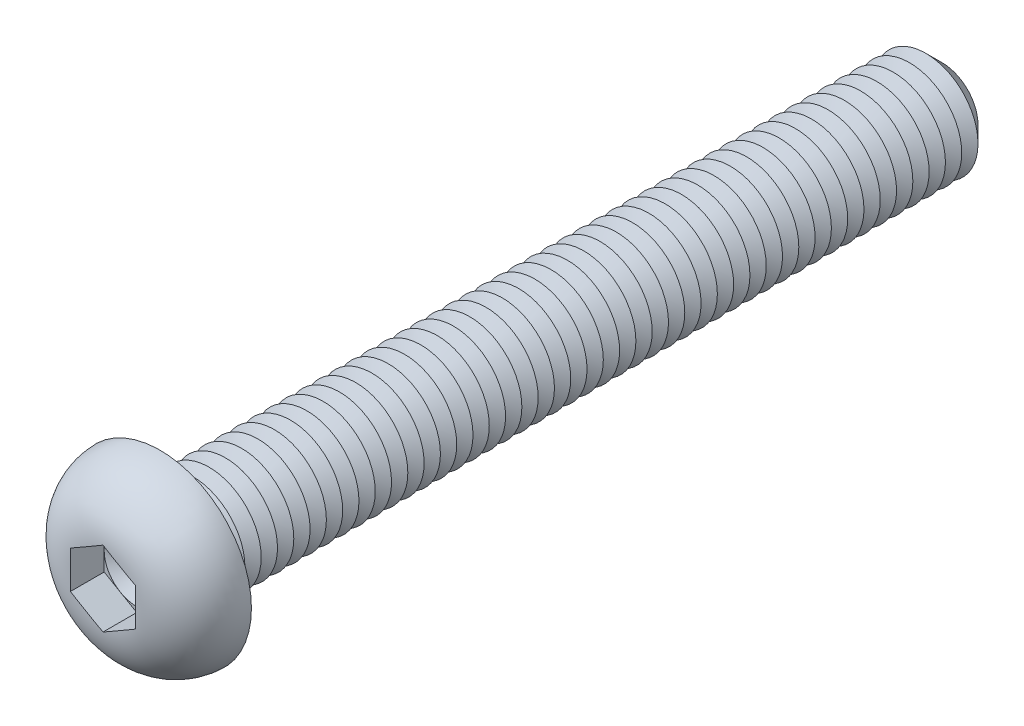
ISO-10303-21;
HEADER;
FILE_DESCRIPTION(('STEP AP214'),'2;1');
FILE_NAME('part.step','',(''),(''),'','','');
FILE_SCHEMA(('AUTOMOTIVE_DESIGN { 1 0 10303 214 1 1 1 1 }'));
ENDSEC;
DATA;
#1=APPLICATION_CONTEXT('core data for automotive mechanical design processes');
#2=APPLICATION_PROTOCOL_DEFINITION('international standard','automotive_design',2000,#1);
#3=PRODUCT_CONTEXT('',#1,'mechanical');
#4=PRODUCT('Part','Part','',(#3));
#5=PRODUCT_RELATED_PRODUCT_CATEGORY('part','',(#4));
#6=PRODUCT_DEFINITION_FORMATION('','',#4);
#7=PRODUCT_DEFINITION_CONTEXT('part definition',#1,'design');
#8=PRODUCT_DEFINITION('design','',#6,#7);
#9=PRODUCT_DEFINITION_SHAPE('','',#8);
#10=(LENGTH_UNIT() NAMED_UNIT(*) SI_UNIT(.MILLI.,.METRE.));
#11=(NAMED_UNIT(*) PLANE_ANGLE_UNIT() SI_UNIT($,.RADIAN.));
#12=(NAMED_UNIT(*) SI_UNIT($,.STERADIAN.) SOLID_ANGLE_UNIT());
#13=UNCERTAINTY_MEASURE_WITH_UNIT(LENGTH_MEASURE(1.E-05),#10,'distance_accuracy_value','');
#14=(GEOMETRIC_REPRESENTATION_CONTEXT(3) GLOBAL_UNCERTAINTY_ASSIGNED_CONTEXT((#13)) GLOBAL_UNIT_ASSIGNED_CONTEXT((#10,
#11,#12)) REPRESENTATION_CONTEXT('',''));
#15=CARTESIAN_POINT('',(0.,0.,0.));
#16=DIRECTION('',(0.,0.,1.));
#17=DIRECTION('',(1.,0.,0.));
#18=AXIS2_PLACEMENT_3D('',#15,#16,#17);
#19=CARTESIAN_POINT('',(0.,0.,1.8));
#20=DIRECTION('',(0.,0.,1.));
#21=DIRECTION('',(1.,0.,0.));
#22=AXIS2_PLACEMENT_3D('',#19,#20,#21);
#23=PLANE('',#22);
#24=CARTESIAN_POINT('',(0.,0.,1.8));
#25=DIRECTION('',(0.,0.,1.));
#26=DIRECTION('',(1.,0.,0.));
#27=AXIS2_PLACEMENT_3D('',#24,#25,#26);
#28=CIRCLE('',#27,2.5);
#29=CARTESIAN_POINT('',(2.5,0.,1.8));
#30=VERTEX_POINT('',#29);
#31=CARTESIAN_POINT('',(1.25,2.1650635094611,1.8));
#32=VERTEX_POINT('',#31);
#33=EDGE_CURVE('E153',#30,#32,#28,.T.);
#34=ORIENTED_EDGE('',*,*,#33,.F.);
#35=DIRECTION('',(0.,1.,0.));
#36=VECTOR('',#35,1.);
#37=CARTESIAN_POINT('',(2.5,-1.44337567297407,1.8));
#38=LINE('',#37,#36);
#39=CARTESIAN_POINT('',(2.5,1.44337567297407,1.8));
#40=VERTEX_POINT('',#39);
#41=EDGE_CURVE('E176',#30,#40,#38,.T.);
#42=ORIENTED_EDGE('',*,*,#41,.T.);
#43=DIRECTION('',(-0.866025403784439,0.5,0.));
#44=VECTOR('',#43,1.);
#45=CARTESIAN_POINT('',(2.5,1.44337567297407,1.8));
#46=LINE('',#45,#44);
#47=EDGE_CURVE('E172',#40,#32,#46,.T.);
#48=ORIENTED_EDGE('',*,*,#47,.T.);
#49=EDGE_LOOP('',(#34,#42,#48));
#50=FACE_BOUND('',#49,.T.);
#51=ADVANCED_FACE('F39',(#50),#23,.T.);
#52=CARTESIAN_POINT('',(0.,0.,1.8));
#53=DIRECTION('',(0.,0.,1.));
#54=DIRECTION('',(1.,0.,0.));
#55=AXIS2_PLACEMENT_3D('',#52,#53,#54);
#56=CIRCLE('',#55,2.5);
#57=CARTESIAN_POINT('',(-1.25,2.1650635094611,1.8));
#58=VERTEX_POINT('',#57);
#59=EDGE_CURVE('E11',#32,#58,#56,.T.);
#60=ORIENTED_EDGE('',*,*,#59,.F.);
#61=CARTESIAN_POINT('',(0.,2.88675134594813,1.8));
#62=VERTEX_POINT('',#61);
#63=EDGE_CURVE('E166',#32,#62,#46,.T.);
#64=ORIENTED_EDGE('',*,*,#63,.T.);
#65=DIRECTION('',(-0.866025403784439,-0.5,0.));
#66=VECTOR('',#65,1.);
#67=CARTESIAN_POINT('',(0.,2.88675134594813,1.8));
#68=LINE('',#67,#66);
#69=EDGE_CURVE('E167',#62,#58,#68,.T.);
#70=ORIENTED_EDGE('',*,*,#69,.T.);
#71=EDGE_LOOP('',(#60,#64,#70));
#72=FACE_BOUND('',#71,.T.);
#73=ADVANCED_FACE('F165',(#72),#23,.T.);
#74=CARTESIAN_POINT('',(-2.5,0.,1.8));
#75=VERTEX_POINT('',#74);
#76=EDGE_CURVE('E49',#58,#75,#56,.T.);
#77=ORIENTED_EDGE('',*,*,#76,.F.);
#78=CARTESIAN_POINT('',(-2.5,1.44337567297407,1.8));
#79=VERTEX_POINT('',#78);
#80=EDGE_CURVE('E179',#58,#79,#68,.T.);
#81=ORIENTED_EDGE('',*,*,#80,.T.);
#82=DIRECTION('',(0.,-1.,0.));
#83=VECTOR('',#82,1.);
#84=CARTESIAN_POINT('',(-2.5,1.44337567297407,1.8));
#85=LINE('',#84,#83);
#86=EDGE_CURVE('E189',#79,#75,#85,.T.);
#87=ORIENTED_EDGE('',*,*,#86,.T.);
#88=EDGE_LOOP('',(#77,#81,#87));
#89=FACE_BOUND('',#88,.T.);
#90=ADVANCED_FACE('F438',(#89),#23,.T.);
#91=CARTESIAN_POINT('',(-1.25,-2.1650635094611,1.8));
#92=VERTEX_POINT('',#91);
#93=EDGE_CURVE('E422',#75,#92,#56,.T.);
#94=ORIENTED_EDGE('',*,*,#93,.F.);
#95=CARTESIAN_POINT('',(-2.5,-1.44337567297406,1.8));
#96=VERTEX_POINT('',#95);
#97=EDGE_CURVE('E188',#75,#96,#85,.T.);
#98=ORIENTED_EDGE('',*,*,#97,.T.);
#99=DIRECTION('',(0.866025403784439,-0.5,0.));
#100=VECTOR('',#99,1.);
#101=CARTESIAN_POINT('',(-2.5,-1.44337567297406,1.8));
#102=LINE('',#101,#100);
#103=EDGE_CURVE('E194',#96,#92,#102,.T.);
#104=ORIENTED_EDGE('',*,*,#103,.T.);
#105=EDGE_LOOP('',(#94,#98,#104));
#106=FACE_BOUND('',#105,.T.);
#107=ADVANCED_FACE('F432',(#106),#23,.T.);
#108=CARTESIAN_POINT('',(1.25,-2.1650635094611,1.8));
#109=VERTEX_POINT('',#108);
#110=EDGE_CURVE('E56',#92,#109,#56,.T.);
#111=ORIENTED_EDGE('',*,*,#110,.F.);
#112=CARTESIAN_POINT('',(0.,-2.88675134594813,1.8));
#113=VERTEX_POINT('',#112);
#114=EDGE_CURVE('E193',#92,#113,#102,.T.);
#115=ORIENTED_EDGE('',*,*,#114,.T.);
#116=DIRECTION('',(0.866025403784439,0.5,0.));
#117=VECTOR('',#116,1.);
#118=CARTESIAN_POINT('',(0.,-2.88675134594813,1.8));
#119=LINE('',#118,#117);
#120=EDGE_CURVE('E199',#113,#109,#119,.T.);
#121=ORIENTED_EDGE('',*,*,#120,.T.);
#122=EDGE_LOOP('',(#111,#115,#121));
#123=FACE_BOUND('',#122,.T.);
#124=ADVANCED_FACE('F472',(#123),#23,.T.);
#125=CARTESIAN_POINT('',(0.,0.,-60.));
#126=DIRECTION('',(0.,0.,1.));
#127=DIRECTION('',(1.,0.,0.));
#128=AXIS2_PLACEMENT_3D('',#125,#126,#127);
#129=CYLINDRICAL_SURFACE('',#128,4.);
#130=CARTESIAN_POINT('',(0.,0.,-0.5));
#131=DIRECTION('',(0.,0.,1.));
#132=DIRECTION('',(1.,0.,0.));
#133=AXIS2_PLACEMENT_3D('',#130,#131,#132);
#134=CIRCLE('',#133,4.);
#135=CARTESIAN_POINT('',(4.,0.,-0.5));
#136=VERTEX_POINT('',#135);
#137=EDGE_CURVE('E410',#136,#136,#134,.F.);
#138=ORIENTED_EDGE('',*,*,#137,.T.);
#139=EDGE_LOOP('',(#138));
#140=FACE_BOUND('',#139,.T.);
#141=CARTESIAN_POINT('',(0.,0.,-1.25));
#142=DIRECTION('',(0.,0.,1.));
#143=DIRECTION('',(1.,0.,0.));
#144=AXIS2_PLACEMENT_3D('',#141,#142,#143);
#145=CIRCLE('',#144,4.00000000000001);
#146=CARTESIAN_POINT('',(4.00000000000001,0.,-1.25));
#147=VERTEX_POINT('',#146);
#148=EDGE_CURVE('E184',#147,#147,#145,.T.);
#149=ORIENTED_EDGE('',*,*,#148,.T.);
#150=EDGE_LOOP('',(#149));
#151=FACE_BOUND('',#150,.T.);
#152=ADVANCED_FACE('F467',(#140,#151),#129,.T.);
#153=CARTESIAN_POINT('',(0.,7.,0.));
#154=DIRECTION('',(0.,0.,1.));
#155=DIRECTION('',(1.,0.,0.));
#156=AXIS2_PLACEMENT_3D('',#153,#154,#155);
#157=PLANE('',#156);
#158=CARTESIAN_POINT('',(0.,0.,0.));
#159=DIRECTION('',(0.,0.,1.));
#160=DIRECTION('',(1.,0.,0.));
#161=AXIS2_PLACEMENT_3D('',#158,#159,#160);
#162=CIRCLE('',#161,4.5);
#163=CARTESIAN_POINT('',(4.5,0.,0.));
#164=VERTEX_POINT('',#163);
#165=EDGE_CURVE('E413',#164,#164,#162,.T.);
#166=ORIENTED_EDGE('',*,*,#165,.T.);
#167=EDGE_LOOP('',(#166));
#168=FACE_BOUND('',#167,.T.);
#169=CARTESIAN_POINT('',(0.,0.,0.));
#170=DIRECTION('',(0.,0.,1.));
#171=DIRECTION('',(1.,0.,0.));
#172=AXIS2_PLACEMENT_3D('',#169,#170,#171);
#173=CIRCLE('',#172,7.);
#174=CARTESIAN_POINT('',(7.,0.,0.));
#175=VERTEX_POINT('',#174);
#176=EDGE_CURVE('E210',#175,#175,#173,.T.);
#177=ORIENTED_EDGE('',*,*,#176,.F.);
#178=EDGE_LOOP('',(#177));
#179=FACE_BOUND('',#178,.T.);
#180=ADVANCED_FACE('F465',(#168,#179),#157,.F.);
#181=CARTESIAN_POINT('',(0.,0.,-0.1));
#182=DIRECTION('',(0.,0.,1.));
#183=DIRECTION('',(1.,0.,0.));
#184=AXIS2_PLACEMENT_3D('',#181,#182,#183);
#185=DEGENERATE_TOROIDAL_SURFACE('',#184,2.5011112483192,4.5,.T.);
#186=CARTESIAN_POINT('',(1.31456088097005,2.12778926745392,4.4));
#187=DIRECTION('',(-0.866025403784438,0.500000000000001,0.));
#188=VECTOR('',#187,1.);
#189=LINE('',#186,#188);
#190=CARTESIAN_POINT('',(1.31456088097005,2.12778926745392,4.4));
#191=VERTEX_POINT('',#190);
#192=CARTESIAN_POINT('',(1.18543911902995,2.20233775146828,4.4));
#193=VERTEX_POINT('',#192);
#194=EDGE_CURVE('E398',#191,#193,#189,.T.);
#195=ORIENTED_EDGE('',*,*,#194,.F.);
#196=CARTESIAN_POINT('',(-0.000200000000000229,2.88686681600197,4.38343536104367));
#197=CARTESIAN_POINT('',(0.103935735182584,2.82674402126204,4.38859262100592));
#198=CARTESIAN_POINT('',(0.208111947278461,2.76659785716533,4.39207570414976));
#199=CARTESIAN_POINT('',(0.416486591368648,2.64629270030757,4.39683754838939));
#200=CARTESIAN_POINT('',(0.520685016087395,2.58613371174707,4.39811670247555));
#201=CARTESIAN_POINT('',(0.729066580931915,2.46582455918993,4.3996156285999));
#202=CARTESIAN_POINT('',(0.833249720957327,2.40567439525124,4.39983556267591));
#203=CARTESIAN_POINT('',(1.04162190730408,2.2853706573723,4.4000276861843));
#204=CARTESIAN_POINT('',(1.14581095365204,2.2252170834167,4.39999986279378));
#205=CARTESIAN_POINT('',(1.35418904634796,2.10490993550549,4.39999986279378));
#206=CARTESIAN_POINT('',(1.45837809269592,2.04475636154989,4.4000276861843));
#207=CARTESIAN_POINT('',(1.66675027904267,1.92445262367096,4.39983556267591));
#208=CARTESIAN_POINT('',(1.77093341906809,1.86430245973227,4.3996156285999));
#209=CARTESIAN_POINT('',(1.97931498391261,1.74399330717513,4.39811670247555));
#210=CARTESIAN_POINT('',(2.08351340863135,1.68383431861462,4.39683754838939));
#211=CARTESIAN_POINT('',(2.29188805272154,1.56352916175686,4.39207570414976));
#212=CARTESIAN_POINT('',(2.39606426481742,1.50338299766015,4.38859262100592));
#213=CARTESIAN_POINT('',(2.5002,1.44326020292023,4.38343536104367));
#214=B_SPLINE_CURVE_WITH_KNOTS('',3,(#196,#197,#198,#199,#200,#201,#202,#203,#204,#205,#206,
#207,#208,#209,#210,#211,#212,#213),.UNSPECIFIED.,.F.,.F.,(4,2,2,2,2,2,2,2,4),(0.,
0.361022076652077,0.721979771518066,1.08288224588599,1.44380339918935,1.80472455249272,
2.16562702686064,2.52658472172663,2.88760679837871),.UNSPECIFIED.);
#215=CARTESIAN_POINT('',(2.5,1.44337567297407,4.38344529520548));
#216=VERTEX_POINT('',#215);
#217=EDGE_CURVE('E354',#191,#216,#214,.T.);
#218=ORIENTED_EDGE('',*,*,#217,.T.);
#219=CARTESIAN_POINT('',(2.5,0.,4.39999986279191));
#220=CARTESIAN_POINT('',(2.5,-0.104697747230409,4.39999811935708));
#221=CARTESIAN_POINT('',(2.5,-0.209395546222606,4.40001551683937));
#222=CARTESIAN_POINT('',(2.5,-0.418792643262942,4.39990807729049));
#223=CARTESIAN_POINT('',(2.5,-0.52349194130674,4.39978323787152));
#224=CARTESIAN_POINT('',(2.5,-0.732936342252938,4.39891238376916));
#225=CARTESIAN_POINT('',(2.5,-0.837681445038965,4.39816609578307));
#226=CARTESIAN_POINT('',(2.5,-1.04715282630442,4.39536239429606));
#227=CARTESIAN_POINT('',(2.5,-1.15187910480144,4.39330498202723));
#228=CARTESIAN_POINT('',(2.5,-1.46476484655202,4.38400647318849));
#229=CARTESIAN_POINT('',(2.5,-1.67286375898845,4.37365196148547));
#230=CARTESIAN_POINT('',(2.5,-2.08783281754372,4.33852954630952));
#231=CARTESIAN_POINT('',(2.5,-2.29470379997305,4.31377296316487));
#232=CARTESIAN_POINT('',(2.5,-2.64451002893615,4.25536510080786));
#233=CARTESIAN_POINT('',(2.5,-2.78823975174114,4.22651785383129));
#234=CARTESIAN_POINT('',(2.5,-3.073224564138,4.15827060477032));
#235=CARTESIAN_POINT('',(2.5,-3.21447933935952,4.11886927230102));
#236=CARTESIAN_POINT('',(2.5,-3.49353952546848,4.02870287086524));
#237=CARTESIAN_POINT('',(2.5,-3.6313402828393,3.97792330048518));
#238=CARTESIAN_POINT('',(2.5,-3.90204977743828,3.86463774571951));
#239=CARTESIAN_POINT('',(2.5,-4.0349587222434,3.8021322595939));
#240=CARTESIAN_POINT('',(2.5,-4.2956525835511,3.66474880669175));
#241=CARTESIAN_POINT('',(2.5,-4.42338586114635,3.58977252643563));
#242=CARTESIAN_POINT('',(2.5,-4.67118559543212,3.42803136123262));
#243=CARTESIAN_POINT('',(2.5,-4.79125159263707,3.3412657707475));
#244=CARTESIAN_POINT('',(2.5,-5.02233156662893,3.15645800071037));
#245=CARTESIAN_POINT('',(2.5,-5.13334771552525,3.05841854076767));
#246=CARTESIAN_POINT('',(2.5,-5.34506083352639,2.85177471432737));
#247=CARTESIAN_POINT('',(2.5,-5.44575933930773,2.74317192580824));
#248=CARTESIAN_POINT('',(2.5,-5.62335564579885,2.53102225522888));
#249=CARTESIAN_POINT('',(2.5,-5.70164721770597,2.42863868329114));
#250=CARTESIAN_POINT('',(2.5,-5.84882394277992,2.21725758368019));
#251=CARTESIAN_POINT('',(2.5,-5.91770588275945,2.10825781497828));
#252=CARTESIAN_POINT('',(2.5,-6.04532926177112,1.88460009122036));
#253=CARTESIAN_POINT('',(2.5,-6.1040794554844,1.76994713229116));
#254=CARTESIAN_POINT('',(2.5,-6.21098181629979,1.53574793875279));
#255=CARTESIAN_POINT('',(2.5,-6.25913021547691,1.41619998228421));
#256=CARTESIAN_POINT('',(2.5,-6.34173830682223,1.18065209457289));
#257=CARTESIAN_POINT('',(2.5,-6.37685491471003,1.06488207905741));
#258=CARTESIAN_POINT('',(2.5,-6.43703913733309,0.830714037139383));
#259=CARTESIAN_POINT('',(2.5,-6.46210319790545,0.712315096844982));
#260=CARTESIAN_POINT('',(2.5,-6.50194044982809,0.473848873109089));
#261=CARTESIAN_POINT('',(2.5,-6.51671856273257,0.353782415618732));
#262=CARTESIAN_POINT('',(2.5,-6.53588982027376,0.112808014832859));
#263=CARTESIAN_POINT('',(2.5,-6.54027911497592,-0.00810022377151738));
#264=CARTESIAN_POINT('',(2.5,-6.53779027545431,-0.365870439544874));
#265=CARTESIAN_POINT('',(2.5,-6.51607942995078,-0.602790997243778));
#266=CARTESIAN_POINT('',(2.5,-6.43310265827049,-1.06957107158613));
#267=CARTESIAN_POINT('',(2.5,-6.3718398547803,-1.29943114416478));
#268=CARTESIAN_POINT('',(2.5,-6.25195024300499,-1.63390601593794));
#269=CARTESIAN_POINT('',(2.5,-6.20730237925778,-1.74371189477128));
#270=CARTESIAN_POINT('',(2.5,-6.10902350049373,-1.95921136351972));
#271=CARTESIAN_POINT('',(2.5,-6.05539567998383,-2.06490639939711));
#272=CARTESIAN_POINT('',(2.5,-5.93955620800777,-2.27152527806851));
#273=CARTESIAN_POINT('',(2.5,-5.87734126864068,-2.37244727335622));
#274=CARTESIAN_POINT('',(2.5,-5.7448545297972,-2.56880727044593));
#275=CARTESIAN_POINT('',(2.5,-5.67458537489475,-2.6642470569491));
#276=CARTESIAN_POINT('',(2.5,-5.52523018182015,-2.85070592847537));
#277=CARTESIAN_POINT('',(2.5,-5.44601185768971,-2.94161901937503));
#278=CARTESIAN_POINT('',(2.5,-5.28044044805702,-3.11663859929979));
#279=CARTESIAN_POINT('',(2.5,-5.194089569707,-3.2007471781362));
#280=CARTESIAN_POINT('',(2.5,-5.01485870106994,-3.36178408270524));
#281=CARTESIAN_POINT('',(2.5,-4.92197538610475,-3.43870870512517));
#282=CARTESIAN_POINT('',(2.5,-4.73045535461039,-3.58495812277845));
#283=CARTESIAN_POINT('',(2.5,-4.6318202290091,-3.65428500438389));
#284=CARTESIAN_POINT('',(2.5,-4.4247626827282,-3.78818551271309));
#285=CARTESIAN_POINT('',(2.5,-4.31609824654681,-3.85238474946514));
#286=CARTESIAN_POINT('',(2.5,-4.0940582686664,-3.97208975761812));
#287=CARTESIAN_POINT('',(2.5,-3.98068153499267,-4.02759331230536));
#288=CARTESIAN_POINT('',(2.5,-3.75029026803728,-4.12981004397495));
#289=CARTESIAN_POINT('',(2.5,-3.63328275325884,-4.17653908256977));
#290=CARTESIAN_POINT('',(2.5,-3.39631992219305,-4.2614893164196));
#291=CARTESIAN_POINT('',(2.5,-3.27636651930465,-4.29971587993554));
#292=CARTESIAN_POINT('',(2.5,-3.00446622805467,-4.37644925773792));
#293=CARTESIAN_POINT('',(2.5,-2.85188931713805,-4.41272455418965));
#294=CARTESIAN_POINT('',(2.5,-2.54443794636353,-4.47385449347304));
#295=CARTESIAN_POINT('',(2.5,-2.3895624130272,-4.49870361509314));
#296=CARTESIAN_POINT('',(2.5,-2.07807451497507,-4.53870829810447));
#297=CARTESIAN_POINT('',(2.5,-1.92145805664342,-4.55383091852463));
#298=CARTESIAN_POINT('',(2.5,-1.60772330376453,-4.57647936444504));
#299=CARTESIAN_POINT('',(2.5,-1.45060502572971,-4.58400543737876));
#300=CARTESIAN_POINT('',(2.5,-1.13432460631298,-4.59416656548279));
#301=CARTESIAN_POINT('',(2.5,-0.975160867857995,-4.59674096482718));
#302=CARTESIAN_POINT('',(2.5,-0.656826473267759,-4.59957813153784));
#303=CARTESIAN_POINT('',(2.5,-0.497655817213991,-4.59984092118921));
#304=CARTESIAN_POINT('',(2.5,-0.179547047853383,-4.60005428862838));
#305=CARTESIAN_POINT('',(2.5,-0.02060893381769,-4.60000532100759));
#306=CARTESIAN_POINT('',(2.5,0.297265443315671,-4.59999304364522));
#307=CARTESIAN_POINT('',(2.5,0.456201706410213,-4.60002973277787));
#308=CARTESIAN_POINT('',(2.5,0.70967559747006,-4.59902611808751));
#309=CARTESIAN_POINT('',(2.5,0.804213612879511,-4.59841616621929));
#310=CARTESIAN_POINT('',(2.5,0.99327694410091,-4.59620676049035));
#311=CARTESIAN_POINT('',(2.5,1.08780225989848,-4.59460730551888));
#312=CARTESIAN_POINT('',(2.5,1.37137837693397,-4.58746770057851));
#313=CARTESIAN_POINT('',(2.5,1.56039301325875,-4.57958602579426));
#314=CARTESIAN_POINT('',(2.5,1.93609462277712,-4.55305686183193));
#315=CARTESIAN_POINT('',(2.5,2.12278756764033,-4.53450331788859));
#316=CARTESIAN_POINT('',(2.5,2.49421016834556,-4.48296248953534));
#317=CARTESIAN_POINT('',(2.5,2.67894050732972,-4.44998040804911));
#318=CARTESIAN_POINT('',(2.5,2.99962701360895,-4.37718406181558));
#319=CARTESIAN_POINT('',(2.5,3.13641465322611,-4.34103978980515));
#320=CARTESIAN_POINT('',(2.5,3.40682838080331,-4.25834226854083));
#321=CARTESIAN_POINT('',(2.5,3.54045461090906,-4.21178948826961));
#322=CARTESIAN_POINT('',(2.5,3.80387940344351,-4.1076796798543));
#323=CARTESIAN_POINT('',(2.5,3.93366385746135,-4.05008679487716));
#324=CARTESIAN_POINT('',(2.5,4.18776789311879,-3.92385886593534));
#325=CARTESIAN_POINT('',(2.5,4.31208736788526,-3.85522360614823));
#326=CARTESIAN_POINT('',(2.5,4.55475418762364,-3.70660227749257));
#327=CARTESIAN_POINT('',(2.5,4.67306276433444,-3.62655275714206));
#328=CARTESIAN_POINT('',(2.5,4.90171316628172,-3.45576294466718));
#329=CARTESIAN_POINT('',(2.5,5.01205476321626,-3.36502234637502));
#330=CARTESIAN_POINT('',(2.5,5.22347091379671,-3.17353376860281));
#331=CARTESIAN_POINT('',(2.5,5.32455555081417,-3.07279693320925));
#332=CARTESIAN_POINT('',(2.5,5.51647993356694,-2.86200023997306));
#333=CARTESIAN_POINT('',(2.5,5.6073208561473,-2.75194145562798));
#334=CARTESIAN_POINT('',(2.5,5.76832451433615,-2.53607083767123));
#335=CARTESIAN_POINT('',(2.5,5.83966300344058,-2.4311337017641));
#336=CARTESIAN_POINT('',(2.5,5.97282702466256,-2.2153291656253));
#337=CARTESIAN_POINT('',(2.5,6.03464926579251,-2.10445973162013));
#338=CARTESIAN_POINT('',(2.5,6.14815657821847,-1.87771731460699));
#339=CARTESIAN_POINT('',(2.5,6.19984675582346,-1.76184688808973));
#340=CARTESIAN_POINT('',(2.5,6.29267395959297,-1.52590109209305));
#341=CARTESIAN_POINT('',(2.5,6.33380720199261,-1.40582423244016));
#342=CARTESIAN_POINT('',(2.5,6.40328888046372,-1.16869740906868));
#343=CARTESIAN_POINT('',(2.5,6.43218419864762,-1.05180738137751));
#344=CARTESIAN_POINT('',(2.5,6.47988151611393,-0.815941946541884));
#345=CARTESIAN_POINT('',(2.5,6.49867991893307,-0.696965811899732));
#346=CARTESIAN_POINT('',(2.5,6.52599950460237,-0.457898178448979));
#347=CARTESIAN_POINT('',(2.5,6.53452634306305,-0.337807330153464));
#348=CARTESIAN_POINT('',(2.5,6.54126106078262,-0.0973214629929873));
#349=CARTESIAN_POINT('',(2.5,6.5394651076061,0.023073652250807));
#350=CARTESIAN_POINT('',(2.5,6.51879545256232,0.379398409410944));
#351=CARTESIAN_POINT('',(2.5,6.48510560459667,0.614630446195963));
#352=CARTESIAN_POINT('',(2.5,6.37872360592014,1.07608887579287));
#353=CARTESIAN_POINT('',(2.5,6.30603128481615,1.3023152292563));
#354=CARTESIAN_POINT('',(2.5,6.16957161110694,1.63028303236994));
#355=CARTESIAN_POINT('',(2.5,6.11941470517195,1.7378698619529));
#356=CARTESIAN_POINT('',(2.5,6.01034124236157,1.94849153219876));
#357=CARTESIAN_POINT('',(2.5,5.9514277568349,2.05152795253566));
#358=CARTESIAN_POINT('',(2.5,5.82528890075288,2.25240256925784));
#359=CARTESIAN_POINT('',(2.5,5.75806159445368,2.35023954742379));
#360=CARTESIAN_POINT('',(2.5,5.61585543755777,2.54005689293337));
#361=CARTESIAN_POINT('',(2.5,5.54087908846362,2.63203913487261));
#362=CARTESIAN_POINT('',(2.5,5.38212190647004,2.81146438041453));
#363=CARTESIAN_POINT('',(2.5,5.29819182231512,2.89877528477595));
#364=CARTESIAN_POINT('',(2.5,5.12353712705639,3.06625194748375));
#365=CARTESIAN_POINT('',(2.5,5.03281455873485,3.14641983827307));
#366=CARTESIAN_POINT('',(2.5,4.84518171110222,3.29930665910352));
#367=CARTESIAN_POINT('',(2.5,4.74826657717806,3.37201962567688));
#368=CARTESIAN_POINT('',(2.5,4.54907485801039,3.50961479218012));
#369=CARTESIAN_POINT('',(2.5,4.44679969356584,3.57449905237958));
#370=CARTESIAN_POINT('',(2.5,4.23202545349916,3.69953578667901));
#371=CARTESIAN_POINT('',(2.5,4.11927203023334,3.75925114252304));
#372=CARTESIAN_POINT('',(2.5,3.88947986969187,3.86977617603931));
#373=CARTESIAN_POINT('',(2.5,3.77244067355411,3.92058489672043));
#374=CARTESIAN_POINT('',(2.5,3.5351804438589,4.0133148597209));
#375=CARTESIAN_POINT('',(2.5,3.41496637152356,4.0552539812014));
#376=CARTESIAN_POINT('',(2.5,3.17195278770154,4.13067246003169));
#377=CARTESIAN_POINT('',(2.5,3.04915378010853,4.16415344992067));
#378=CARTESIAN_POINT('',(2.5,2.80683027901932,4.22194717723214));
#379=CARTESIAN_POINT('',(2.5,2.68738216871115,4.2465834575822));
#380=CARTESIAN_POINT('',(2.5,2.44729214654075,4.28920746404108));
#381=CARTESIAN_POINT('',(2.5,2.32664997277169,4.30719369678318));
#382=CARTESIAN_POINT('',(2.5,2.08450864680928,4.33736171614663));
#383=CARTESIAN_POINT('',(2.5,1.9630086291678,4.3495363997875));
#384=CARTESIAN_POINT('',(2.5,1.71961501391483,4.36908103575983));
#385=CARTESIAN_POINT('',(2.5,1.59772134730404,4.37645009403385));
#386=CARTESIAN_POINT('',(2.5,1.35283283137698,4.38761579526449));
#387=CARTESIAN_POINT('',(2.5,1.22983679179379,4.39138420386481));
#388=CARTESIAN_POINT('',(2.5,0.983808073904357,4.3965493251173));
#389=CARTESIAN_POINT('',(2.5,0.860775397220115,4.3979461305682));
#390=CARTESIAN_POINT('',(2.5,0.614783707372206,4.39958107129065));
#391=CARTESIAN_POINT('',(2.5,0.491824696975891,4.3998199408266));
#392=CARTESIAN_POINT('',(2.5,0.245910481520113,4.40003035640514));
#393=CARTESIAN_POINT('',(2.5,0.122955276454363,4.4000019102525));
#394=CARTESIAN_POINT('',(2.5,0.,4.39999986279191));
#395=B_SPLINE_CURVE_WITH_KNOTS('',3,(#219,#220,#221,#222,#223,#224,#225,#226,#227,#228,#229,
#230,#231,#232,#233,#234,#235,#236,#237,#238,#239,#240,#241,#242,#243,#244,#245,#246,#247,#248,
#249,#250,#251,#252,#253,#254,#255,#256,#257,#258,#259,#260,#261,#262,#263,#264,#265,#266,#267,
#268,#269,#270,#271,#272,#273,#274,#275,#276,#277,#278,#279,#280,#281,#282,#283,#284,#285,#286,
#287,#288,#289,#290,#291,#292,#293,#294,#295,#296,#297,#298,#299,#300,#301,#302,#303,#304,#305,
#306,#307,#308,#309,#310,#311,#312,#313,#314,#315,#316,#317,#318,#319,#320,#321,#322,#323,#324,
#325,#326,#327,#328,#329,#330,#331,#332,#333,#334,#335,#336,#337,#338,#339,#340,#341,#342,#343,
#344,#345,#346,#347,#348,#349,#350,#351,#352,#353,#354,#355,#356,#357,#358,#359,#360,#361,#362,
#363,#364,#365,#366,#367,#368,#369,#370,#371,#372,#373,#374,#375,#376,#377,#378,#379,#380,#381,
#382,#383,#384,#385,#386,#387,#388,#389,#390,#391,#392,#393,#394),.UNSPECIFIED.,.T.,.F.,(4,2,2,
2,2,2,2,2,2,2,2,2,2,2,2,2,2,2,2,2,2,2,2,2,2,2,2,2,2,2,2,2,2,2,2,2,2,2,2,2,2,2,2,2,2,2,2,2,2,2,2,
2,2,2,2,2,2,2,2,2,2,2,2,2,2,2,2,2,2,2,2,2,2,2,2,2,2,2,2,2,2,2,2,2,2,2,2,4),(0.,
0.314093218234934,0.62819170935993,0.942428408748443,1.25666481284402,1.88144147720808,
2.50572771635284,2.94516878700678,3.38466527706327,3.82472511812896,4.26476626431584,
4.70845695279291,5.15217420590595,5.59578464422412,6.03932891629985,6.42549664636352,
6.81179591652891,7.19775970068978,7.58386043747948,7.94635637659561,8.30898036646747,
8.67143073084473,9.03401539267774,9.74414367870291,10.4542159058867,10.8094792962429,
11.1646165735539,11.5198902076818,11.8750475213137,12.2363927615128,12.597626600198,
12.9590456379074,13.3203651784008,13.698597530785,14.0769261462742,14.4545641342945,
14.8319630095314,15.3019396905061,15.7721432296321,16.2439309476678,16.715703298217,
17.1932187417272,17.6707295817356,18.1475442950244,18.6243527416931,18.9079682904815,
19.1915841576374,19.7589248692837,20.3213460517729,20.8835645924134,21.3076400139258,
21.731696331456,22.1571540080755,22.5826200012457,23.0105507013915,23.4384936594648,
23.8659647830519,24.2933867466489,24.6735755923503,25.0538956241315,25.4340234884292,
25.8142874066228,26.1750761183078,26.5359932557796,26.8967115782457,27.2575638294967,
27.9668653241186,28.6761699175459,29.0319382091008,29.3875820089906,29.7433087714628,
30.0989210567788,30.4618400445,30.8246503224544,31.1877485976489,31.5507511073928,
31.9331198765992,32.3155297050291,32.6971611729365,33.0787189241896,33.4443988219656,
33.8101607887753,34.1763686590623,34.54264464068,34.9117697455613,35.2808804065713,
35.6497569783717,36.0186227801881),.UNSPECIFIED.);
#396=CARTESIAN_POINT('',(2.5,0.0745484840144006,4.4));
#397=VERTEX_POINT('',#396);
#398=EDGE_CURVE('E344',#216,#397,#395,.T.);
#399=ORIENTED_EDGE('',*,*,#398,.T.);
#400=CARTESIAN_POINT('',(2.5,-0.0745484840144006,4.4));
#401=DIRECTION('',(0.,1.,0.));
#402=VECTOR('',#401,1.);
#403=LINE('',#400,#402);
#404=CARTESIAN_POINT('',(2.5,-0.0745484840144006,4.4));
#405=VERTEX_POINT('',#404);
#406=EDGE_CURVE('E174',#405,#397,#403,.T.);
#407=ORIENTED_EDGE('',*,*,#406,.F.);
#408=CARTESIAN_POINT('',(2.5,-1.44337567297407,4.38344529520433));
#409=VERTEX_POINT('',#408);
#410=EDGE_CURVE('E355',#405,#409,#395,.T.);
#411=ORIENTED_EDGE('',*,*,#410,.T.);
#412=CARTESIAN_POINT('',(2.5002,-1.44326020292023,4.38343536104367));
#413=CARTESIAN_POINT('',(2.39606426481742,-1.50338299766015,4.38859262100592));
#414=CARTESIAN_POINT('',(2.29188805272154,-1.56352916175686,4.39207570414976));
#415=CARTESIAN_POINT('',(2.08351340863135,-1.68383431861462,4.39683754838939));
#416=CARTESIAN_POINT('',(1.9793149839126,-1.74399330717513,4.39811670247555));
#417=CARTESIAN_POINT('',(1.77093341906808,-1.86430245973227,4.3996156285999));
#418=CARTESIAN_POINT('',(1.66675027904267,-1.92445262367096,4.39983556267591));
#419=CARTESIAN_POINT('',(1.45837809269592,-2.04475636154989,4.4000276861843));
#420=CARTESIAN_POINT('',(1.35418904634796,-2.10490993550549,4.39999986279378));
#421=CARTESIAN_POINT('',(1.14581095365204,-2.2252170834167,4.39999986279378));
#422=CARTESIAN_POINT('',(1.04162190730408,-2.2853706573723,4.4000276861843));
#423=CARTESIAN_POINT('',(0.833249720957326,-2.40567439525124,4.39983556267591));
#424=CARTESIAN_POINT('',(0.729066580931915,-2.46582455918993,4.3996156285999));
#425=CARTESIAN_POINT('',(0.520685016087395,-2.58613371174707,4.39811670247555));
#426=CARTESIAN_POINT('',(0.416486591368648,-2.64629270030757,4.39683754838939));
#427=CARTESIAN_POINT('',(0.208111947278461,-2.76659785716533,4.39207570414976));
#428=CARTESIAN_POINT('',(0.103935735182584,-2.82674402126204,4.38859262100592));
#429=CARTESIAN_POINT('',(-0.000200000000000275,-2.88686681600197,4.38343536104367));
#430=B_SPLINE_CURVE_WITH_KNOTS('',3,(#412,#413,#414,#415,#416,#417,#418,#419,#420,#421,#422,
#423,#424,#425,#426,#427,#428,#429),.UNSPECIFIED.,.F.,.F.,(4,2,2,2,2,2,2,2,4),(0.,
0.361022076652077,0.721979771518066,1.08288224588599,1.44380339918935,1.80472455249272,
2.16562702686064,2.52658472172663,2.88760679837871),.UNSPECIFIED.);
#431=CARTESIAN_POINT('',(1.31456088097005,-2.12778926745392,4.4));
#432=VERTEX_POINT('',#431);
#433=EDGE_CURVE('E331',#409,#432,#430,.T.);
#434=ORIENTED_EDGE('',*,*,#433,.T.);
#435=CARTESIAN_POINT('',(1.18543911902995,-2.20233775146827,4.4));
#436=DIRECTION('',(0.866025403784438,0.500000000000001,0.));
#437=VECTOR('',#436,1.);
#438=LINE('',#435,#437);
#439=CARTESIAN_POINT('',(1.18543911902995,-2.20233775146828,4.4));
#440=VERTEX_POINT('',#439);
#441=EDGE_CURVE('E340',#440,#432,#438,.T.);
#442=ORIENTED_EDGE('',*,*,#441,.F.);
#443=CARTESIAN_POINT('',(0.,-2.88675134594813,4.38344529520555));
#444=VERTEX_POINT('',#443);
#445=EDGE_CURVE('E294',#440,#444,#430,.T.);
#446=ORIENTED_EDGE('',*,*,#445,.T.);
#447=CARTESIAN_POINT('',(0.00019999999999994,-2.88686681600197,4.38343536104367));
#448=CARTESIAN_POINT('',(-0.103935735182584,-2.82674402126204,4.38859262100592));
#449=CARTESIAN_POINT('',(-0.208111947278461,-2.76659785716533,4.39207570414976));
#450=CARTESIAN_POINT('',(-0.416486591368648,-2.64629270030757,4.39683754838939));
#451=CARTESIAN_POINT('',(-0.520685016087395,-2.58613371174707,4.39811670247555));
#452=CARTESIAN_POINT('',(-0.729066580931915,-2.46582455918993,4.3996156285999));
#453=CARTESIAN_POINT('',(-0.833249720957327,-2.40567439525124,4.39983556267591));
#454=CARTESIAN_POINT('',(-1.04162190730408,-2.2853706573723,4.4000276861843));
#455=CARTESIAN_POINT('',(-1.14581095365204,-2.2252170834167,4.39999986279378));
#456=CARTESIAN_POINT('',(-1.35418904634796,-2.10490993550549,4.39999986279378));
#457=CARTESIAN_POINT('',(-1.45837809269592,-2.04475636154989,4.4000276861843));
#458=CARTESIAN_POINT('',(-1.66675027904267,-1.92445262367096,4.39983556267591));
#459=CARTESIAN_POINT('',(-1.77093341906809,-1.86430245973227,4.3996156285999));
#460=CARTESIAN_POINT('',(-1.97931498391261,-1.74399330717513,4.39811670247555));
#461=CARTESIAN_POINT('',(-2.08351340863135,-1.68383431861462,4.39683754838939));
#462=CARTESIAN_POINT('',(-2.29188805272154,-1.56352916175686,4.39207570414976));
#463=CARTESIAN_POINT('',(-2.39606426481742,-1.50338299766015,4.38859262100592));
#464=CARTESIAN_POINT('',(-2.5002,-1.44326020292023,4.38343536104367));
#465=B_SPLINE_CURVE_WITH_KNOTS('',3,(#447,#448,#449,#450,#451,#452,#453,#454,#455,#456,#457,
#458,#459,#460,#461,#462,#463,#464),.UNSPECIFIED.,.F.,.F.,(4,2,2,2,2,2,2,2,4),(0.,
0.361022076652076,0.721979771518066,1.08288224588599,1.44380339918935,1.80472455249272,
2.16562702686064,2.52658472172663,2.88760679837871),.UNSPECIFIED.);
#466=CARTESIAN_POINT('',(-1.18543911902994,-2.20233775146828,4.4));
#467=VERTEX_POINT('',#466);
#468=EDGE_CURVE('E284',#444,#467,#465,.T.);
#469=ORIENTED_EDGE('',*,*,#468,.T.);
#470=CARTESIAN_POINT('',(-1.31456088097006,-2.12778926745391,4.4));
#471=DIRECTION('',(0.86602540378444,-0.499999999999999,0.));
#472=VECTOR('',#471,1.);
#473=LINE('',#470,#472);
#474=CARTESIAN_POINT('',(-1.31456088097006,-2.12778926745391,4.4));
#475=VERTEX_POINT('',#474);
#476=EDGE_CURVE('E622',#475,#467,#473,.T.);
#477=ORIENTED_EDGE('',*,*,#476,.F.);
#478=CARTESIAN_POINT('',(-2.5,-1.44337567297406,4.38344529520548));
#479=VERTEX_POINT('',#478);
#480=EDGE_CURVE('E295',#475,#479,#465,.T.);
#481=ORIENTED_EDGE('',*,*,#480,.T.);
#482=CARTESIAN_POINT('',(-2.5,0.,4.39999986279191));
#483=CARTESIAN_POINT('',(-2.5,0.104697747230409,4.39999811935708));
#484=CARTESIAN_POINT('',(-2.5,0.209395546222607,4.40001551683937));
#485=CARTESIAN_POINT('',(-2.5,0.418792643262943,4.39990807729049));
#486=CARTESIAN_POINT('',(-2.5,0.523491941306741,4.39978323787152));
#487=CARTESIAN_POINT('',(-2.5,0.732936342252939,4.39891238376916));
#488=CARTESIAN_POINT('',(-2.5,0.837681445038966,4.39816609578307));
#489=CARTESIAN_POINT('',(-2.5,1.04715282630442,4.39536239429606));
#490=CARTESIAN_POINT('',(-2.5,1.15187910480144,4.39330498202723));
#491=CARTESIAN_POINT('',(-2.5,1.46476484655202,4.38400647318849));
#492=CARTESIAN_POINT('',(-2.5,1.67286375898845,4.37365196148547));
#493=CARTESIAN_POINT('',(-2.5,2.08783281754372,4.33852954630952));
#494=CARTESIAN_POINT('',(-2.5,2.29470379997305,4.31377296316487));
#495=CARTESIAN_POINT('',(-2.5,2.64451002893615,4.25536510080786));
#496=CARTESIAN_POINT('',(-2.5,2.78823975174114,4.22651785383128));
#497=CARTESIAN_POINT('',(-2.5,3.073224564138,4.15827060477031));
#498=CARTESIAN_POINT('',(-2.5,3.21447933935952,4.11886927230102));
#499=CARTESIAN_POINT('',(-2.5,3.49353952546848,4.02870287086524));
#500=CARTESIAN_POINT('',(-2.5,3.6313402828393,3.97792330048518));
#501=CARTESIAN_POINT('',(-2.5,3.90204977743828,3.8646377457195));
#502=CARTESIAN_POINT('',(-2.5,4.0349587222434,3.8021322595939));
#503=CARTESIAN_POINT('',(-2.5,4.2956525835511,3.66474880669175));
#504=CARTESIAN_POINT('',(-2.5,4.42338586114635,3.58977252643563));
#505=CARTESIAN_POINT('',(-2.5,4.67118559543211,3.42803136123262));
#506=CARTESIAN_POINT('',(-2.5,4.79125159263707,3.3412657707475));
#507=CARTESIAN_POINT('',(-2.5,5.02233156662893,3.15645800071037));
#508=CARTESIAN_POINT('',(-2.5,5.13334771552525,3.05841854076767));
#509=CARTESIAN_POINT('',(-2.5,5.34506083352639,2.85177471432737));
#510=CARTESIAN_POINT('',(-2.5,5.44575933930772,2.74317192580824));
#511=CARTESIAN_POINT('',(-2.5,5.62335564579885,2.53102225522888));
#512=CARTESIAN_POINT('',(-2.5,5.70164721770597,2.42863868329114));
#513=CARTESIAN_POINT('',(-2.5,5.84882394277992,2.21725758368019));
#514=CARTESIAN_POINT('',(-2.5,5.91770588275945,2.10825781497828));
#515=CARTESIAN_POINT('',(-2.5,6.04532926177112,1.88460009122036));
#516=CARTESIAN_POINT('',(-2.5,6.1040794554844,1.76994713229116));
#517=CARTESIAN_POINT('',(-2.5,6.21098181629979,1.53574793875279));
#518=CARTESIAN_POINT('',(-2.5,6.25913021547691,1.41619998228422));
#519=CARTESIAN_POINT('',(-2.5,6.34173830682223,1.18065209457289));
#520=CARTESIAN_POINT('',(-2.5,6.37685491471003,1.06488207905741));
#521=CARTESIAN_POINT('',(-2.5,6.43703913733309,0.830714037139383));
#522=CARTESIAN_POINT('',(-2.5,6.46210319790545,0.712315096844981));
#523=CARTESIAN_POINT('',(-2.5,6.50194044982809,0.473848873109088));
#524=CARTESIAN_POINT('',(-2.5,6.51671856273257,0.35378241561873));
#525=CARTESIAN_POINT('',(-2.5,6.53588982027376,0.112808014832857));
#526=CARTESIAN_POINT('',(-2.5,6.54027911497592,-0.00810022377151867));
#527=CARTESIAN_POINT('',(-2.5,6.53779027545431,-0.365870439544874));
#528=CARTESIAN_POINT('',(-2.5,6.51607942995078,-0.602790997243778));
#529=CARTESIAN_POINT('',(-2.5,6.43310265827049,-1.06957107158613));
#530=CARTESIAN_POINT('',(-2.5,6.3718398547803,-1.29943114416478));
#531=CARTESIAN_POINT('',(-2.5,6.25195024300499,-1.63390601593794));
#532=CARTESIAN_POINT('',(-2.5,6.20730237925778,-1.74371189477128));
#533=CARTESIAN_POINT('',(-2.5,6.10902350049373,-1.95921136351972));
#534=CARTESIAN_POINT('',(-2.5,6.05539567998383,-2.06490639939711));
#535=CARTESIAN_POINT('',(-2.5,5.93955620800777,-2.27152527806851));
#536=CARTESIAN_POINT('',(-2.5,5.87734126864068,-2.37244727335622));
#537=CARTESIAN_POINT('',(-2.5,5.7448545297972,-2.56880727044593));
#538=CARTESIAN_POINT('',(-2.5,5.67458537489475,-2.6642470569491));
#539=CARTESIAN_POINT('',(-2.5,5.52523018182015,-2.85070592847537));
#540=CARTESIAN_POINT('',(-2.5,5.44601185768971,-2.94161901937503));
#541=CARTESIAN_POINT('',(-2.5,5.28044044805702,-3.11663859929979));
#542=CARTESIAN_POINT('',(-2.5,5.194089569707,-3.2007471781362));
#543=CARTESIAN_POINT('',(-2.5,5.01485870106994,-3.36178408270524));
#544=CARTESIAN_POINT('',(-2.5,4.92197538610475,-3.43870870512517));
#545=CARTESIAN_POINT('',(-2.5,4.73045535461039,-3.58495812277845));
#546=CARTESIAN_POINT('',(-2.5,4.6318202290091,-3.65428500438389));
#547=CARTESIAN_POINT('',(-2.5,4.4247626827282,-3.78818551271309));
#548=CARTESIAN_POINT('',(-2.5,4.31609824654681,-3.85238474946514));
#549=CARTESIAN_POINT('',(-2.5,4.0940582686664,-3.97208975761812));
#550=CARTESIAN_POINT('',(-2.5,3.98068153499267,-4.02759331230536));
#551=CARTESIAN_POINT('',(-2.5,3.75029026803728,-4.12981004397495));
#552=CARTESIAN_POINT('',(-2.5,3.63328275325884,-4.17653908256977));
#553=CARTESIAN_POINT('',(-2.5,3.39631992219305,-4.2614893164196));
#554=CARTESIAN_POINT('',(-2.5,3.27636651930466,-4.29971587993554));
#555=CARTESIAN_POINT('',(-2.5,3.00446622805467,-4.37644925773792));
#556=CARTESIAN_POINT('',(-2.5,2.85188931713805,-4.41272455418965));
#557=CARTESIAN_POINT('',(-2.5,2.54443794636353,-4.47385449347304));
#558=CARTESIAN_POINT('',(-2.5,2.3895624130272,-4.49870361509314));
#559=CARTESIAN_POINT('',(-2.5,2.07807451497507,-4.53870829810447));
#560=CARTESIAN_POINT('',(-2.5,1.92145805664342,-4.55383091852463));
#561=CARTESIAN_POINT('',(-2.5,1.60772330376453,-4.57647936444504));
#562=CARTESIAN_POINT('',(-2.5,1.45060502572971,-4.58400543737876));
#563=CARTESIAN_POINT('',(-2.5,1.13432460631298,-4.59416656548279));
#564=CARTESIAN_POINT('',(-2.5,0.975160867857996,-4.59674096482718));
#565=CARTESIAN_POINT('',(-2.5,0.65682647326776,-4.59957813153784));
#566=CARTESIAN_POINT('',(-2.5,0.497655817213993,-4.59984092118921));
#567=CARTESIAN_POINT('',(-2.5,0.179547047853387,-4.60005428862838));
#568=CARTESIAN_POINT('',(-2.5,0.0206089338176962,-4.60000532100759));
#569=CARTESIAN_POINT('',(-2.5,-0.297265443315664,-4.59999304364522));
#570=CARTESIAN_POINT('',(-2.5,-0.456201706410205,-4.60002973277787));
#571=CARTESIAN_POINT('',(-2.5,-0.709675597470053,-4.59902611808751));
#572=CARTESIAN_POINT('',(-2.5,-0.804213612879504,-4.59841616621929));
#573=CARTESIAN_POINT('',(-2.5,-0.993276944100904,-4.59620676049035));
#574=CARTESIAN_POINT('',(-2.5,-1.08780225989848,-4.59460730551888));
#575=CARTESIAN_POINT('',(-2.5,-1.37137837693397,-4.58746770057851));
#576=CARTESIAN_POINT('',(-2.5,-1.56039301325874,-4.57958602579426));
#577=CARTESIAN_POINT('',(-2.5,-1.93609462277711,-4.55305686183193));
#578=CARTESIAN_POINT('',(-2.5,-2.12278756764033,-4.53450331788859));
#579=CARTESIAN_POINT('',(-2.5,-2.49421016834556,-4.48296248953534));
#580=CARTESIAN_POINT('',(-2.5,-2.67894050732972,-4.44998040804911));
#581=CARTESIAN_POINT('',(-2.5,-2.99962701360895,-4.37718406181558));
#582=CARTESIAN_POINT('',(-2.5,-3.13641465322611,-4.34103978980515));
#583=CARTESIAN_POINT('',(-2.5,-3.40682838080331,-4.25834226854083));
#584=CARTESIAN_POINT('',(-2.5,-3.54045461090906,-4.21178948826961));
#585=CARTESIAN_POINT('',(-2.5,-3.8038794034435,-4.1076796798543));
#586=CARTESIAN_POINT('',(-2.5,-3.93366385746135,-4.05008679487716));
#587=CARTESIAN_POINT('',(-2.5,-4.18776789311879,-3.92385886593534));
#588=CARTESIAN_POINT('',(-2.5,-4.31208736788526,-3.85522360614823));
#589=CARTESIAN_POINT('',(-2.5,-4.55475418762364,-3.70660227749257));
#590=CARTESIAN_POINT('',(-2.5,-4.67306276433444,-3.62655275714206));
#591=CARTESIAN_POINT('',(-2.5,-4.90171316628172,-3.45576294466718));
#592=CARTESIAN_POINT('',(-2.5,-5.01205476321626,-3.36502234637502));
#593=CARTESIAN_POINT('',(-2.5,-5.2234709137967,-3.17353376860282));
#594=CARTESIAN_POINT('',(-2.5,-5.32455555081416,-3.07279693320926));
#595=CARTESIAN_POINT('',(-2.5,-5.51647993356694,-2.86200023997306));
#596=CARTESIAN_POINT('',(-2.5,-5.6073208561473,-2.75194145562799));
#597=CARTESIAN_POINT('',(-2.5,-5.76832451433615,-2.53607083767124));
#598=CARTESIAN_POINT('',(-2.5,-5.83966300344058,-2.4311337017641));
#599=CARTESIAN_POINT('',(-2.5,-5.97282702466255,-2.2153291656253));
#600=CARTESIAN_POINT('',(-2.5,-6.03464926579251,-2.10445973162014));
#601=CARTESIAN_POINT('',(-2.5,-6.14815657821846,-1.877717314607));
#602=CARTESIAN_POINT('',(-2.5,-6.19984675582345,-1.76184688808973));
#603=CARTESIAN_POINT('',(-2.5,-6.29267395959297,-1.52590109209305));
#604=CARTESIAN_POINT('',(-2.5,-6.33380720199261,-1.40582423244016));
#605=CARTESIAN_POINT('',(-2.5,-6.40328888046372,-1.16869740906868));
#606=CARTESIAN_POINT('',(-2.5,-6.43218419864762,-1.05180738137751));
#607=CARTESIAN_POINT('',(-2.5,-6.47988151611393,-0.815941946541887));
#608=CARTESIAN_POINT('',(-2.5,-6.49867991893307,-0.696965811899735));
#609=CARTESIAN_POINT('',(-2.5,-6.52599950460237,-0.457898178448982));
#610=CARTESIAN_POINT('',(-2.5,-6.53452634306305,-0.337807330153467));
#611=CARTESIAN_POINT('',(-2.5,-6.54126106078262,-0.09732146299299));
#612=CARTESIAN_POINT('',(-2.5,-6.5394651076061,0.0230736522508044));
#613=CARTESIAN_POINT('',(-2.5,-6.51879545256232,0.379398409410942));
#614=CARTESIAN_POINT('',(-2.5,-6.48510560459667,0.614630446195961));
#615=CARTESIAN_POINT('',(-2.5,-6.37872360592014,1.07608887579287));
#616=CARTESIAN_POINT('',(-2.5,-6.30603128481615,1.3023152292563));
#617=CARTESIAN_POINT('',(-2.5,-6.16957161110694,1.63028303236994));
#618=CARTESIAN_POINT('',(-2.5,-6.11941470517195,1.7378698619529));
#619=CARTESIAN_POINT('',(-2.5,-6.01034124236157,1.94849153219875));
#620=CARTESIAN_POINT('',(-2.5,-5.9514277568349,2.05152795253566));
#621=CARTESIAN_POINT('',(-2.5,-5.82528890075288,2.25240256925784));
#622=CARTESIAN_POINT('',(-2.5,-5.75806159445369,2.35023954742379));
#623=CARTESIAN_POINT('',(-2.5,-5.61585543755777,2.54005689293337));
#624=CARTESIAN_POINT('',(-2.5,-5.54087908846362,2.63203913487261));
#625=CARTESIAN_POINT('',(-2.5,-5.38212190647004,2.81146438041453));
#626=CARTESIAN_POINT('',(-2.5,-5.29819182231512,2.89877528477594));
#627=CARTESIAN_POINT('',(-2.5,-5.1235371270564,3.06625194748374));
#628=CARTESIAN_POINT('',(-2.5,-5.03281455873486,3.14641983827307));
#629=CARTESIAN_POINT('',(-2.5,-4.84518171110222,3.29930665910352));
#630=CARTESIAN_POINT('',(-2.5,-4.74826657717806,3.37201962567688));
#631=CARTESIAN_POINT('',(-2.5,-4.54907485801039,3.50961479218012));
#632=CARTESIAN_POINT('',(-2.5,-4.44679969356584,3.57449905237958));
#633=CARTESIAN_POINT('',(-2.5,-4.23202545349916,3.69953578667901));
#634=CARTESIAN_POINT('',(-2.5,-4.11927203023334,3.75925114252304));
#635=CARTESIAN_POINT('',(-2.5,-3.88947986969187,3.86977617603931));
#636=CARTESIAN_POINT('',(-2.5,-3.77244067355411,3.92058489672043));
#637=CARTESIAN_POINT('',(-2.5,-3.5351804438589,4.0133148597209));
#638=CARTESIAN_POINT('',(-2.5,-3.41496637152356,4.0552539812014));
#639=CARTESIAN_POINT('',(-2.5,-3.17195278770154,4.13067246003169));
#640=CARTESIAN_POINT('',(-2.5,-3.04915378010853,4.16415344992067));
#641=CARTESIAN_POINT('',(-2.5,-2.80683027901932,4.22194717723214));
#642=CARTESIAN_POINT('',(-2.5,-2.68738216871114,4.2465834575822));
#643=CARTESIAN_POINT('',(-2.5,-2.44729214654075,4.28920746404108));
#644=CARTESIAN_POINT('',(-2.5,-2.32664997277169,4.30719369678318));
#645=CARTESIAN_POINT('',(-2.5,-2.08450864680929,4.33736171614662));
#646=CARTESIAN_POINT('',(-2.5,-1.96300862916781,4.34953639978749));
#647=CARTESIAN_POINT('',(-2.5,-1.71961501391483,4.36908103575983));
#648=CARTESIAN_POINT('',(-2.5,-1.59772134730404,4.37645009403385));
#649=CARTESIAN_POINT('',(-2.5,-1.35283283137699,4.38761579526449));
#650=CARTESIAN_POINT('',(-2.5,-1.2298367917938,4.39138420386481));
#651=CARTESIAN_POINT('',(-2.5,-0.983808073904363,4.3965493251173));
#652=CARTESIAN_POINT('',(-2.5,-0.860775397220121,4.3979461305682));
#653=CARTESIAN_POINT('',(-2.5,-0.61478370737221,4.39958107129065));
#654=CARTESIAN_POINT('',(-2.5,-0.491824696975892,4.3998199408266));
#655=CARTESIAN_POINT('',(-2.5,-0.245910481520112,4.40003035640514));
#656=CARTESIAN_POINT('',(-2.5,-0.122955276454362,4.4000019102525));
#657=CARTESIAN_POINT('',(-2.5,0.,4.39999986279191));
#658=B_SPLINE_CURVE_WITH_KNOTS('',3,(#482,#483,#484,#485,#486,#487,#488,#489,#490,#491,#492,
#493,#494,#495,#496,#497,#498,#499,#500,#501,#502,#503,#504,#505,#506,#507,#508,#509,#510,#511,
#512,#513,#514,#515,#516,#517,#518,#519,#520,#521,#522,#523,#524,#525,#526,#527,#528,#529,#530,
#531,#532,#533,#534,#535,#536,#537,#538,#539,#540,#541,#542,#543,#544,#545,#546,#547,#548,#549,
#550,#551,#552,#553,#554,#555,#556,#557,#558,#559,#560,#561,#562,#563,#564,#565,#566,#567,#568,
#569,#570,#571,#572,#573,#574,#575,#576,#577,#578,#579,#580,#581,#582,#583,#584,#585,#586,#587,
#588,#589,#590,#591,#592,#593,#594,#595,#596,#597,#598,#599,#600,#601,#602,#603,#604,#605,#606,
#607,#608,#609,#610,#611,#612,#613,#614,#615,#616,#617,#618,#619,#620,#621,#622,#623,#624,#625,
#626,#627,#628,#629,#630,#631,#632,#633,#634,#635,#636,#637,#638,#639,#640,#641,#642,#643,#644,
#645,#646,#647,#648,#649,#650,#651,#652,#653,#654,#655,#656,#657),.UNSPECIFIED.,.T.,.F.,(4,2,2,
2,2,2,2,2,2,2,2,2,2,2,2,2,2,2,2,2,2,2,2,2,2,2,2,2,2,2,2,2,2,2,2,2,2,2,2,2,2,2,2,2,2,2,2,2,2,2,2,
2,2,2,2,2,2,2,2,2,2,2,2,2,2,2,2,2,2,2,2,2,2,2,2,2,2,2,2,2,2,2,2,2,2,2,2,4),(0.,
0.314093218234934,0.62819170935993,0.942428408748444,1.25666481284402,1.88144147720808,
2.50572771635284,2.94516878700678,3.38466527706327,3.82472511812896,4.26476626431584,
4.70845695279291,5.15217420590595,5.59578464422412,6.03932891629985,6.42549664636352,
6.8117959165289,7.19775970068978,7.58386043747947,7.94635637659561,8.30898036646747,
8.67143073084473,9.03401539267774,9.74414367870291,10.4542159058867,10.8094792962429,
11.1646165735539,11.5198902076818,11.8750475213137,12.2363927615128,12.597626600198,
12.9590456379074,13.3203651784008,13.698597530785,14.0769261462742,14.4545641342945,
14.8319630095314,15.3019396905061,15.7721432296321,16.2439309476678,16.715703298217,
17.1932187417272,17.6707295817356,18.1475442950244,18.6243527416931,18.9079682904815,
19.1915841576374,19.7589248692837,20.3213460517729,20.8835645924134,21.3076400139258,
21.731696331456,22.1571540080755,22.5826200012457,23.0105507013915,23.4384936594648,
23.8659647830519,24.2933867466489,24.6735755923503,25.0538956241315,25.4340234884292,
25.8142874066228,26.1750761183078,26.5359932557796,26.8967115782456,27.2575638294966,
27.9668653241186,28.6761699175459,29.0319382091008,29.3875820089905,29.7433087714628,
30.0989210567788,30.4618400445,30.8246503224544,31.1877485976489,31.5507511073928,
31.9331198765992,32.3155297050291,32.6971611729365,33.0787189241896,33.4443988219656,
33.8101607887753,34.1763686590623,34.5426446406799,34.9117697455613,35.2808804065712,
35.6497569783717,36.0186227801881),.UNSPECIFIED.);
#659=CARTESIAN_POINT('',(-2.5,-0.0745484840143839,4.4));
#660=VERTEX_POINT('',#659);
#661=EDGE_CURVE('E268',#479,#660,#658,.T.);
#662=ORIENTED_EDGE('',*,*,#661,.T.);
#663=CARTESIAN_POINT('',(-2.5,0.0745484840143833,4.4));
#664=DIRECTION('',(0.,-1.,0.));
#665=VECTOR('',#664,1.);
#666=LINE('',#663,#665);
#667=CARTESIAN_POINT('',(-2.5,0.0745484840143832,4.4));
#668=VERTEX_POINT('',#667);
#669=EDGE_CURVE('E280',#668,#660,#666,.T.);
#670=ORIENTED_EDGE('',*,*,#669,.F.);
#671=CARTESIAN_POINT('',(-2.5,1.44337567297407,4.38344529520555));
#672=VERTEX_POINT('',#671);
#673=EDGE_CURVE('E271',#668,#672,#658,.T.);
#674=ORIENTED_EDGE('',*,*,#673,.T.);
#675=CARTESIAN_POINT('',(-2.5002,1.44326020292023,4.38343536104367));
#676=CARTESIAN_POINT('',(-2.39606426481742,1.50338299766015,4.38859262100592));
#677=CARTESIAN_POINT('',(-2.29188805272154,1.56352916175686,4.39207570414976));
#678=CARTESIAN_POINT('',(-2.08351340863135,1.68383431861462,4.39683754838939));
#679=CARTESIAN_POINT('',(-1.97931498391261,1.74399330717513,4.39811670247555));
#680=CARTESIAN_POINT('',(-1.77093341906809,1.86430245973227,4.3996156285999));
#681=CARTESIAN_POINT('',(-1.66675027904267,1.92445262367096,4.39983556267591));
#682=CARTESIAN_POINT('',(-1.45837809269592,2.04475636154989,4.4000276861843));
#683=CARTESIAN_POINT('',(-1.35418904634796,2.10490993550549,4.39999986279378));
#684=CARTESIAN_POINT('',(-1.14581095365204,2.2252170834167,4.39999986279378));
#685=CARTESIAN_POINT('',(-1.04162190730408,2.2853706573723,4.4000276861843));
#686=CARTESIAN_POINT('',(-0.833249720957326,2.40567439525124,4.39983556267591));
#687=CARTESIAN_POINT('',(-0.729066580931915,2.46582455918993,4.3996156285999));
#688=CARTESIAN_POINT('',(-0.520685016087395,2.58613371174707,4.39811670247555));
#689=CARTESIAN_POINT('',(-0.416486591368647,2.64629270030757,4.39683754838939));
#690=CARTESIAN_POINT('',(-0.208111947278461,2.76659785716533,4.39207570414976));
#691=CARTESIAN_POINT('',(-0.103935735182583,2.82674402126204,4.38859262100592));
#692=CARTESIAN_POINT('',(0.000200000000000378,2.88686681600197,4.38343536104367));
#693=B_SPLINE_CURVE_WITH_KNOTS('',3,(#675,#676,#677,#678,#679,#680,#681,#682,#683,#684,#685,
#686,#687,#688,#689,#690,#691,#692),.UNSPECIFIED.,.F.,.F.,(4,2,2,2,2,2,2,2,4),(0.,
0.361022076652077,0.721979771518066,1.08288224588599,1.44380339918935,1.80472455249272,
2.16562702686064,2.52658472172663,2.88760679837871),.UNSPECIFIED.);
#694=CARTESIAN_POINT('',(-1.31456088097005,2.12778926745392,4.4));
#695=VERTEX_POINT('',#694);
#696=EDGE_CURVE('E275',#672,#695,#693,.T.);
#697=ORIENTED_EDGE('',*,*,#696,.T.);
#698=CARTESIAN_POINT('',(-1.18543911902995,2.20233775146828,4.4));
#699=DIRECTION('',(-0.866025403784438,-0.500000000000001,0.));
#700=VECTOR('',#699,1.);
#701=LINE('',#698,#700);
#702=CARTESIAN_POINT('',(-1.18543911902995,2.20233775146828,4.4));
#703=VERTEX_POINT('',#702);
#704=EDGE_CURVE('E444',#703,#695,#701,.T.);
#705=ORIENTED_EDGE('',*,*,#704,.F.);
#706=CARTESIAN_POINT('',(0.,2.88675134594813,4.38344529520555));
#707=VERTEX_POINT('',#706);
#708=EDGE_CURVE('E448',#703,#707,#693,.T.);
#709=ORIENTED_EDGE('',*,*,#708,.T.);
#710=EDGE_CURVE('E388',#707,#193,#214,.T.);
#711=ORIENTED_EDGE('',*,*,#710,.T.);
#712=EDGE_LOOP('',(#195,#218,#399,#407,#411,#434,#442,#446,#469,#477,#481,#662,#670,#674,#697,
#705,#709,#711));
#713=FACE_BOUND('',#712,.T.);
#714=ORIENTED_EDGE('',*,*,#176,.T.);
#715=EDGE_LOOP('',(#714));
#716=FACE_BOUND('',#715,.T.);
#717=ADVANCED_FACE('F239',(#713,#716),#185,.T.);
#718=CARTESIAN_POINT('',(2.5,1.44337567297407,1.8));
#719=DIRECTION('',(0.5,0.866025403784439,0.));
#720=DIRECTION('',(-0.866025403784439,0.5,0.));
#721=AXIS2_PLACEMENT_3D('',#718,#719,#720);
#722=PLANE('',#721);
#723=DIRECTION('',(0.,0.,1.));
#724=VECTOR('',#723,1.);
#725=CARTESIAN_POINT('',(0.,2.88675134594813,1.8));
#726=LINE('',#725,#724);
#727=EDGE_CURVE('E64',#62,#707,#726,.T.);
#728=ORIENTED_EDGE('',*,*,#727,.F.);
#729=ORIENTED_EDGE('',*,*,#63,.F.);
#730=ORIENTED_EDGE('',*,*,#47,.F.);
#731=DIRECTION('',(0.,0.,1.));
#732=VECTOR('',#731,1.);
#733=CARTESIAN_POINT('',(2.5,1.44337567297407,1.8));
#734=LINE('',#733,#732);
#735=EDGE_CURVE('E207',#40,#216,#734,.T.);
#736=ORIENTED_EDGE('',*,*,#735,.T.);
#737=ORIENTED_EDGE('',*,*,#217,.F.);
#738=ORIENTED_EDGE('',*,*,#194,.T.);
#739=ORIENTED_EDGE('',*,*,#710,.F.);
#740=EDGE_LOOP('',(#728,#729,#730,#736,#737,#738,#739));
#741=FACE_BOUND('',#740,.T.);
#742=ADVANCED_FACE('F170',(#741),#722,.F.);
#743=CARTESIAN_POINT('',(2.5,-1.44337567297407,1.8));
#744=DIRECTION('',(1.,0.,0.));
#745=DIRECTION('',(0.,0.,-1.));
#746=AXIS2_PLACEMENT_3D('',#743,#744,#745);
#747=PLANE('',#746);
#748=ORIENTED_EDGE('',*,*,#406,.T.);
#749=ORIENTED_EDGE('',*,*,#398,.F.);
#750=ORIENTED_EDGE('',*,*,#735,.F.);
#751=ORIENTED_EDGE('',*,*,#41,.F.);
#752=CARTESIAN_POINT('',(2.5,-1.44337567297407,1.8));
#753=VERTEX_POINT('',#752);
#754=EDGE_CURVE('E203',#753,#30,#38,.T.);
#755=ORIENTED_EDGE('',*,*,#754,.F.);
#756=DIRECTION('',(0.,0.,1.));
#757=VECTOR('',#756,1.);
#758=CARTESIAN_POINT('',(2.5,-1.44337567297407,1.8));
#759=LINE('',#758,#757);
#760=EDGE_CURVE('E211',#753,#409,#759,.T.);
#761=ORIENTED_EDGE('',*,*,#760,.T.);
#762=ORIENTED_EDGE('',*,*,#410,.F.);
#763=EDGE_LOOP('',(#748,#749,#750,#751,#755,#761,#762));
#764=FACE_BOUND('',#763,.T.);
#765=ADVANCED_FACE('F365',(#764),#747,.F.);
#766=CARTESIAN_POINT('',(0.,-2.88675134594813,1.8));
#767=DIRECTION('',(0.5,-0.866025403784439,0.));
#768=DIRECTION('',(0.866025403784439,0.5,0.));
#769=AXIS2_PLACEMENT_3D('',#766,#767,#768);
#770=PLANE('',#769);
#771=ORIENTED_EDGE('',*,*,#760,.F.);
#772=EDGE_CURVE('E198',#109,#753,#119,.T.);
#773=ORIENTED_EDGE('',*,*,#772,.F.);
#774=ORIENTED_EDGE('',*,*,#120,.F.);
#775=DIRECTION('',(0.,0.,1.));
#776=VECTOR('',#775,1.);
#777=CARTESIAN_POINT('',(0.,-2.88675134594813,1.8));
#778=LINE('',#777,#776);
#779=EDGE_CURVE('E215',#113,#444,#778,.T.);
#780=ORIENTED_EDGE('',*,*,#779,.T.);
#781=ORIENTED_EDGE('',*,*,#445,.F.);
#782=ORIENTED_EDGE('',*,*,#441,.T.);
#783=ORIENTED_EDGE('',*,*,#433,.F.);
#784=EDGE_LOOP('',(#771,#773,#774,#780,#781,#782,#783));
#785=FACE_BOUND('',#784,.T.);
#786=ADVANCED_FACE('F310',(#785),#770,.F.);
#787=CARTESIAN_POINT('',(-2.5,-1.44337567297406,1.8));
#788=DIRECTION('',(-0.5,-0.866025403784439,0.));
#789=DIRECTION('',(0.866025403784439,-0.5,0.));
#790=AXIS2_PLACEMENT_3D('',#787,#788,#789);
#791=PLANE('',#790);
#792=ORIENTED_EDGE('',*,*,#779,.F.);
#793=ORIENTED_EDGE('',*,*,#114,.F.);
#794=ORIENTED_EDGE('',*,*,#103,.F.);
#795=DIRECTION('',(0.,0.,1.));
#796=VECTOR('',#795,1.);
#797=CARTESIAN_POINT('',(-2.5,-1.44337567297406,1.8));
#798=LINE('',#797,#796);
#799=EDGE_CURVE('E219',#96,#479,#798,.T.);
#800=ORIENTED_EDGE('',*,*,#799,.T.);
#801=ORIENTED_EDGE('',*,*,#480,.F.);
#802=ORIENTED_EDGE('',*,*,#476,.T.);
#803=ORIENTED_EDGE('',*,*,#468,.F.);
#804=EDGE_LOOP('',(#792,#793,#794,#800,#801,#802,#803));
#805=FACE_BOUND('',#804,.T.);
#806=ADVANCED_FACE('F306',(#805),#791,.F.);
#807=CARTESIAN_POINT('',(-2.5,1.44337567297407,1.8));
#808=DIRECTION('',(-1.,0.,0.));
#809=DIRECTION('',(0.,-1.,0.));
#810=AXIS2_PLACEMENT_3D('',#807,#808,#809);
#811=PLANE('',#810);
#812=ORIENTED_EDGE('',*,*,#669,.T.);
#813=ORIENTED_EDGE('',*,*,#661,.F.);
#814=ORIENTED_EDGE('',*,*,#799,.F.);
#815=ORIENTED_EDGE('',*,*,#97,.F.);
#816=ORIENTED_EDGE('',*,*,#86,.F.);
#817=DIRECTION('',(0.,0.,1.));
#818=VECTOR('',#817,1.);
#819=CARTESIAN_POINT('',(-2.5,1.44337567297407,1.8));
#820=LINE('',#819,#818);
#821=EDGE_CURVE('E223',#79,#672,#820,.T.);
#822=ORIENTED_EDGE('',*,*,#821,.T.);
#823=ORIENTED_EDGE('',*,*,#673,.F.);
#824=EDGE_LOOP('',(#812,#813,#814,#815,#816,#822,#823));
#825=FACE_BOUND('',#824,.T.);
#826=ADVANCED_FACE('F248',(#825),#811,.F.);
#827=CARTESIAN_POINT('',(0.,2.88675134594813,1.8));
#828=DIRECTION('',(-0.5,0.866025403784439,0.));
#829=DIRECTION('',(-0.866025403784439,-0.5,0.));
#830=AXIS2_PLACEMENT_3D('',#827,#828,#829);
#831=PLANE('',#830);
#832=ORIENTED_EDGE('',*,*,#821,.F.);
#833=ORIENTED_EDGE('',*,*,#80,.F.);
#834=ORIENTED_EDGE('',*,*,#69,.F.);
#835=ORIENTED_EDGE('',*,*,#727,.T.);
#836=ORIENTED_EDGE('',*,*,#708,.F.);
#837=ORIENTED_EDGE('',*,*,#704,.T.);
#838=ORIENTED_EDGE('',*,*,#696,.F.);
#839=EDGE_LOOP('',(#832,#833,#834,#835,#836,#837,#838));
#840=FACE_BOUND('',#839,.T.);
#841=ADVANCED_FACE('F243',(#840),#831,.F.);
#842=EDGE_CURVE('E43',#109,#30,#56,.T.);
#843=ORIENTED_EDGE('',*,*,#842,.F.);
#844=ORIENTED_EDGE('',*,*,#772,.T.);
#845=ORIENTED_EDGE('',*,*,#754,.T.);
#846=EDGE_LOOP('',(#843,#844,#845));
#847=FACE_BOUND('',#846,.T.);
#848=ADVANCED_FACE('F247',(#847),#23,.T.);
#849=CARTESIAN_POINT('',(0.,0.,-1.25));
#850=DIRECTION('',(0.,0.,1.));
#851=DIRECTION('',(1.,0.,0.));
#852=AXIS2_PLACEMENT_3D('',#849,#850,#851);
#853=CONICAL_SURFACE('',#852,4.00000000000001,1.0471975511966);
#854=CARTESIAN_POINT('',(0.,0.,-1.875));
#855=DIRECTION('',(0.,0.,1.));
#856=DIRECTION('',(1.,0.,0.));
#857=AXIS2_PLACEMENT_3D('',#854,#855,#856);
#858=CIRCLE('',#857,2.91746824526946);
#859=CARTESIAN_POINT('',(2.91746824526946,0.,-1.875));
#860=VERTEX_POINT('',#859);
#861=EDGE_CURVE('E607',#860,#860,#858,.T.);
#862=ORIENTED_EDGE('',*,*,#861,.T.);
#863=EDGE_LOOP('',(#862));
#864=FACE_BOUND('',#863,.T.);
#865=ORIENTED_EDGE('',*,*,#148,.F.);
#866=EDGE_LOOP('',(#865));
#867=FACE_BOUND('',#866,.T.);
#868=ADVANCED_FACE('F479',(#864,#867),#853,.T.);
#869=CARTESIAN_POINT('',(0.,0.,-1.875));
#870=DIRECTION('',(0.,0.,-1.));
#871=DIRECTION('',(-1.,0.,0.));
#872=AXIS2_PLACEMENT_3D('',#869,#870,#871);
#873=CONICAL_SURFACE('',#872,2.91746824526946,1.0471975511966);
#874=CARTESIAN_POINT('',(0.,0.,-2.5));
#875=DIRECTION('',(0.,0.,1.));
#876=DIRECTION('',(1.,0.,0.));
#877=AXIS2_PLACEMENT_3D('',#874,#875,#876);
#878=CIRCLE('',#877,4.00000000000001);
#879=CARTESIAN_POINT('',(4.00000000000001,0.,-2.5));
#880=VERTEX_POINT('',#879);
#881=EDGE_CURVE('E604',#880,#880,#878,.T.);
#882=ORIENTED_EDGE('',*,*,#881,.T.);
#883=EDGE_LOOP('',(#882));
#884=FACE_BOUND('',#883,.T.);
#885=ORIENTED_EDGE('',*,*,#861,.F.);
#886=EDGE_LOOP('',(#885));
#887=FACE_BOUND('',#886,.T.);
#888=ADVANCED_FACE('F484',(#884,#887),#873,.T.);
#889=CARTESIAN_POINT('',(0.,0.,-2.5));
#890=DIRECTION('',(0.,0.,1.));
#891=DIRECTION('',(1.,0.,0.));
#892=AXIS2_PLACEMENT_3D('',#889,#890,#891);
#893=CONICAL_SURFACE('',#892,4.00000000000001,1.0471975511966);
#894=CARTESIAN_POINT('',(0.,0.,-3.125));
#895=DIRECTION('',(0.,0.,1.));
#896=DIRECTION('',(1.,0.,0.));
#897=AXIS2_PLACEMENT_3D('',#894,#895,#896);
#898=CIRCLE('',#897,2.91746824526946);
#899=CARTESIAN_POINT('',(2.91746824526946,0.,-3.125));
#900=VERTEX_POINT('',#899);
#901=EDGE_CURVE('E600',#900,#900,#898,.T.);
#902=ORIENTED_EDGE('',*,*,#901,.T.);
#903=EDGE_LOOP('',(#902));
#904=FACE_BOUND('',#903,.T.);
#905=ORIENTED_EDGE('',*,*,#881,.F.);
#906=EDGE_LOOP('',(#905));
#907=FACE_BOUND('',#906,.T.);
#908=ADVANCED_FACE('F918',(#904,#907),#893,.T.);
#909=CARTESIAN_POINT('',(0.,0.,-3.125));
#910=DIRECTION('',(0.,0.,-1.));
#911=DIRECTION('',(-1.,0.,0.));
#912=AXIS2_PLACEMENT_3D('',#909,#910,#911);
#913=CONICAL_SURFACE('',#912,2.91746824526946,1.0471975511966);
#914=CARTESIAN_POINT('',(0.,0.,-3.75));
#915=DIRECTION('',(0.,0.,1.));
#916=DIRECTION('',(1.,0.,0.));
#917=AXIS2_PLACEMENT_3D('',#914,#915,#916);
#918=CIRCLE('',#917,4.00000000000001);
#919=CARTESIAN_POINT('',(4.00000000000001,0.,-3.75));
#920=VERTEX_POINT('',#919);
#921=EDGE_CURVE('E597',#920,#920,#918,.T.);
#922=ORIENTED_EDGE('',*,*,#921,.T.);
#923=EDGE_LOOP('',(#922));
#924=FACE_BOUND('',#923,.T.);
#925=ORIENTED_EDGE('',*,*,#901,.F.);
#926=EDGE_LOOP('',(#925));
#927=FACE_BOUND('',#926,.T.);
#928=ADVANCED_FACE('F914',(#924,#927),#913,.T.);
#929=CARTESIAN_POINT('',(0.,0.,-3.75));
#930=DIRECTION('',(0.,0.,1.));
#931=DIRECTION('',(1.,0.,0.));
#932=AXIS2_PLACEMENT_3D('',#929,#930,#931);
#933=CONICAL_SURFACE('',#932,4.00000000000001,1.0471975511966);
#934=CARTESIAN_POINT('',(0.,0.,-4.375));
#935=DIRECTION('',(0.,0.,1.));
#936=DIRECTION('',(1.,0.,0.));
#937=AXIS2_PLACEMENT_3D('',#934,#935,#936);
#938=CIRCLE('',#937,2.91746824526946);
#939=CARTESIAN_POINT('',(2.91746824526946,0.,-4.375));
#940=VERTEX_POINT('',#939);
#941=EDGE_CURVE('E593',#940,#940,#938,.T.);
#942=ORIENTED_EDGE('',*,*,#941,.T.);
#943=EDGE_LOOP('',(#942));
#944=FACE_BOUND('',#943,.T.);
#945=ORIENTED_EDGE('',*,*,#921,.F.);
#946=EDGE_LOOP('',(#945));
#947=FACE_BOUND('',#946,.T.);
#948=ADVANCED_FACE('F910',(#944,#947),#933,.T.);
#949=CARTESIAN_POINT('',(0.,0.,-4.375));
#950=DIRECTION('',(0.,0.,-1.));
#951=DIRECTION('',(-1.,0.,0.));
#952=AXIS2_PLACEMENT_3D('',#949,#950,#951);
#953=CONICAL_SURFACE('',#952,2.91746824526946,1.0471975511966);
#954=CARTESIAN_POINT('',(0.,0.,-5.));
#955=DIRECTION('',(0.,0.,1.));
#956=DIRECTION('',(1.,0.,0.));
#957=AXIS2_PLACEMENT_3D('',#954,#955,#956);
#958=CIRCLE('',#957,4.00000000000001);
#959=CARTESIAN_POINT('',(4.00000000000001,0.,-5.));
#960=VERTEX_POINT('',#959);
#961=EDGE_CURVE('E589',#960,#960,#958,.T.);
#962=ORIENTED_EDGE('',*,*,#961,.T.);
#963=EDGE_LOOP('',(#962));
#964=FACE_BOUND('',#963,.T.);
#965=ORIENTED_EDGE('',*,*,#941,.F.);
#966=EDGE_LOOP('',(#965));
#967=FACE_BOUND('',#966,.T.);
#968=ADVANCED_FACE('F906',(#964,#967),#953,.T.);
#969=CARTESIAN_POINT('',(0.,0.,-5.));
#970=DIRECTION('',(0.,0.,1.));
#971=DIRECTION('',(1.,0.,0.));
#972=AXIS2_PLACEMENT_3D('',#969,#970,#971);
#973=CONICAL_SURFACE('',#972,4.00000000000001,1.0471975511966);
#974=CARTESIAN_POINT('',(0.,0.,-5.625));
#975=DIRECTION('',(0.,0.,1.));
#976=DIRECTION('',(1.,0.,0.));
#977=AXIS2_PLACEMENT_3D('',#974,#975,#976);
#978=CIRCLE('',#977,2.91746824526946);
#979=CARTESIAN_POINT('',(2.91746824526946,0.,-5.625));
#980=VERTEX_POINT('',#979);
#981=EDGE_CURVE('E585',#980,#980,#978,.T.);
#982=ORIENTED_EDGE('',*,*,#981,.T.);
#983=EDGE_LOOP('',(#982));
#984=FACE_BOUND('',#983,.T.);
#985=ORIENTED_EDGE('',*,*,#961,.F.);
#986=EDGE_LOOP('',(#985));
#987=FACE_BOUND('',#986,.T.);
#988=ADVANCED_FACE('F902',(#984,#987),#973,.T.);
#989=CARTESIAN_POINT('',(0.,0.,-5.625));
#990=DIRECTION('',(0.,0.,-1.));
#991=DIRECTION('',(-1.,0.,0.));
#992=AXIS2_PLACEMENT_3D('',#989,#990,#991);
#993=CONICAL_SURFACE('',#992,2.91746824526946,1.0471975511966);
#994=CARTESIAN_POINT('',(0.,0.,-6.25));
#995=DIRECTION('',(0.,0.,1.));
#996=DIRECTION('',(1.,0.,0.));
#997=AXIS2_PLACEMENT_3D('',#994,#995,#996);
#998=CIRCLE('',#997,4.00000000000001);
#999=CARTESIAN_POINT('',(4.00000000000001,0.,-6.25));
#1000=VERTEX_POINT('',#999);
#1001=EDGE_CURVE('E581',#1000,#1000,#998,.T.);
#1002=ORIENTED_EDGE('',*,*,#1001,.T.);
#1003=EDGE_LOOP('',(#1002));
#1004=FACE_BOUND('',#1003,.T.);
#1005=ORIENTED_EDGE('',*,*,#981,.F.);
#1006=EDGE_LOOP('',(#1005));
#1007=FACE_BOUND('',#1006,.T.);
#1008=ADVANCED_FACE('F898',(#1004,#1007),#993,.T.);
#1009=CARTESIAN_POINT('',(0.,0.,-6.25));
#1010=DIRECTION('',(0.,0.,1.));
#1011=DIRECTION('',(1.,0.,0.));
#1012=AXIS2_PLACEMENT_3D('',#1009,#1010,#1011);
#1013=CONICAL_SURFACE('',#1012,4.00000000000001,1.0471975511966);
#1014=CARTESIAN_POINT('',(0.,0.,-6.875));
#1015=DIRECTION('',(0.,0.,1.));
#1016=DIRECTION('',(1.,0.,0.));
#1017=AXIS2_PLACEMENT_3D('',#1014,#1015,#1016);
#1018=CIRCLE('',#1017,2.91746824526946);
#1019=CARTESIAN_POINT('',(2.91746824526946,0.,-6.875));
#1020=VERTEX_POINT('',#1019);
#1021=EDGE_CURVE('E577',#1020,#1020,#1018,.T.);
#1022=ORIENTED_EDGE('',*,*,#1021,.T.);
#1023=EDGE_LOOP('',(#1022));
#1024=FACE_BOUND('',#1023,.T.);
#1025=ORIENTED_EDGE('',*,*,#1001,.F.);
#1026=EDGE_LOOP('',(#1025));
#1027=FACE_BOUND('',#1026,.T.);
#1028=ADVANCED_FACE('F894',(#1024,#1027),#1013,.T.);
#1029=CARTESIAN_POINT('',(0.,0.,-6.875));
#1030=DIRECTION('',(0.,0.,-1.));
#1031=DIRECTION('',(-1.,0.,0.));
#1032=AXIS2_PLACEMENT_3D('',#1029,#1030,#1031);
#1033=CONICAL_SURFACE('',#1032,2.91746824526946,1.0471975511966);
#1034=CARTESIAN_POINT('',(0.,0.,-7.5));
#1035=DIRECTION('',(0.,0.,1.));
#1036=DIRECTION('',(1.,0.,0.));
#1037=AXIS2_PLACEMENT_3D('',#1034,#1035,#1036);
#1038=CIRCLE('',#1037,4.00000000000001);
#1039=CARTESIAN_POINT('',(4.00000000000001,0.,-7.5));
#1040=VERTEX_POINT('',#1039);
#1041=EDGE_CURVE('E574',#1040,#1040,#1038,.T.);
#1042=ORIENTED_EDGE('',*,*,#1041,.T.);
#1043=EDGE_LOOP('',(#1042));
#1044=FACE_BOUND('',#1043,.T.);
#1045=ORIENTED_EDGE('',*,*,#1021,.F.);
#1046=EDGE_LOOP('',(#1045));
#1047=FACE_BOUND('',#1046,.T.);
#1048=ADVANCED_FACE('F890',(#1044,#1047),#1033,.T.);
#1049=CARTESIAN_POINT('',(0.,0.,-7.5));
#1050=DIRECTION('',(0.,0.,1.));
#1051=DIRECTION('',(1.,0.,0.));
#1052=AXIS2_PLACEMENT_3D('',#1049,#1050,#1051);
#1053=CONICAL_SURFACE('',#1052,4.00000000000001,1.0471975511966);
#1054=CARTESIAN_POINT('',(0.,0.,-8.125));
#1055=DIRECTION('',(0.,0.,1.));
#1056=DIRECTION('',(1.,0.,0.));
#1057=AXIS2_PLACEMENT_3D('',#1054,#1055,#1056);
#1058=CIRCLE('',#1057,2.91746824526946);
#1059=CARTESIAN_POINT('',(2.91746824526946,0.,-8.125));
#1060=VERTEX_POINT('',#1059);
#1061=EDGE_CURVE('E570',#1060,#1060,#1058,.T.);
#1062=ORIENTED_EDGE('',*,*,#1061,.T.);
#1063=EDGE_LOOP('',(#1062));
#1064=FACE_BOUND('',#1063,.T.);
#1065=ORIENTED_EDGE('',*,*,#1041,.F.);
#1066=EDGE_LOOP('',(#1065));
#1067=FACE_BOUND('',#1066,.T.);
#1068=ADVANCED_FACE('F886',(#1064,#1067),#1053,.T.);
#1069=CARTESIAN_POINT('',(0.,0.,-8.125));
#1070=DIRECTION('',(0.,0.,-1.));
#1071=DIRECTION('',(-1.,0.,0.));
#1072=AXIS2_PLACEMENT_3D('',#1069,#1070,#1071);
#1073=CONICAL_SURFACE('',#1072,2.91746824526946,1.0471975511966);
#1074=CARTESIAN_POINT('',(0.,0.,-8.75));
#1075=DIRECTION('',(0.,0.,1.));
#1076=DIRECTION('',(1.,0.,0.));
#1077=AXIS2_PLACEMENT_3D('',#1074,#1075,#1076);
#1078=CIRCLE('',#1077,4.00000000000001);
#1079=CARTESIAN_POINT('',(4.00000000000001,0.,-8.75));
#1080=VERTEX_POINT('',#1079);
#1081=EDGE_CURVE('E566',#1080,#1080,#1078,.T.);
#1082=ORIENTED_EDGE('',*,*,#1081,.T.);
#1083=EDGE_LOOP('',(#1082));
#1084=FACE_BOUND('',#1083,.T.);
#1085=ORIENTED_EDGE('',*,*,#1061,.F.);
#1086=EDGE_LOOP('',(#1085));
#1087=FACE_BOUND('',#1086,.T.);
#1088=ADVANCED_FACE('F882',(#1084,#1087),#1073,.T.);
#1089=CARTESIAN_POINT('',(0.,0.,-8.75));
#1090=DIRECTION('',(0.,0.,1.));
#1091=DIRECTION('',(1.,0.,0.));
#1092=AXIS2_PLACEMENT_3D('',#1089,#1090,#1091);
#1093=CONICAL_SURFACE('',#1092,4.00000000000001,1.0471975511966);
#1094=CARTESIAN_POINT('',(0.,0.,-9.375));
#1095=DIRECTION('',(0.,0.,1.));
#1096=DIRECTION('',(1.,0.,0.));
#1097=AXIS2_PLACEMENT_3D('',#1094,#1095,#1096);
#1098=CIRCLE('',#1097,2.91746824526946);
#1099=CARTESIAN_POINT('',(2.91746824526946,0.,-9.375));
#1100=VERTEX_POINT('',#1099);
#1101=EDGE_CURVE('E562',#1100,#1100,#1098,.T.);
#1102=ORIENTED_EDGE('',*,*,#1101,.T.);
#1103=EDGE_LOOP('',(#1102));
#1104=FACE_BOUND('',#1103,.T.);
#1105=ORIENTED_EDGE('',*,*,#1081,.F.);
#1106=EDGE_LOOP('',(#1105));
#1107=FACE_BOUND('',#1106,.T.);
#1108=ADVANCED_FACE('F878',(#1104,#1107),#1093,.T.);
#1109=CARTESIAN_POINT('',(0.,0.,-9.375));
#1110=DIRECTION('',(0.,0.,-1.));
#1111=DIRECTION('',(-1.,0.,0.));
#1112=AXIS2_PLACEMENT_3D('',#1109,#1110,#1111);
#1113=CONICAL_SURFACE('',#1112,2.91746824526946,1.0471975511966);
#1114=CARTESIAN_POINT('',(0.,0.,-10.));
#1115=DIRECTION('',(0.,0.,1.));
#1116=DIRECTION('',(1.,0.,0.));
#1117=AXIS2_PLACEMENT_3D('',#1114,#1115,#1116);
#1118=CIRCLE('',#1117,4.00000000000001);
#1119=CARTESIAN_POINT('',(4.00000000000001,0.,-10.));
#1120=VERTEX_POINT('',#1119);
#1121=EDGE_CURVE('E558',#1120,#1120,#1118,.T.);
#1122=ORIENTED_EDGE('',*,*,#1121,.T.);
#1123=EDGE_LOOP('',(#1122));
#1124=FACE_BOUND('',#1123,.T.);
#1125=ORIENTED_EDGE('',*,*,#1101,.F.);
#1126=EDGE_LOOP('',(#1125));
#1127=FACE_BOUND('',#1126,.T.);
#1128=ADVANCED_FACE('F874',(#1124,#1127),#1113,.T.);
#1129=CARTESIAN_POINT('',(0.,0.,-10.));
#1130=DIRECTION('',(0.,0.,1.));
#1131=DIRECTION('',(1.,0.,0.));
#1132=AXIS2_PLACEMENT_3D('',#1129,#1130,#1131);
#1133=CONICAL_SURFACE('',#1132,4.00000000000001,1.0471975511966);
#1134=CARTESIAN_POINT('',(0.,0.,-10.625));
#1135=DIRECTION('',(0.,0.,1.));
#1136=DIRECTION('',(1.,0.,0.));
#1137=AXIS2_PLACEMENT_3D('',#1134,#1135,#1136);
#1138=CIRCLE('',#1137,2.91746824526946);
#1139=CARTESIAN_POINT('',(2.91746824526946,0.,-10.625));
#1140=VERTEX_POINT('',#1139);
#1141=EDGE_CURVE('E554',#1140,#1140,#1138,.T.);
#1142=ORIENTED_EDGE('',*,*,#1141,.T.);
#1143=EDGE_LOOP('',(#1142));
#1144=FACE_BOUND('',#1143,.T.);
#1145=ORIENTED_EDGE('',*,*,#1121,.F.);
#1146=EDGE_LOOP('',(#1145));
#1147=FACE_BOUND('',#1146,.T.);
#1148=ADVANCED_FACE('F870',(#1144,#1147),#1133,.T.);
#1149=CARTESIAN_POINT('',(0.,0.,-10.625));
#1150=DIRECTION('',(0.,0.,-1.));
#1151=DIRECTION('',(-1.,0.,0.));
#1152=AXIS2_PLACEMENT_3D('',#1149,#1150,#1151);
#1153=CONICAL_SURFACE('',#1152,2.91746824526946,1.0471975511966);
#1154=CARTESIAN_POINT('',(0.,0.,-11.25));
#1155=DIRECTION('',(0.,0.,1.));
#1156=DIRECTION('',(1.,0.,0.));
#1157=AXIS2_PLACEMENT_3D('',#1154,#1155,#1156);
#1158=CIRCLE('',#1157,4.00000000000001);
#1159=CARTESIAN_POINT('',(4.00000000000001,0.,-11.25));
#1160=VERTEX_POINT('',#1159);
#1161=EDGE_CURVE('E550',#1160,#1160,#1158,.T.);
#1162=ORIENTED_EDGE('',*,*,#1161,.T.);
#1163=EDGE_LOOP('',(#1162));
#1164=FACE_BOUND('',#1163,.T.);
#1165=ORIENTED_EDGE('',*,*,#1141,.F.);
#1166=EDGE_LOOP('',(#1165));
#1167=FACE_BOUND('',#1166,.T.);
#1168=ADVANCED_FACE('F866',(#1164,#1167),#1153,.T.);
#1169=CARTESIAN_POINT('',(0.,0.,-11.25));
#1170=DIRECTION('',(0.,0.,1.));
#1171=DIRECTION('',(1.,0.,0.));
#1172=AXIS2_PLACEMENT_3D('',#1169,#1170,#1171);
#1173=CONICAL_SURFACE('',#1172,4.00000000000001,1.0471975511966);
#1174=CARTESIAN_POINT('',(0.,0.,-11.875));
#1175=DIRECTION('',(0.,0.,1.));
#1176=DIRECTION('',(1.,0.,0.));
#1177=AXIS2_PLACEMENT_3D('',#1174,#1175,#1176);
#1178=CIRCLE('',#1177,2.91746824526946);
#1179=CARTESIAN_POINT('',(2.91746824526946,0.,-11.875));
#1180=VERTEX_POINT('',#1179);
#1181=EDGE_CURVE('E546',#1180,#1180,#1178,.T.);
#1182=ORIENTED_EDGE('',*,*,#1181,.T.);
#1183=EDGE_LOOP('',(#1182));
#1184=FACE_BOUND('',#1183,.T.);
#1185=ORIENTED_EDGE('',*,*,#1161,.F.);
#1186=EDGE_LOOP('',(#1185));
#1187=FACE_BOUND('',#1186,.T.);
#1188=ADVANCED_FACE('F862',(#1184,#1187),#1173,.T.);
#1189=CARTESIAN_POINT('',(0.,0.,-11.875));
#1190=DIRECTION('',(0.,0.,-1.));
#1191=DIRECTION('',(-1.,0.,0.));
#1192=AXIS2_PLACEMENT_3D('',#1189,#1190,#1191);
#1193=CONICAL_SURFACE('',#1192,2.91746824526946,1.0471975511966);
#1194=CARTESIAN_POINT('',(0.,0.,-12.5));
#1195=DIRECTION('',(0.,0.,1.));
#1196=DIRECTION('',(1.,0.,0.));
#1197=AXIS2_PLACEMENT_3D('',#1194,#1195,#1196);
#1198=CIRCLE('',#1197,4.00000000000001);
#1199=CARTESIAN_POINT('',(4.00000000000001,0.,-12.5));
#1200=VERTEX_POINT('',#1199);
#1201=EDGE_CURVE('E536',#1200,#1200,#1198,.T.);
#1202=ORIENTED_EDGE('',*,*,#1201,.T.);
#1203=EDGE_LOOP('',(#1202));
#1204=FACE_BOUND('',#1203,.T.);
#1205=ORIENTED_EDGE('',*,*,#1181,.F.);
#1206=EDGE_LOOP('',(#1205));
#1207=FACE_BOUND('',#1206,.T.);
#1208=ADVANCED_FACE('F858',(#1204,#1207),#1193,.T.);
#1209=CARTESIAN_POINT('',(0.,0.,-12.5));
#1210=DIRECTION('',(0.,0.,1.));
#1211=DIRECTION('',(1.,0.,0.));
#1212=AXIS2_PLACEMENT_3D('',#1209,#1210,#1211);
#1213=CONICAL_SURFACE('',#1212,4.00000000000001,1.0471975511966);
#1214=CARTESIAN_POINT('',(0.,0.,-13.125));
#1215=DIRECTION('',(0.,0.,1.));
#1216=DIRECTION('',(1.,0.,0.));
#1217=AXIS2_PLACEMENT_3D('',#1214,#1215,#1216);
#1218=CIRCLE('',#1217,2.91746824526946);
#1219=CARTESIAN_POINT('',(2.91746824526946,0.,-13.125));
#1220=VERTEX_POINT('',#1219);
#1221=EDGE_CURVE('E529',#1220,#1220,#1218,.T.);
#1222=ORIENTED_EDGE('',*,*,#1221,.T.);
#1223=EDGE_LOOP('',(#1222));
#1224=FACE_BOUND('',#1223,.T.);
#1225=ORIENTED_EDGE('',*,*,#1201,.F.);
#1226=EDGE_LOOP('',(#1225));
#1227=FACE_BOUND('',#1226,.T.);
#1228=ADVANCED_FACE('F855',(#1224,#1227),#1213,.T.);
#1229=CARTESIAN_POINT('',(0.,0.,-13.125));
#1230=DIRECTION('',(0.,0.,-1.));
#1231=DIRECTION('',(-1.,0.,0.));
#1232=AXIS2_PLACEMENT_3D('',#1229,#1230,#1231);
#1233=CONICAL_SURFACE('',#1232,2.91746824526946,1.0471975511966);
#1234=CARTESIAN_POINT('',(0.,0.,-13.75));
#1235=DIRECTION('',(0.,0.,1.));
#1236=DIRECTION('',(1.,0.,0.));
#1237=AXIS2_PLACEMENT_3D('',#1234,#1235,#1236);
#1238=CIRCLE('',#1237,4.00000000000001);
#1239=CARTESIAN_POINT('',(4.00000000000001,0.,-13.75));
#1240=VERTEX_POINT('',#1239);
#1241=EDGE_CURVE('E527',#1240,#1240,#1238,.T.);
#1242=ORIENTED_EDGE('',*,*,#1241,.T.);
#1243=EDGE_LOOP('',(#1242));
#1244=FACE_BOUND('',#1243,.T.);
#1245=ORIENTED_EDGE('',*,*,#1221,.F.);
#1246=EDGE_LOOP('',(#1245));
#1247=FACE_BOUND('',#1246,.T.);
#1248=ADVANCED_FACE('F851',(#1244,#1247),#1233,.T.);
#1249=CARTESIAN_POINT('',(0.,0.,-13.75));
#1250=DIRECTION('',(0.,0.,1.));
#1251=DIRECTION('',(1.,0.,0.));
#1252=AXIS2_PLACEMENT_3D('',#1249,#1250,#1251);
#1253=CONICAL_SURFACE('',#1252,4.00000000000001,1.0471975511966);
#1254=CARTESIAN_POINT('',(0.,0.,-14.375));
#1255=DIRECTION('',(0.,0.,1.));
#1256=DIRECTION('',(1.,0.,0.));
#1257=AXIS2_PLACEMENT_3D('',#1254,#1255,#1256);
#1258=CIRCLE('',#1257,2.91746824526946);
#1259=CARTESIAN_POINT('',(2.91746824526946,0.,-14.375));
#1260=VERTEX_POINT('',#1259);
#1261=EDGE_CURVE('E530',#1260,#1260,#1258,.T.);
#1262=ORIENTED_EDGE('',*,*,#1261,.T.);
#1263=EDGE_LOOP('',(#1262));
#1264=FACE_BOUND('',#1263,.T.);
#1265=ORIENTED_EDGE('',*,*,#1241,.F.);
#1266=EDGE_LOOP('',(#1265));
#1267=FACE_BOUND('',#1266,.T.);
#1268=ADVANCED_FACE('F845',(#1264,#1267),#1253,.T.);
#1269=CARTESIAN_POINT('',(0.,0.,-14.375));
#1270=DIRECTION('',(0.,0.,-1.));
#1271=DIRECTION('',(-1.,0.,0.));
#1272=AXIS2_PLACEMENT_3D('',#1269,#1270,#1271);
#1273=CONICAL_SURFACE('',#1272,2.91746824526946,1.0471975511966);
#1274=CARTESIAN_POINT('',(0.,0.,-15.));
#1275=DIRECTION('',(0.,0.,1.));
#1276=DIRECTION('',(1.,0.,0.));
#1277=AXIS2_PLACEMENT_3D('',#1274,#1275,#1276);
#1278=CIRCLE('',#1277,4.00000000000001);
#1279=CARTESIAN_POINT('',(4.00000000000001,0.,-15.));
#1280=VERTEX_POINT('',#1279);
#1281=EDGE_CURVE('E524',#1280,#1280,#1278,.T.);
#1282=ORIENTED_EDGE('',*,*,#1281,.T.);
#1283=EDGE_LOOP('',(#1282));
#1284=FACE_BOUND('',#1283,.T.);
#1285=ORIENTED_EDGE('',*,*,#1261,.F.);
#1286=EDGE_LOOP('',(#1285));
#1287=FACE_BOUND('',#1286,.T.);
#1288=ADVANCED_FACE('F830',(#1284,#1287),#1273,.T.);
#1289=CARTESIAN_POINT('',(0.,0.,-15.));
#1290=DIRECTION('',(0.,0.,1.));
#1291=DIRECTION('',(1.,0.,0.));
#1292=AXIS2_PLACEMENT_3D('',#1289,#1290,#1291);
#1293=CONICAL_SURFACE('',#1292,4.00000000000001,1.0471975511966);
#1294=CARTESIAN_POINT('',(0.,0.,-15.625));
#1295=DIRECTION('',(0.,0.,1.));
#1296=DIRECTION('',(1.,0.,0.));
#1297=AXIS2_PLACEMENT_3D('',#1294,#1295,#1296);
#1298=CIRCLE('',#1297,2.91746824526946);
#1299=CARTESIAN_POINT('',(2.91746824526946,0.,-15.625));
#1300=VERTEX_POINT('',#1299);
#1301=EDGE_CURVE('E521',#1300,#1300,#1298,.T.);
#1302=ORIENTED_EDGE('',*,*,#1301,.T.);
#1303=EDGE_LOOP('',(#1302));
#1304=FACE_BOUND('',#1303,.T.);
#1305=ORIENTED_EDGE('',*,*,#1281,.F.);
#1306=EDGE_LOOP('',(#1305));
#1307=FACE_BOUND('',#1306,.T.);
#1308=ADVANCED_FACE('F833',(#1304,#1307),#1293,.T.);
#1309=CARTESIAN_POINT('',(0.,0.,-15.625));
#1310=DIRECTION('',(0.,0.,-1.));
#1311=DIRECTION('',(-1.,0.,0.));
#1312=AXIS2_PLACEMENT_3D('',#1309,#1310,#1311);
#1313=CONICAL_SURFACE('',#1312,2.91746824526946,1.0471975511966);
#1314=CARTESIAN_POINT('',(0.,0.,-16.25));
#1315=DIRECTION('',(0.,0.,1.));
#1316=DIRECTION('',(1.,0.,0.));
#1317=AXIS2_PLACEMENT_3D('',#1314,#1315,#1316);
#1318=CIRCLE('',#1317,4.00000000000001);
#1319=CARTESIAN_POINT('',(4.00000000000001,0.,-16.25));
#1320=VERTEX_POINT('',#1319);
#1321=EDGE_CURVE('E525',#1320,#1320,#1318,.T.);
#1322=ORIENTED_EDGE('',*,*,#1321,.T.);
#1323=EDGE_LOOP('',(#1322));
#1324=FACE_BOUND('',#1323,.T.);
#1325=ORIENTED_EDGE('',*,*,#1301,.F.);
#1326=EDGE_LOOP('',(#1325));
#1327=FACE_BOUND('',#1326,.T.);
#1328=ADVANCED_FACE('F835',(#1324,#1327),#1313,.T.);
#1329=CARTESIAN_POINT('',(0.,0.,-16.25));
#1330=DIRECTION('',(0.,0.,1.));
#1331=DIRECTION('',(1.,0.,0.));
#1332=AXIS2_PLACEMENT_3D('',#1329,#1330,#1331);
#1333=CONICAL_SURFACE('',#1332,4.00000000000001,1.0471975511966);
#1334=CARTESIAN_POINT('',(0.,0.,-16.875));
#1335=DIRECTION('',(0.,0.,1.));
#1336=DIRECTION('',(1.,0.,0.));
#1337=AXIS2_PLACEMENT_3D('',#1334,#1335,#1336);
#1338=CIRCLE('',#1337,2.91746824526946);
#1339=CARTESIAN_POINT('',(2.91746824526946,0.,-16.875));
#1340=VERTEX_POINT('',#1339);
#1341=EDGE_CURVE('E640',#1340,#1340,#1338,.T.);
#1342=ORIENTED_EDGE('',*,*,#1341,.T.);
#1343=EDGE_LOOP('',(#1342));
#1344=FACE_BOUND('',#1343,.T.);
#1345=ORIENTED_EDGE('',*,*,#1321,.F.);
#1346=EDGE_LOOP('',(#1345));
#1347=FACE_BOUND('',#1346,.T.);
#1348=ADVANCED_FACE('F842',(#1344,#1347),#1333,.T.);
#1349=CARTESIAN_POINT('',(0.,0.,-16.875));
#1350=DIRECTION('',(0.,0.,-1.));
#1351=DIRECTION('',(-1.,0.,0.));
#1352=AXIS2_PLACEMENT_3D('',#1349,#1350,#1351);
#1353=CONICAL_SURFACE('',#1352,2.91746824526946,1.0471975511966);
#1354=CARTESIAN_POINT('',(0.,0.,-17.5));
#1355=DIRECTION('',(0.,0.,1.));
#1356=DIRECTION('',(1.,0.,0.));
#1357=AXIS2_PLACEMENT_3D('',#1354,#1355,#1356);
#1358=CIRCLE('',#1357,4.00000000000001);
#1359=CARTESIAN_POINT('',(4.00000000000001,0.,-17.5));
#1360=VERTEX_POINT('',#1359);
#1361=EDGE_CURVE('E637',#1360,#1360,#1358,.T.);
#1362=ORIENTED_EDGE('',*,*,#1361,.T.);
#1363=EDGE_LOOP('',(#1362));
#1364=FACE_BOUND('',#1363,.T.);
#1365=ORIENTED_EDGE('',*,*,#1341,.F.);
#1366=EDGE_LOOP('',(#1365));
#1367=FACE_BOUND('',#1366,.T.);
#1368=ADVANCED_FACE('F1203',(#1364,#1367),#1353,.T.);
#1369=CARTESIAN_POINT('',(0.,0.,-17.5));
#1370=DIRECTION('',(0.,0.,1.));
#1371=DIRECTION('',(1.,0.,0.));
#1372=AXIS2_PLACEMENT_3D('',#1369,#1370,#1371);
#1373=CONICAL_SURFACE('',#1372,4.00000000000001,1.0471975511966);
#1374=CARTESIAN_POINT('',(0.,0.,-18.125));
#1375=DIRECTION('',(0.,0.,1.));
#1376=DIRECTION('',(1.,0.,0.));
#1377=AXIS2_PLACEMENT_3D('',#1374,#1375,#1376);
#1378=CIRCLE('',#1377,2.91746824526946);
#1379=CARTESIAN_POINT('',(2.91746824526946,0.,-18.125));
#1380=VERTEX_POINT('',#1379);
#1381=EDGE_CURVE('E641',#1380,#1380,#1378,.T.);
#1382=ORIENTED_EDGE('',*,*,#1381,.T.);
#1383=EDGE_LOOP('',(#1382));
#1384=FACE_BOUND('',#1383,.T.);
#1385=ORIENTED_EDGE('',*,*,#1361,.F.);
#1386=EDGE_LOOP('',(#1385));
#1387=FACE_BOUND('',#1386,.T.);
#1388=ADVANCED_FACE('F1199',(#1384,#1387),#1373,.T.);
#1389=CARTESIAN_POINT('',(0.,0.,-18.125));
#1390=DIRECTION('',(0.,0.,-1.));
#1391=DIRECTION('',(-1.,0.,0.));
#1392=AXIS2_PLACEMENT_3D('',#1389,#1390,#1391);
#1393=CONICAL_SURFACE('',#1392,2.91746824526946,1.0471975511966);
#1394=CARTESIAN_POINT('',(0.,0.,-18.75));
#1395=DIRECTION('',(0.,0.,1.));
#1396=DIRECTION('',(1.,0.,0.));
#1397=AXIS2_PLACEMENT_3D('',#1394,#1395,#1396);
#1398=CIRCLE('',#1397,4.00000000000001);
#1399=CARTESIAN_POINT('',(4.00000000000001,0.,-18.75));
#1400=VERTEX_POINT('',#1399);
#1401=EDGE_CURVE('E815',#1400,#1400,#1398,.T.);
#1402=ORIENTED_EDGE('',*,*,#1401,.T.);
#1403=EDGE_LOOP('',(#1402));
#1404=FACE_BOUND('',#1403,.T.);
#1405=ORIENTED_EDGE('',*,*,#1381,.F.);
#1406=EDGE_LOOP('',(#1405));
#1407=FACE_BOUND('',#1406,.T.);
#1408=ADVANCED_FACE('F1195',(#1404,#1407),#1393,.T.);
#1409=CARTESIAN_POINT('',(0.,0.,-18.75));
#1410=DIRECTION('',(0.,0.,1.));
#1411=DIRECTION('',(1.,0.,0.));
#1412=AXIS2_PLACEMENT_3D('',#1409,#1410,#1411);
#1413=CONICAL_SURFACE('',#1412,4.00000000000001,1.0471975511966);
#1414=CARTESIAN_POINT('',(0.,0.,-19.375));
#1415=DIRECTION('',(0.,0.,1.));
#1416=DIRECTION('',(1.,0.,0.));
#1417=AXIS2_PLACEMENT_3D('',#1414,#1415,#1416);
#1418=CIRCLE('',#1417,2.91746824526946);
#1419=CARTESIAN_POINT('',(2.91746824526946,0.,-19.375));
#1420=VERTEX_POINT('',#1419);
#1421=EDGE_CURVE('E811',#1420,#1420,#1418,.T.);
#1422=ORIENTED_EDGE('',*,*,#1421,.T.);
#1423=EDGE_LOOP('',(#1422));
#1424=FACE_BOUND('',#1423,.T.);
#1425=ORIENTED_EDGE('',*,*,#1401,.F.);
#1426=EDGE_LOOP('',(#1425));
#1427=FACE_BOUND('',#1426,.T.);
#1428=ADVANCED_FACE('F1191',(#1424,#1427),#1413,.T.);
#1429=CARTESIAN_POINT('',(0.,0.,-19.375));
#1430=DIRECTION('',(0.,0.,-1.));
#1431=DIRECTION('',(-1.,0.,0.));
#1432=AXIS2_PLACEMENT_3D('',#1429,#1430,#1431);
#1433=CONICAL_SURFACE('',#1432,2.91746824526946,1.0471975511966);
#1434=CARTESIAN_POINT('',(0.,0.,-20.));
#1435=DIRECTION('',(0.,0.,1.));
#1436=DIRECTION('',(1.,0.,0.));
#1437=AXIS2_PLACEMENT_3D('',#1434,#1435,#1436);
#1438=CIRCLE('',#1437,4.00000000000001);
#1439=CARTESIAN_POINT('',(4.00000000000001,0.,-20.));
#1440=VERTEX_POINT('',#1439);
#1441=EDGE_CURVE('E807',#1440,#1440,#1438,.T.);
#1442=ORIENTED_EDGE('',*,*,#1441,.T.);
#1443=EDGE_LOOP('',(#1442));
#1444=FACE_BOUND('',#1443,.T.);
#1445=ORIENTED_EDGE('',*,*,#1421,.F.);
#1446=EDGE_LOOP('',(#1445));
#1447=FACE_BOUND('',#1446,.T.);
#1448=ADVANCED_FACE('F1187',(#1444,#1447),#1433,.T.);
#1449=CARTESIAN_POINT('',(0.,0.,-20.));
#1450=DIRECTION('',(0.,0.,1.));
#1451=DIRECTION('',(1.,0.,0.));
#1452=AXIS2_PLACEMENT_3D('',#1449,#1450,#1451);
#1453=CONICAL_SURFACE('',#1452,4.00000000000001,1.0471975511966);
#1454=CARTESIAN_POINT('',(0.,0.,-20.625));
#1455=DIRECTION('',(0.,0.,1.));
#1456=DIRECTION('',(1.,0.,0.));
#1457=AXIS2_PLACEMENT_3D('',#1454,#1455,#1456);
#1458=CIRCLE('',#1457,2.91746824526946);
#1459=CARTESIAN_POINT('',(2.91746824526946,0.,-20.625));
#1460=VERTEX_POINT('',#1459);
#1461=EDGE_CURVE('E803',#1460,#1460,#1458,.T.);
#1462=ORIENTED_EDGE('',*,*,#1461,.T.);
#1463=EDGE_LOOP('',(#1462));
#1464=FACE_BOUND('',#1463,.T.);
#1465=ORIENTED_EDGE('',*,*,#1441,.F.);
#1466=EDGE_LOOP('',(#1465));
#1467=FACE_BOUND('',#1466,.T.);
#1468=ADVANCED_FACE('F1183',(#1464,#1467),#1453,.T.);
#1469=CARTESIAN_POINT('',(0.,0.,-20.625));
#1470=DIRECTION('',(0.,0.,-1.));
#1471=DIRECTION('',(-1.,0.,0.));
#1472=AXIS2_PLACEMENT_3D('',#1469,#1470,#1471);
#1473=CONICAL_SURFACE('',#1472,2.91746824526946,1.0471975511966);
#1474=CARTESIAN_POINT('',(0.,0.,-21.25));
#1475=DIRECTION('',(0.,0.,1.));
#1476=DIRECTION('',(1.,0.,0.));
#1477=AXIS2_PLACEMENT_3D('',#1474,#1475,#1476);
#1478=CIRCLE('',#1477,4.00000000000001);
#1479=CARTESIAN_POINT('',(4.00000000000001,0.,-21.25));
#1480=VERTEX_POINT('',#1479);
#1481=EDGE_CURVE('E799',#1480,#1480,#1478,.T.);
#1482=ORIENTED_EDGE('',*,*,#1481,.T.);
#1483=EDGE_LOOP('',(#1482));
#1484=FACE_BOUND('',#1483,.T.);
#1485=ORIENTED_EDGE('',*,*,#1461,.F.);
#1486=EDGE_LOOP('',(#1485));
#1487=FACE_BOUND('',#1486,.T.);
#1488=ADVANCED_FACE('F1179',(#1484,#1487),#1473,.T.);
#1489=CARTESIAN_POINT('',(0.,0.,-21.25));
#1490=DIRECTION('',(0.,0.,1.));
#1491=DIRECTION('',(1.,0.,0.));
#1492=AXIS2_PLACEMENT_3D('',#1489,#1490,#1491);
#1493=CONICAL_SURFACE('',#1492,4.00000000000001,1.0471975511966);
#1494=CARTESIAN_POINT('',(0.,0.,-21.875));
#1495=DIRECTION('',(0.,0.,1.));
#1496=DIRECTION('',(1.,0.,0.));
#1497=AXIS2_PLACEMENT_3D('',#1494,#1495,#1496);
#1498=CIRCLE('',#1497,2.91746824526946);
#1499=CARTESIAN_POINT('',(2.91746824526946,0.,-21.875));
#1500=VERTEX_POINT('',#1499);
#1501=EDGE_CURVE('E795',#1500,#1500,#1498,.T.);
#1502=ORIENTED_EDGE('',*,*,#1501,.T.);
#1503=EDGE_LOOP('',(#1502));
#1504=FACE_BOUND('',#1503,.T.);
#1505=ORIENTED_EDGE('',*,*,#1481,.F.);
#1506=EDGE_LOOP('',(#1505));
#1507=FACE_BOUND('',#1506,.T.);
#1508=ADVANCED_FACE('F1175',(#1504,#1507),#1493,.T.);
#1509=CARTESIAN_POINT('',(0.,0.,-21.875));
#1510=DIRECTION('',(0.,0.,-1.));
#1511=DIRECTION('',(-1.,0.,0.));
#1512=AXIS2_PLACEMENT_3D('',#1509,#1510,#1511);
#1513=CONICAL_SURFACE('',#1512,2.91746824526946,1.0471975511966);
#1514=CARTESIAN_POINT('',(0.,0.,-22.5));
#1515=DIRECTION('',(0.,0.,1.));
#1516=DIRECTION('',(1.,0.,0.));
#1517=AXIS2_PLACEMENT_3D('',#1514,#1515,#1516);
#1518=CIRCLE('',#1517,4.00000000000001);
#1519=CARTESIAN_POINT('',(4.00000000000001,0.,-22.5));
#1520=VERTEX_POINT('',#1519);
#1521=EDGE_CURVE('E646',#1520,#1520,#1518,.T.);
#1522=ORIENTED_EDGE('',*,*,#1521,.T.);
#1523=EDGE_LOOP('',(#1522));
#1524=FACE_BOUND('',#1523,.T.);
#1525=ORIENTED_EDGE('',*,*,#1501,.F.);
#1526=EDGE_LOOP('',(#1525));
#1527=FACE_BOUND('',#1526,.T.);
#1528=ADVANCED_FACE('F1171',(#1524,#1527),#1513,.T.);
#1529=CARTESIAN_POINT('',(0.,0.,-22.5));
#1530=DIRECTION('',(0.,0.,1.));
#1531=DIRECTION('',(1.,0.,0.));
#1532=AXIS2_PLACEMENT_3D('',#1529,#1530,#1531);
#1533=CONICAL_SURFACE('',#1532,4.00000000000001,1.0471975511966);
#1534=CARTESIAN_POINT('',(0.,0.,-23.125));
#1535=DIRECTION('',(0.,0.,1.));
#1536=DIRECTION('',(1.,0.,0.));
#1537=AXIS2_PLACEMENT_3D('',#1534,#1535,#1536);
#1538=CIRCLE('',#1537,2.91746824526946);
#1539=CARTESIAN_POINT('',(2.91746824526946,0.,-23.125));
#1540=VERTEX_POINT('',#1539);
#1541=EDGE_CURVE('E643',#1540,#1540,#1538,.T.);
#1542=ORIENTED_EDGE('',*,*,#1541,.T.);
#1543=EDGE_LOOP('',(#1542));
#1544=FACE_BOUND('',#1543,.T.);
#1545=ORIENTED_EDGE('',*,*,#1521,.F.);
#1546=EDGE_LOOP('',(#1545));
#1547=FACE_BOUND('',#1546,.T.);
#1548=ADVANCED_FACE('F1167',(#1544,#1547),#1533,.T.);
#1549=CARTESIAN_POINT('',(0.,0.,-23.125));
#1550=DIRECTION('',(0.,0.,-1.));
#1551=DIRECTION('',(-1.,0.,0.));
#1552=AXIS2_PLACEMENT_3D('',#1549,#1550,#1551);
#1553=CONICAL_SURFACE('',#1552,2.91746824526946,1.0471975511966);
#1554=CARTESIAN_POINT('',(0.,0.,-23.75));
#1555=DIRECTION('',(0.,0.,1.));
#1556=DIRECTION('',(1.,0.,0.));
#1557=AXIS2_PLACEMENT_3D('',#1554,#1555,#1556);
#1558=CIRCLE('',#1557,4.00000000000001);
#1559=CARTESIAN_POINT('',(4.00000000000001,0.,-23.75));
#1560=VERTEX_POINT('',#1559);
#1561=EDGE_CURVE('E647',#1560,#1560,#1558,.T.);
#1562=ORIENTED_EDGE('',*,*,#1561,.T.);
#1563=EDGE_LOOP('',(#1562));
#1564=FACE_BOUND('',#1563,.T.);
#1565=ORIENTED_EDGE('',*,*,#1541,.F.);
#1566=EDGE_LOOP('',(#1565));
#1567=FACE_BOUND('',#1566,.T.);
#1568=ADVANCED_FACE('F1163',(#1564,#1567),#1553,.T.);
#1569=CARTESIAN_POINT('',(0.,0.,-23.75));
#1570=DIRECTION('',(0.,0.,1.));
#1571=DIRECTION('',(1.,0.,0.));
#1572=AXIS2_PLACEMENT_3D('',#1569,#1570,#1571);
#1573=CONICAL_SURFACE('',#1572,4.00000000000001,1.0471975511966);
#1574=CARTESIAN_POINT('',(0.,0.,-24.375));
#1575=DIRECTION('',(0.,0.,1.));
#1576=DIRECTION('',(1.,0.,0.));
#1577=AXIS2_PLACEMENT_3D('',#1574,#1575,#1576);
#1578=CIRCLE('',#1577,2.91746824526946);
#1579=CARTESIAN_POINT('',(2.91746824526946,0.,-24.375));
#1580=VERTEX_POINT('',#1579);
#1581=EDGE_CURVE('E785',#1580,#1580,#1578,.T.);
#1582=ORIENTED_EDGE('',*,*,#1581,.T.);
#1583=EDGE_LOOP('',(#1582));
#1584=FACE_BOUND('',#1583,.T.);
#1585=ORIENTED_EDGE('',*,*,#1561,.F.);
#1586=EDGE_LOOP('',(#1585));
#1587=FACE_BOUND('',#1586,.T.);
#1588=ADVANCED_FACE('F1159',(#1584,#1587),#1573,.T.);
#1589=CARTESIAN_POINT('',(0.,0.,-24.375));
#1590=DIRECTION('',(0.,0.,-1.));
#1591=DIRECTION('',(-1.,0.,0.));
#1592=AXIS2_PLACEMENT_3D('',#1589,#1590,#1591);
#1593=CONICAL_SURFACE('',#1592,2.91746824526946,1.0471975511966);
#1594=CARTESIAN_POINT('',(0.,0.,-25.));
#1595=DIRECTION('',(0.,0.,1.));
#1596=DIRECTION('',(1.,0.,0.));
#1597=AXIS2_PLACEMENT_3D('',#1594,#1595,#1596);
#1598=CIRCLE('',#1597,4.00000000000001);
#1599=CARTESIAN_POINT('',(4.00000000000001,0.,-25.));
#1600=VERTEX_POINT('',#1599);
#1601=EDGE_CURVE('E781',#1600,#1600,#1598,.T.);
#1602=ORIENTED_EDGE('',*,*,#1601,.T.);
#1603=EDGE_LOOP('',(#1602));
#1604=FACE_BOUND('',#1603,.T.);
#1605=ORIENTED_EDGE('',*,*,#1581,.F.);
#1606=EDGE_LOOP('',(#1605));
#1607=FACE_BOUND('',#1606,.T.);
#1608=ADVANCED_FACE('F1155',(#1604,#1607),#1593,.T.);
#1609=CARTESIAN_POINT('',(0.,0.,-25.));
#1610=DIRECTION('',(0.,0.,1.));
#1611=DIRECTION('',(1.,0.,0.));
#1612=AXIS2_PLACEMENT_3D('',#1609,#1610,#1611);
#1613=CONICAL_SURFACE('',#1612,4.00000000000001,1.0471975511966);
#1614=CARTESIAN_POINT('',(0.,0.,-25.625));
#1615=DIRECTION('',(0.,0.,1.));
#1616=DIRECTION('',(1.,0.,0.));
#1617=AXIS2_PLACEMENT_3D('',#1614,#1615,#1616);
#1618=CIRCLE('',#1617,2.91746824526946);
#1619=CARTESIAN_POINT('',(2.91746824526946,0.,-25.625));
#1620=VERTEX_POINT('',#1619);
#1621=EDGE_CURVE('E777',#1620,#1620,#1618,.T.);
#1622=ORIENTED_EDGE('',*,*,#1621,.T.);
#1623=EDGE_LOOP('',(#1622));
#1624=FACE_BOUND('',#1623,.T.);
#1625=ORIENTED_EDGE('',*,*,#1601,.F.);
#1626=EDGE_LOOP('',(#1625));
#1627=FACE_BOUND('',#1626,.T.);
#1628=ADVANCED_FACE('F1151',(#1624,#1627),#1613,.T.);
#1629=CARTESIAN_POINT('',(0.,0.,-25.625));
#1630=DIRECTION('',(0.,0.,-1.));
#1631=DIRECTION('',(-1.,0.,0.));
#1632=AXIS2_PLACEMENT_3D('',#1629,#1630,#1631);
#1633=CONICAL_SURFACE('',#1632,2.91746824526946,1.0471975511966);
#1634=CARTESIAN_POINT('',(0.,0.,-26.25));
#1635=DIRECTION('',(0.,0.,1.));
#1636=DIRECTION('',(1.,0.,0.));
#1637=AXIS2_PLACEMENT_3D('',#1634,#1635,#1636);
#1638=CIRCLE('',#1637,4.00000000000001);
#1639=CARTESIAN_POINT('',(4.00000000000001,0.,-26.25));
#1640=VERTEX_POINT('',#1639);
#1641=EDGE_CURVE('E773',#1640,#1640,#1638,.T.);
#1642=ORIENTED_EDGE('',*,*,#1641,.T.);
#1643=EDGE_LOOP('',(#1642));
#1644=FACE_BOUND('',#1643,.T.);
#1645=ORIENTED_EDGE('',*,*,#1621,.F.);
#1646=EDGE_LOOP('',(#1645));
#1647=FACE_BOUND('',#1646,.T.);
#1648=ADVANCED_FACE('F1147',(#1644,#1647),#1633,.T.);
#1649=CARTESIAN_POINT('',(0.,0.,-26.25));
#1650=DIRECTION('',(0.,0.,1.));
#1651=DIRECTION('',(1.,0.,0.));
#1652=AXIS2_PLACEMENT_3D('',#1649,#1650,#1651);
#1653=CONICAL_SURFACE('',#1652,4.00000000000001,1.0471975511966);
#1654=CARTESIAN_POINT('',(0.,0.,-26.875));
#1655=DIRECTION('',(0.,0.,1.));
#1656=DIRECTION('',(1.,0.,0.));
#1657=AXIS2_PLACEMENT_3D('',#1654,#1655,#1656);
#1658=CIRCLE('',#1657,2.91746824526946);
#1659=CARTESIAN_POINT('',(2.91746824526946,0.,-26.875));
#1660=VERTEX_POINT('',#1659);
#1661=EDGE_CURVE('E769',#1660,#1660,#1658,.T.);
#1662=ORIENTED_EDGE('',*,*,#1661,.T.);
#1663=EDGE_LOOP('',(#1662));
#1664=FACE_BOUND('',#1663,.T.);
#1665=ORIENTED_EDGE('',*,*,#1641,.F.);
#1666=EDGE_LOOP('',(#1665));
#1667=FACE_BOUND('',#1666,.T.);
#1668=ADVANCED_FACE('F1143',(#1664,#1667),#1653,.T.);
#1669=CARTESIAN_POINT('',(0.,0.,-26.875));
#1670=DIRECTION('',(0.,0.,-1.));
#1671=DIRECTION('',(-1.,0.,0.));
#1672=AXIS2_PLACEMENT_3D('',#1669,#1670,#1671);
#1673=CONICAL_SURFACE('',#1672,2.91746824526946,1.0471975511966);
#1674=CARTESIAN_POINT('',(0.,0.,-27.5));
#1675=DIRECTION('',(0.,0.,1.));
#1676=DIRECTION('',(1.,0.,0.));
#1677=AXIS2_PLACEMENT_3D('',#1674,#1675,#1676);
#1678=CIRCLE('',#1677,4.00000000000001);
#1679=CARTESIAN_POINT('',(4.00000000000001,0.,-27.5));
#1680=VERTEX_POINT('',#1679);
#1681=EDGE_CURVE('E765',#1680,#1680,#1678,.T.);
#1682=ORIENTED_EDGE('',*,*,#1681,.T.);
#1683=EDGE_LOOP('',(#1682));
#1684=FACE_BOUND('',#1683,.T.);
#1685=ORIENTED_EDGE('',*,*,#1661,.F.);
#1686=EDGE_LOOP('',(#1685));
#1687=FACE_BOUND('',#1686,.T.);
#1688=ADVANCED_FACE('F1139',(#1684,#1687),#1673,.T.);
#1689=CARTESIAN_POINT('',(0.,0.,-27.5));
#1690=DIRECTION('',(0.,0.,1.));
#1691=DIRECTION('',(1.,0.,0.));
#1692=AXIS2_PLACEMENT_3D('',#1689,#1690,#1691);
#1693=CONICAL_SURFACE('',#1692,4.00000000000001,1.0471975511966);
#1694=CARTESIAN_POINT('',(0.,0.,-28.125));
#1695=DIRECTION('',(0.,0.,1.));
#1696=DIRECTION('',(1.,0.,0.));
#1697=AXIS2_PLACEMENT_3D('',#1694,#1695,#1696);
#1698=CIRCLE('',#1697,2.91746824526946);
#1699=CARTESIAN_POINT('',(2.91746824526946,0.,-28.125));
#1700=VERTEX_POINT('',#1699);
#1701=EDGE_CURVE('E761',#1700,#1700,#1698,.T.);
#1702=ORIENTED_EDGE('',*,*,#1701,.T.);
#1703=EDGE_LOOP('',(#1702));
#1704=FACE_BOUND('',#1703,.T.);
#1705=ORIENTED_EDGE('',*,*,#1681,.F.);
#1706=EDGE_LOOP('',(#1705));
#1707=FACE_BOUND('',#1706,.T.);
#1708=ADVANCED_FACE('F1135',(#1704,#1707),#1693,.T.);
#1709=CARTESIAN_POINT('',(0.,0.,-28.125));
#1710=DIRECTION('',(0.,0.,-1.));
#1711=DIRECTION('',(-1.,0.,0.));
#1712=AXIS2_PLACEMENT_3D('',#1709,#1710,#1711);
#1713=CONICAL_SURFACE('',#1712,2.91746824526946,1.0471975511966);
#1714=CARTESIAN_POINT('',(0.,0.,-28.75));
#1715=DIRECTION('',(0.,0.,1.));
#1716=DIRECTION('',(1.,0.,0.));
#1717=AXIS2_PLACEMENT_3D('',#1714,#1715,#1716);
#1718=CIRCLE('',#1717,4.00000000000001);
#1719=CARTESIAN_POINT('',(4.00000000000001,0.,-28.75));
#1720=VERTEX_POINT('',#1719);
#1721=EDGE_CURVE('E757',#1720,#1720,#1718,.T.);
#1722=ORIENTED_EDGE('',*,*,#1721,.T.);
#1723=EDGE_LOOP('',(#1722));
#1724=FACE_BOUND('',#1723,.T.);
#1725=ORIENTED_EDGE('',*,*,#1701,.F.);
#1726=EDGE_LOOP('',(#1725));
#1727=FACE_BOUND('',#1726,.T.);
#1728=ADVANCED_FACE('F1131',(#1724,#1727),#1713,.T.);
#1729=CARTESIAN_POINT('',(0.,0.,-28.75));
#1730=DIRECTION('',(0.,0.,1.));
#1731=DIRECTION('',(1.,0.,0.));
#1732=AXIS2_PLACEMENT_3D('',#1729,#1730,#1731);
#1733=CONICAL_SURFACE('',#1732,4.00000000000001,1.0471975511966);
#1734=CARTESIAN_POINT('',(0.,0.,-29.375));
#1735=DIRECTION('',(0.,0.,1.));
#1736=DIRECTION('',(1.,0.,0.));
#1737=AXIS2_PLACEMENT_3D('',#1734,#1735,#1736);
#1738=CIRCLE('',#1737,2.91746824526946);
#1739=CARTESIAN_POINT('',(2.91746824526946,0.,-29.375));
#1740=VERTEX_POINT('',#1739);
#1741=EDGE_CURVE('E518',#1740,#1740,#1738,.T.);
#1742=ORIENTED_EDGE('',*,*,#1741,.T.);
#1743=EDGE_LOOP('',(#1742));
#1744=FACE_BOUND('',#1743,.T.);
#1745=ORIENTED_EDGE('',*,*,#1721,.F.);
#1746=EDGE_LOOP('',(#1745));
#1747=FACE_BOUND('',#1746,.T.);
#1748=ADVANCED_FACE('F1127',(#1744,#1747),#1733,.T.);
#1749=CARTESIAN_POINT('',(0.,0.,-29.375));
#1750=DIRECTION('',(0.,0.,-1.));
#1751=DIRECTION('',(-1.,0.,0.));
#1752=AXIS2_PLACEMENT_3D('',#1749,#1750,#1751);
#1753=CONICAL_SURFACE('',#1752,2.91746824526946,1.0471975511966);
#1754=CARTESIAN_POINT('',(0.,0.,-30.));
#1755=DIRECTION('',(0.,0.,1.));
#1756=DIRECTION('',(1.,0.,0.));
#1757=AXIS2_PLACEMENT_3D('',#1754,#1755,#1756);
#1758=CIRCLE('',#1757,4.00000000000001);
#1759=CARTESIAN_POINT('',(4.00000000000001,0.,-30.));
#1760=VERTEX_POINT('',#1759);
#1761=EDGE_CURVE('E515',#1760,#1760,#1758,.T.);
#1762=ORIENTED_EDGE('',*,*,#1761,.T.);
#1763=EDGE_LOOP('',(#1762));
#1764=FACE_BOUND('',#1763,.T.);
#1765=ORIENTED_EDGE('',*,*,#1741,.F.);
#1766=EDGE_LOOP('',(#1765));
#1767=FACE_BOUND('',#1766,.T.);
#1768=ADVANCED_FACE('F1123',(#1764,#1767),#1753,.T.);
#1769=CARTESIAN_POINT('',(0.,0.,-30.));
#1770=DIRECTION('',(0.,0.,1.));
#1771=DIRECTION('',(1.,0.,0.));
#1772=AXIS2_PLACEMENT_3D('',#1769,#1770,#1771);
#1773=CONICAL_SURFACE('',#1772,4.00000000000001,1.0471975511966);
#1774=CARTESIAN_POINT('',(0.,0.,-30.625));
#1775=DIRECTION('',(0.,0.,1.));
#1776=DIRECTION('',(1.,0.,0.));
#1777=AXIS2_PLACEMENT_3D('',#1774,#1775,#1776);
#1778=CIRCLE('',#1777,2.91746824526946);
#1779=CARTESIAN_POINT('',(2.91746824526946,0.,-30.625));
#1780=VERTEX_POINT('',#1779);
#1781=EDGE_CURVE('E519',#1780,#1780,#1778,.T.);
#1782=ORIENTED_EDGE('',*,*,#1781,.T.);
#1783=EDGE_LOOP('',(#1782));
#1784=FACE_BOUND('',#1783,.T.);
#1785=ORIENTED_EDGE('',*,*,#1761,.F.);
#1786=EDGE_LOOP('',(#1785));
#1787=FACE_BOUND('',#1786,.T.);
#1788=ADVANCED_FACE('F1119',(#1784,#1787),#1773,.T.);
#1789=CARTESIAN_POINT('',(0.,0.,-30.625));
#1790=DIRECTION('',(0.,0.,-1.));
#1791=DIRECTION('',(-1.,0.,0.));
#1792=AXIS2_PLACEMENT_3D('',#1789,#1790,#1791);
#1793=CONICAL_SURFACE('',#1792,2.91746824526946,1.0471975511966);
#1794=CARTESIAN_POINT('',(0.,0.,-31.25));
#1795=DIRECTION('',(0.,0.,1.));
#1796=DIRECTION('',(1.,0.,0.));
#1797=AXIS2_PLACEMENT_3D('',#1794,#1795,#1796);
#1798=CIRCLE('',#1797,4.00000000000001);
#1799=CARTESIAN_POINT('',(4.00000000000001,0.,-31.25));
#1800=VERTEX_POINT('',#1799);
#1801=EDGE_CURVE('E748',#1800,#1800,#1798,.T.);
#1802=ORIENTED_EDGE('',*,*,#1801,.T.);
#1803=EDGE_LOOP('',(#1802));
#1804=FACE_BOUND('',#1803,.T.);
#1805=ORIENTED_EDGE('',*,*,#1781,.F.);
#1806=EDGE_LOOP('',(#1805));
#1807=FACE_BOUND('',#1806,.T.);
#1808=ADVANCED_FACE('F1115',(#1804,#1807),#1793,.T.);
#1809=CARTESIAN_POINT('',(0.,0.,-31.25));
#1810=DIRECTION('',(0.,0.,1.));
#1811=DIRECTION('',(1.,0.,0.));
#1812=AXIS2_PLACEMENT_3D('',#1809,#1810,#1811);
#1813=CONICAL_SURFACE('',#1812,4.00000000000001,1.0471975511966);
#1814=CARTESIAN_POINT('',(0.,0.,-31.875));
#1815=DIRECTION('',(0.,0.,1.));
#1816=DIRECTION('',(1.,0.,0.));
#1817=AXIS2_PLACEMENT_3D('',#1814,#1815,#1816);
#1818=CIRCLE('',#1817,2.91746824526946);
#1819=CARTESIAN_POINT('',(2.91746824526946,0.,-31.875));
#1820=VERTEX_POINT('',#1819);
#1821=EDGE_CURVE('E744',#1820,#1820,#1818,.T.);
#1822=ORIENTED_EDGE('',*,*,#1821,.T.);
#1823=EDGE_LOOP('',(#1822));
#1824=FACE_BOUND('',#1823,.T.);
#1825=ORIENTED_EDGE('',*,*,#1801,.F.);
#1826=EDGE_LOOP('',(#1825));
#1827=FACE_BOUND('',#1826,.T.);
#1828=ADVANCED_FACE('F1111',(#1824,#1827),#1813,.T.);
#1829=CARTESIAN_POINT('',(0.,0.,-31.875));
#1830=DIRECTION('',(0.,0.,-1.));
#1831=DIRECTION('',(-1.,0.,0.));
#1832=AXIS2_PLACEMENT_3D('',#1829,#1830,#1831);
#1833=CONICAL_SURFACE('',#1832,2.91746824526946,1.0471975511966);
#1834=CARTESIAN_POINT('',(0.,0.,-32.5));
#1835=DIRECTION('',(0.,0.,1.));
#1836=DIRECTION('',(1.,0.,0.));
#1837=AXIS2_PLACEMENT_3D('',#1834,#1835,#1836);
#1838=CIRCLE('',#1837,4.00000000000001);
#1839=CARTESIAN_POINT('',(4.00000000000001,0.,-32.5));
#1840=VERTEX_POINT('',#1839);
#1841=EDGE_CURVE('E740',#1840,#1840,#1838,.T.);
#1842=ORIENTED_EDGE('',*,*,#1841,.T.);
#1843=EDGE_LOOP('',(#1842));
#1844=FACE_BOUND('',#1843,.T.);
#1845=ORIENTED_EDGE('',*,*,#1821,.F.);
#1846=EDGE_LOOP('',(#1845));
#1847=FACE_BOUND('',#1846,.T.);
#1848=ADVANCED_FACE('F1107',(#1844,#1847),#1833,.T.);
#1849=CARTESIAN_POINT('',(0.,0.,-32.5));
#1850=DIRECTION('',(0.,0.,1.));
#1851=DIRECTION('',(1.,0.,0.));
#1852=AXIS2_PLACEMENT_3D('',#1849,#1850,#1851);
#1853=CONICAL_SURFACE('',#1852,4.00000000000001,1.0471975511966);
#1854=CARTESIAN_POINT('',(0.,0.,-33.125));
#1855=DIRECTION('',(0.,0.,1.));
#1856=DIRECTION('',(1.,0.,0.));
#1857=AXIS2_PLACEMENT_3D('',#1854,#1855,#1856);
#1858=CIRCLE('',#1857,2.91746824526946);
#1859=CARTESIAN_POINT('',(2.91746824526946,0.,-33.125));
#1860=VERTEX_POINT('',#1859);
#1861=EDGE_CURVE('E736',#1860,#1860,#1858,.T.);
#1862=ORIENTED_EDGE('',*,*,#1861,.T.);
#1863=EDGE_LOOP('',(#1862));
#1864=FACE_BOUND('',#1863,.T.);
#1865=ORIENTED_EDGE('',*,*,#1841,.F.);
#1866=EDGE_LOOP('',(#1865));
#1867=FACE_BOUND('',#1866,.T.);
#1868=ADVANCED_FACE('F1103',(#1864,#1867),#1853,.T.);
#1869=CARTESIAN_POINT('',(0.,0.,-33.125));
#1870=DIRECTION('',(0.,0.,-1.));
#1871=DIRECTION('',(-1.,0.,0.));
#1872=AXIS2_PLACEMENT_3D('',#1869,#1870,#1871);
#1873=CONICAL_SURFACE('',#1872,2.91746824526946,1.0471975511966);
#1874=CARTESIAN_POINT('',(0.,0.,-33.75));
#1875=DIRECTION('',(0.,0.,1.));
#1876=DIRECTION('',(1.,0.,0.));
#1877=AXIS2_PLACEMENT_3D('',#1874,#1875,#1876);
#1878=CIRCLE('',#1877,4.00000000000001);
#1879=CARTESIAN_POINT('',(4.00000000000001,0.,-33.75));
#1880=VERTEX_POINT('',#1879);
#1881=EDGE_CURVE('E732',#1880,#1880,#1878,.T.);
#1882=ORIENTED_EDGE('',*,*,#1881,.T.);
#1883=EDGE_LOOP('',(#1882));
#1884=FACE_BOUND('',#1883,.T.);
#1885=ORIENTED_EDGE('',*,*,#1861,.F.);
#1886=EDGE_LOOP('',(#1885));
#1887=FACE_BOUND('',#1886,.T.);
#1888=ADVANCED_FACE('F1099',(#1884,#1887),#1873,.T.);
#1889=CARTESIAN_POINT('',(0.,0.,-33.75));
#1890=DIRECTION('',(0.,0.,1.));
#1891=DIRECTION('',(1.,0.,0.));
#1892=AXIS2_PLACEMENT_3D('',#1889,#1890,#1891);
#1893=CONICAL_SURFACE('',#1892,4.00000000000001,1.0471975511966);
#1894=CARTESIAN_POINT('',(0.,0.,-34.375));
#1895=DIRECTION('',(0.,0.,1.));
#1896=DIRECTION('',(1.,0.,0.));
#1897=AXIS2_PLACEMENT_3D('',#1894,#1895,#1896);
#1898=CIRCLE('',#1897,2.91746824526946);
#1899=CARTESIAN_POINT('',(2.91746824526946,0.,-34.375));
#1900=VERTEX_POINT('',#1899);
#1901=EDGE_CURVE('E652',#1900,#1900,#1898,.T.);
#1902=ORIENTED_EDGE('',*,*,#1901,.T.);
#1903=EDGE_LOOP('',(#1902));
#1904=FACE_BOUND('',#1903,.T.);
#1905=ORIENTED_EDGE('',*,*,#1881,.F.);
#1906=EDGE_LOOP('',(#1905));
#1907=FACE_BOUND('',#1906,.T.);
#1908=ADVANCED_FACE('F1095',(#1904,#1907),#1893,.T.);
#1909=CARTESIAN_POINT('',(0.,0.,-34.375));
#1910=DIRECTION('',(0.,0.,-1.));
#1911=DIRECTION('',(-1.,0.,0.));
#1912=AXIS2_PLACEMENT_3D('',#1909,#1910,#1911);
#1913=CONICAL_SURFACE('',#1912,2.91746824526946,1.0471975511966);
#1914=CARTESIAN_POINT('',(0.,0.,-35.));
#1915=DIRECTION('',(0.,0.,1.));
#1916=DIRECTION('',(1.,0.,0.));
#1917=AXIS2_PLACEMENT_3D('',#1914,#1915,#1916);
#1918=CIRCLE('',#1917,4.00000000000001);
#1919=CARTESIAN_POINT('',(4.00000000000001,0.,-35.));
#1920=VERTEX_POINT('',#1919);
#1921=EDGE_CURVE('E649',#1920,#1920,#1918,.T.);
#1922=ORIENTED_EDGE('',*,*,#1921,.T.);
#1923=EDGE_LOOP('',(#1922));
#1924=FACE_BOUND('',#1923,.T.);
#1925=ORIENTED_EDGE('',*,*,#1901,.F.);
#1926=EDGE_LOOP('',(#1925));
#1927=FACE_BOUND('',#1926,.T.);
#1928=ADVANCED_FACE('F1091',(#1924,#1927),#1913,.T.);
#1929=CARTESIAN_POINT('',(0.,0.,-35.));
#1930=DIRECTION('',(0.,0.,1.));
#1931=DIRECTION('',(1.,0.,0.));
#1932=AXIS2_PLACEMENT_3D('',#1929,#1930,#1931);
#1933=CONICAL_SURFACE('',#1932,4.00000000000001,1.0471975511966);
#1934=CARTESIAN_POINT('',(0.,0.,-35.625));
#1935=DIRECTION('',(0.,0.,1.));
#1936=DIRECTION('',(1.,0.,0.));
#1937=AXIS2_PLACEMENT_3D('',#1934,#1935,#1936);
#1938=CIRCLE('',#1937,2.91746824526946);
#1939=CARTESIAN_POINT('',(2.91746824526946,0.,-35.625));
#1940=VERTEX_POINT('',#1939);
#1941=EDGE_CURVE('E513',#1940,#1940,#1938,.T.);
#1942=ORIENTED_EDGE('',*,*,#1941,.T.);
#1943=EDGE_LOOP('',(#1942));
#1944=FACE_BOUND('',#1943,.T.);
#1945=ORIENTED_EDGE('',*,*,#1921,.F.);
#1946=EDGE_LOOP('',(#1945));
#1947=FACE_BOUND('',#1946,.T.);
#1948=ADVANCED_FACE('F1087',(#1944,#1947),#1933,.T.);
#1949=CARTESIAN_POINT('',(0.,0.,-35.625));
#1950=DIRECTION('',(0.,0.,-1.));
#1951=DIRECTION('',(-1.,0.,0.));
#1952=AXIS2_PLACEMENT_3D('',#1949,#1950,#1951);
#1953=CONICAL_SURFACE('',#1952,2.91746824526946,1.0471975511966);
#1954=CARTESIAN_POINT('',(0.,0.,-36.25));
#1955=DIRECTION('',(0.,0.,1.));
#1956=DIRECTION('',(1.,0.,0.));
#1957=AXIS2_PLACEMENT_3D('',#1954,#1955,#1956);
#1958=CIRCLE('',#1957,4.00000000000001);
#1959=CARTESIAN_POINT('',(4.00000000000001,0.,-36.25));
#1960=VERTEX_POINT('',#1959);
#1961=EDGE_CURVE('E510',#1960,#1960,#1958,.T.);
#1962=ORIENTED_EDGE('',*,*,#1961,.T.);
#1963=EDGE_LOOP('',(#1962));
#1964=FACE_BOUND('',#1963,.T.);
#1965=ORIENTED_EDGE('',*,*,#1941,.F.);
#1966=EDGE_LOOP('',(#1965));
#1967=FACE_BOUND('',#1966,.T.);
#1968=ADVANCED_FACE('F1083',(#1964,#1967),#1953,.T.);
#1969=CARTESIAN_POINT('',(0.,0.,-36.25));
#1970=DIRECTION('',(0.,0.,1.));
#1971=DIRECTION('',(1.,0.,0.));
#1972=AXIS2_PLACEMENT_3D('',#1969,#1970,#1971);
#1973=CONICAL_SURFACE('',#1972,4.00000000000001,1.0471975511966);
#1974=CARTESIAN_POINT('',(0.,0.,-36.875));
#1975=DIRECTION('',(0.,0.,1.));
#1976=DIRECTION('',(1.,0.,0.));
#1977=AXIS2_PLACEMENT_3D('',#1974,#1975,#1976);
#1978=CIRCLE('',#1977,2.91746824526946);
#1979=CARTESIAN_POINT('',(2.91746824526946,0.,-36.875));
#1980=VERTEX_POINT('',#1979);
#1981=EDGE_CURVE('E507',#1980,#1980,#1978,.T.);
#1982=ORIENTED_EDGE('',*,*,#1981,.T.);
#1983=EDGE_LOOP('',(#1982));
#1984=FACE_BOUND('',#1983,.T.);
#1985=ORIENTED_EDGE('',*,*,#1961,.F.);
#1986=EDGE_LOOP('',(#1985));
#1987=FACE_BOUND('',#1986,.T.);
#1988=ADVANCED_FACE('F1079',(#1984,#1987),#1973,.T.);
#1989=CARTESIAN_POINT('',(0.,0.,-36.875));
#1990=DIRECTION('',(0.,0.,-1.));
#1991=DIRECTION('',(-1.,0.,0.));
#1992=AXIS2_PLACEMENT_3D('',#1989,#1990,#1991);
#1993=CONICAL_SURFACE('',#1992,2.91746824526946,1.0471975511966);
#1994=CARTESIAN_POINT('',(0.,0.,-37.5));
#1995=DIRECTION('',(0.,0.,1.));
#1996=DIRECTION('',(1.,0.,0.));
#1997=AXIS2_PLACEMENT_3D('',#1994,#1995,#1996);
#1998=CIRCLE('',#1997,4.00000000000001);
#1999=CARTESIAN_POINT('',(4.00000000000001,0.,-37.5));
#2000=VERTEX_POINT('',#1999);
#2001=EDGE_CURVE('E504',#2000,#2000,#1998,.T.);
#2002=ORIENTED_EDGE('',*,*,#2001,.T.);
#2003=EDGE_LOOP('',(#2002));
#2004=FACE_BOUND('',#2003,.T.);
#2005=ORIENTED_EDGE('',*,*,#1981,.F.);
#2006=EDGE_LOOP('',(#2005));
#2007=FACE_BOUND('',#2006,.T.);
#2008=ADVANCED_FACE('F1075',(#2004,#2007),#1993,.T.);
#2009=CARTESIAN_POINT('',(0.,0.,-37.5));
#2010=DIRECTION('',(0.,0.,1.));
#2011=DIRECTION('',(1.,0.,0.));
#2012=AXIS2_PLACEMENT_3D('',#2009,#2010,#2011);
#2013=CONICAL_SURFACE('',#2012,4.00000000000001,1.0471975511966);
#2014=CARTESIAN_POINT('',(0.,0.,-38.125));
#2015=DIRECTION('',(0.,0.,1.));
#2016=DIRECTION('',(1.,0.,0.));
#2017=AXIS2_PLACEMENT_3D('',#2014,#2015,#2016);
#2018=CIRCLE('',#2017,2.91746824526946);
#2019=CARTESIAN_POINT('',(2.91746824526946,0.,-38.125));
#2020=VERTEX_POINT('',#2019);
#2021=EDGE_CURVE('E508',#2020,#2020,#2018,.T.);
#2022=ORIENTED_EDGE('',*,*,#2021,.T.);
#2023=EDGE_LOOP('',(#2022));
#2024=FACE_BOUND('',#2023,.T.);
#2025=ORIENTED_EDGE('',*,*,#2001,.F.);
#2026=EDGE_LOOP('',(#2025));
#2027=FACE_BOUND('',#2026,.T.);
#2028=ADVANCED_FACE('F1071',(#2024,#2027),#2013,.T.);
#2029=CARTESIAN_POINT('',(0.,0.,-38.125));
#2030=DIRECTION('',(0.,0.,-1.));
#2031=DIRECTION('',(-1.,0.,0.));
#2032=AXIS2_PLACEMENT_3D('',#2029,#2030,#2031);
#2033=CONICAL_SURFACE('',#2032,2.91746824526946,1.0471975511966);
#2034=CARTESIAN_POINT('',(0.,0.,-38.75));
#2035=DIRECTION('',(0.,0.,1.));
#2036=DIRECTION('',(1.,0.,0.));
#2037=AXIS2_PLACEMENT_3D('',#2034,#2035,#2036);
#2038=CIRCLE('',#2037,4.00000000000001);
#2039=CARTESIAN_POINT('',(4.00000000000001,0.,-38.75));
#2040=VERTEX_POINT('',#2039);
#2041=EDGE_CURVE('E716',#2040,#2040,#2038,.T.);
#2042=ORIENTED_EDGE('',*,*,#2041,.T.);
#2043=EDGE_LOOP('',(#2042));
#2044=FACE_BOUND('',#2043,.T.);
#2045=ORIENTED_EDGE('',*,*,#2021,.F.);
#2046=EDGE_LOOP('',(#2045));
#2047=FACE_BOUND('',#2046,.T.);
#2048=ADVANCED_FACE('F1067',(#2044,#2047),#2033,.T.);
#2049=CARTESIAN_POINT('',(0.,0.,-38.75));
#2050=DIRECTION('',(0.,0.,1.));
#2051=DIRECTION('',(1.,0.,0.));
#2052=AXIS2_PLACEMENT_3D('',#2049,#2050,#2051);
#2053=CONICAL_SURFACE('',#2052,4.00000000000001,1.0471975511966);
#2054=CARTESIAN_POINT('',(0.,0.,-39.375));
#2055=DIRECTION('',(0.,0.,1.));
#2056=DIRECTION('',(1.,0.,0.));
#2057=AXIS2_PLACEMENT_3D('',#2054,#2055,#2056);
#2058=CIRCLE('',#2057,2.91746824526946);
#2059=CARTESIAN_POINT('',(2.91746824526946,0.,-39.375));
#2060=VERTEX_POINT('',#2059);
#2061=EDGE_CURVE('E657',#2060,#2060,#2058,.T.);
#2062=ORIENTED_EDGE('',*,*,#2061,.T.);
#2063=EDGE_LOOP('',(#2062));
#2064=FACE_BOUND('',#2063,.T.);
#2065=ORIENTED_EDGE('',*,*,#2041,.F.);
#2066=EDGE_LOOP('',(#2065));
#2067=FACE_BOUND('',#2066,.T.);
#2068=ADVANCED_FACE('F1063',(#2064,#2067),#2053,.T.);
#2069=CARTESIAN_POINT('',(0.,0.,-39.375));
#2070=DIRECTION('',(0.,0.,-1.));
#2071=DIRECTION('',(-1.,0.,0.));
#2072=AXIS2_PLACEMENT_3D('',#2069,#2070,#2071);
#2073=CONICAL_SURFACE('',#2072,2.91746824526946,1.0471975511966);
#2074=CARTESIAN_POINT('',(0.,0.,-40.));
#2075=DIRECTION('',(0.,0.,1.));
#2076=DIRECTION('',(1.,0.,0.));
#2077=AXIS2_PLACEMENT_3D('',#2074,#2075,#2076);
#2078=CIRCLE('',#2077,4.00000000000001);
#2079=CARTESIAN_POINT('',(4.00000000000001,0.,-40.));
#2080=VERTEX_POINT('',#2079);
#2081=EDGE_CURVE('E654',#2080,#2080,#2078,.T.);
#2082=ORIENTED_EDGE('',*,*,#2081,.T.);
#2083=EDGE_LOOP('',(#2082));
#2084=FACE_BOUND('',#2083,.T.);
#2085=ORIENTED_EDGE('',*,*,#2061,.F.);
#2086=EDGE_LOOP('',(#2085));
#2087=FACE_BOUND('',#2086,.T.);
#2088=ADVANCED_FACE('F1059',(#2084,#2087),#2073,.T.);
#2089=CARTESIAN_POINT('',(0.,0.,-40.));
#2090=DIRECTION('',(0.,0.,1.));
#2091=DIRECTION('',(1.,0.,0.));
#2092=AXIS2_PLACEMENT_3D('',#2089,#2090,#2091);
#2093=CONICAL_SURFACE('',#2092,4.00000000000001,1.0471975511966);
#2094=CARTESIAN_POINT('',(0.,0.,-40.625));
#2095=DIRECTION('',(0.,0.,1.));
#2096=DIRECTION('',(1.,0.,0.));
#2097=AXIS2_PLACEMENT_3D('',#2094,#2095,#2096);
#2098=CIRCLE('',#2097,2.91746824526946);
#2099=CARTESIAN_POINT('',(2.91746824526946,0.,-40.625));
#2100=VERTEX_POINT('',#2099);
#2101=EDGE_CURVE('E658',#2100,#2100,#2098,.T.);
#2102=ORIENTED_EDGE('',*,*,#2101,.T.);
#2103=EDGE_LOOP('',(#2102));
#2104=FACE_BOUND('',#2103,.T.);
#2105=ORIENTED_EDGE('',*,*,#2081,.F.);
#2106=EDGE_LOOP('',(#2105));
#2107=FACE_BOUND('',#2106,.T.);
#2108=ADVANCED_FACE('F1055',(#2104,#2107),#2093,.T.);
#2109=CARTESIAN_POINT('',(0.,0.,-40.625));
#2110=DIRECTION('',(0.,0.,-1.));
#2111=DIRECTION('',(-1.,0.,0.));
#2112=AXIS2_PLACEMENT_3D('',#2109,#2110,#2111);
#2113=CONICAL_SURFACE('',#2112,2.91746824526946,1.0471975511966);
#2114=CARTESIAN_POINT('',(0.,0.,-41.25));
#2115=DIRECTION('',(0.,0.,1.));
#2116=DIRECTION('',(1.,0.,0.));
#2117=AXIS2_PLACEMENT_3D('',#2114,#2115,#2116);
#2118=CIRCLE('',#2117,4.00000000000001);
#2119=CARTESIAN_POINT('',(4.00000000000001,0.,-41.25));
#2120=VERTEX_POINT('',#2119);
#2121=EDGE_CURVE('E660',#2120,#2120,#2118,.T.);
#2122=ORIENTED_EDGE('',*,*,#2121,.T.);
#2123=EDGE_LOOP('',(#2122));
#2124=FACE_BOUND('',#2123,.T.);
#2125=ORIENTED_EDGE('',*,*,#2101,.F.);
#2126=EDGE_LOOP('',(#2125));
#2127=FACE_BOUND('',#2126,.T.);
#2128=ADVANCED_FACE('F1051',(#2124,#2127),#2113,.T.);
#2129=CARTESIAN_POINT('',(0.,0.,-41.25));
#2130=DIRECTION('',(0.,0.,1.));
#2131=DIRECTION('',(1.,0.,0.));
#2132=AXIS2_PLACEMENT_3D('',#2129,#2130,#2131);
#2133=CONICAL_SURFACE('',#2132,4.00000000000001,1.0471975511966);
#2134=CARTESIAN_POINT('',(0.,0.,-41.875));
#2135=DIRECTION('',(0.,0.,1.));
#2136=DIRECTION('',(1.,0.,0.));
#2137=AXIS2_PLACEMENT_3D('',#2134,#2135,#2136);
#2138=CIRCLE('',#2137,2.91746824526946);
#2139=CARTESIAN_POINT('',(2.91746824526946,0.,-41.875));
#2140=VERTEX_POINT('',#2139);
#2141=EDGE_CURVE('E663',#2140,#2140,#2138,.T.);
#2142=ORIENTED_EDGE('',*,*,#2141,.T.);
#2143=EDGE_LOOP('',(#2142));
#2144=FACE_BOUND('',#2143,.T.);
#2145=ORIENTED_EDGE('',*,*,#2121,.F.);
#2146=EDGE_LOOP('',(#2145));
#2147=FACE_BOUND('',#2146,.T.);
#2148=ADVANCED_FACE('F1047',(#2144,#2147),#2133,.T.);
#2149=CARTESIAN_POINT('',(0.,0.,-41.875));
#2150=DIRECTION('',(0.,0.,-1.));
#2151=DIRECTION('',(-1.,0.,0.));
#2152=AXIS2_PLACEMENT_3D('',#2149,#2150,#2151);
#2153=CONICAL_SURFACE('',#2152,2.91746824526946,1.0471975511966);
#2154=CARTESIAN_POINT('',(0.,0.,-42.5));
#2155=DIRECTION('',(0.,0.,1.));
#2156=DIRECTION('',(1.,0.,0.));
#2157=AXIS2_PLACEMENT_3D('',#2154,#2155,#2156);
#2158=CIRCLE('',#2157,4.00000000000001);
#2159=CARTESIAN_POINT('',(4.00000000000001,0.,-42.5));
#2160=VERTEX_POINT('',#2159);
#2161=EDGE_CURVE('E704',#2160,#2160,#2158,.T.);
#2162=ORIENTED_EDGE('',*,*,#2161,.T.);
#2163=EDGE_LOOP('',(#2162));
#2164=FACE_BOUND('',#2163,.T.);
#2165=ORIENTED_EDGE('',*,*,#2141,.F.);
#2166=EDGE_LOOP('',(#2165));
#2167=FACE_BOUND('',#2166,.T.);
#2168=ADVANCED_FACE('F1043',(#2164,#2167),#2153,.T.);
#2169=CARTESIAN_POINT('',(0.,0.,-42.5));
#2170=DIRECTION('',(0.,0.,1.));
#2171=DIRECTION('',(1.,0.,0.));
#2172=AXIS2_PLACEMENT_3D('',#2169,#2170,#2171);
#2173=CONICAL_SURFACE('',#2172,4.00000000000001,1.0471975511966);
#2174=CARTESIAN_POINT('',(0.,0.,-43.125));
#2175=DIRECTION('',(0.,0.,1.));
#2176=DIRECTION('',(1.,0.,0.));
#2177=AXIS2_PLACEMENT_3D('',#2174,#2175,#2176);
#2178=CIRCLE('',#2177,2.91746824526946);
#2179=CARTESIAN_POINT('',(2.91746824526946,0.,-43.125));
#2180=VERTEX_POINT('',#2179);
#2181=EDGE_CURVE('E667',#2180,#2180,#2178,.T.);
#2182=ORIENTED_EDGE('',*,*,#2181,.T.);
#2183=EDGE_LOOP('',(#2182));
#2184=FACE_BOUND('',#2183,.T.);
#2185=ORIENTED_EDGE('',*,*,#2161,.F.);
#2186=EDGE_LOOP('',(#2185));
#2187=FACE_BOUND('',#2186,.T.);
#2188=ADVANCED_FACE('F1039',(#2184,#2187),#2173,.T.);
#2189=CARTESIAN_POINT('',(0.,0.,-43.125));
#2190=DIRECTION('',(0.,0.,-1.));
#2191=DIRECTION('',(-1.,0.,0.));
#2192=AXIS2_PLACEMENT_3D('',#2189,#2190,#2191);
#2193=CONICAL_SURFACE('',#2192,2.91746824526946,1.0471975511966);
#2194=CARTESIAN_POINT('',(0.,0.,-43.75));
#2195=DIRECTION('',(0.,0.,1.));
#2196=DIRECTION('',(1.,0.,0.));
#2197=AXIS2_PLACEMENT_3D('',#2194,#2195,#2196);
#2198=CIRCLE('',#2197,4.00000000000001);
#2199=CARTESIAN_POINT('',(4.00000000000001,0.,-43.75));
#2200=VERTEX_POINT('',#2199);
#2201=EDGE_CURVE('E665',#2200,#2200,#2198,.T.);
#2202=ORIENTED_EDGE('',*,*,#2201,.T.);
#2203=EDGE_LOOP('',(#2202));
#2204=FACE_BOUND('',#2203,.T.);
#2205=ORIENTED_EDGE('',*,*,#2181,.F.);
#2206=EDGE_LOOP('',(#2205));
#2207=FACE_BOUND('',#2206,.T.);
#2208=ADVANCED_FACE('F1035',(#2204,#2207),#2193,.T.);
#2209=CARTESIAN_POINT('',(0.,0.,-43.75));
#2210=DIRECTION('',(0.,0.,1.));
#2211=DIRECTION('',(1.,0.,0.));
#2212=AXIS2_PLACEMENT_3D('',#2209,#2210,#2211);
#2213=CONICAL_SURFACE('',#2212,4.00000000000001,1.0471975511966);
#2214=CARTESIAN_POINT('',(0.,0.,-44.375));
#2215=DIRECTION('',(0.,0.,1.));
#2216=DIRECTION('',(1.,0.,0.));
#2217=AXIS2_PLACEMENT_3D('',#2214,#2215,#2216);
#2218=CIRCLE('',#2217,2.91746824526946);
#2219=CARTESIAN_POINT('',(2.91746824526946,0.,-44.375));
#2220=VERTEX_POINT('',#2219);
#2221=EDGE_CURVE('E668',#2220,#2220,#2218,.T.);
#2222=ORIENTED_EDGE('',*,*,#2221,.T.);
#2223=EDGE_LOOP('',(#2222));
#2224=FACE_BOUND('',#2223,.T.);
#2225=ORIENTED_EDGE('',*,*,#2201,.F.);
#2226=EDGE_LOOP('',(#2225));
#2227=FACE_BOUND('',#2226,.T.);
#2228=ADVANCED_FACE('F1031',(#2224,#2227),#2213,.T.);
#2229=CARTESIAN_POINT('',(0.,0.,-44.375));
#2230=DIRECTION('',(0.,0.,-1.));
#2231=DIRECTION('',(-1.,0.,0.));
#2232=AXIS2_PLACEMENT_3D('',#2229,#2230,#2231);
#2233=CONICAL_SURFACE('',#2232,2.91746824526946,1.0471975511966);
#2234=CARTESIAN_POINT('',(0.,0.,-45.));
#2235=DIRECTION('',(0.,0.,1.));
#2236=DIRECTION('',(1.,0.,0.));
#2237=AXIS2_PLACEMENT_3D('',#2234,#2235,#2236);
#2238=CIRCLE('',#2237,4.00000000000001);
#2239=CARTESIAN_POINT('',(4.00000000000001,0.,-45.));
#2240=VERTEX_POINT('',#2239);
#2241=EDGE_CURVE('E694',#2240,#2240,#2238,.T.);
#2242=ORIENTED_EDGE('',*,*,#2241,.T.);
#2243=EDGE_LOOP('',(#2242));
#2244=FACE_BOUND('',#2243,.T.);
#2245=ORIENTED_EDGE('',*,*,#2221,.F.);
#2246=EDGE_LOOP('',(#2245));
#2247=FACE_BOUND('',#2246,.T.);
#2248=ADVANCED_FACE('F1027',(#2244,#2247),#2233,.T.);
#2249=CARTESIAN_POINT('',(0.,0.,-45.));
#2250=DIRECTION('',(0.,0.,1.));
#2251=DIRECTION('',(1.,0.,0.));
#2252=AXIS2_PLACEMENT_3D('',#2249,#2250,#2251);
#2253=CONICAL_SURFACE('',#2252,4.00000000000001,1.0471975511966);
#2254=CARTESIAN_POINT('',(0.,0.,-45.625));
#2255=DIRECTION('',(0.,0.,1.));
#2256=DIRECTION('',(1.,0.,0.));
#2257=AXIS2_PLACEMENT_3D('',#2254,#2255,#2256);
#2258=CIRCLE('',#2257,2.91746824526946);
#2259=CARTESIAN_POINT('',(2.91746824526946,0.,-45.625));
#2260=VERTEX_POINT('',#2259);
#2261=EDGE_CURVE('E690',#2260,#2260,#2258,.T.);
#2262=ORIENTED_EDGE('',*,*,#2261,.T.);
#2263=EDGE_LOOP('',(#2262));
#2264=FACE_BOUND('',#2263,.T.);
#2265=ORIENTED_EDGE('',*,*,#2241,.F.);
#2266=EDGE_LOOP('',(#2265));
#2267=FACE_BOUND('',#2266,.T.);
#2268=ADVANCED_FACE('F1023',(#2264,#2267),#2253,.T.);
#2269=CARTESIAN_POINT('',(0.,0.,-45.625));
#2270=DIRECTION('',(0.,0.,-1.));
#2271=DIRECTION('',(-1.,0.,0.));
#2272=AXIS2_PLACEMENT_3D('',#2269,#2270,#2271);
#2273=CONICAL_SURFACE('',#2272,2.91746824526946,1.0471975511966);
#2274=CARTESIAN_POINT('',(0.,0.,-46.25));
#2275=DIRECTION('',(0.,0.,1.));
#2276=DIRECTION('',(1.,0.,0.));
#2277=AXIS2_PLACEMENT_3D('',#2274,#2275,#2276);
#2278=CIRCLE('',#2277,4.00000000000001);
#2279=CARTESIAN_POINT('',(4.00000000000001,0.,-46.25));
#2280=VERTEX_POINT('',#2279);
#2281=EDGE_CURVE('E679',#2280,#2280,#2278,.T.);
#2282=ORIENTED_EDGE('',*,*,#2281,.T.);
#2283=EDGE_LOOP('',(#2282));
#2284=FACE_BOUND('',#2283,.T.);
#2285=ORIENTED_EDGE('',*,*,#2261,.F.);
#2286=EDGE_LOOP('',(#2285));
#2287=FACE_BOUND('',#2286,.T.);
#2288=ADVANCED_FACE('F1019',(#2284,#2287),#2273,.T.);
#2289=CARTESIAN_POINT('',(0.,0.,-46.25));
#2290=DIRECTION('',(0.,0.,1.));
#2291=DIRECTION('',(1.,0.,0.));
#2292=AXIS2_PLACEMENT_3D('',#2289,#2290,#2291);
#2293=CONICAL_SURFACE('',#2292,4.00000000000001,1.0471975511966);
#2294=CARTESIAN_POINT('',(0.,0.,-46.875));
#2295=DIRECTION('',(0.,0.,1.));
#2296=DIRECTION('',(1.,0.,0.));
#2297=AXIS2_PLACEMENT_3D('',#2294,#2295,#2296);
#2298=CIRCLE('',#2297,2.91746824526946);
#2299=CARTESIAN_POINT('',(2.91746824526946,0.,-46.875));
#2300=VERTEX_POINT('',#2299);
#2301=EDGE_CURVE('E672',#2300,#2300,#2298,.T.);
#2302=ORIENTED_EDGE('',*,*,#2301,.T.);
#2303=EDGE_LOOP('',(#2302));
#2304=FACE_BOUND('',#2303,.T.);
#2305=ORIENTED_EDGE('',*,*,#2281,.F.);
#2306=EDGE_LOOP('',(#2305));
#2307=FACE_BOUND('',#2306,.T.);
#2308=ADVANCED_FACE('F1016',(#2304,#2307),#2293,.T.);
#2309=CARTESIAN_POINT('',(0.,0.,-46.875));
#2310=DIRECTION('',(0.,0.,-1.));
#2311=DIRECTION('',(-1.,0.,0.));
#2312=AXIS2_PLACEMENT_3D('',#2309,#2310,#2311);
#2313=CONICAL_SURFACE('',#2312,2.91746824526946,1.0471975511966);
#2314=CARTESIAN_POINT('',(0.,0.,-47.5));
#2315=DIRECTION('',(0.,0.,1.));
#2316=DIRECTION('',(1.,0.,0.));
#2317=AXIS2_PLACEMENT_3D('',#2314,#2315,#2316);
#2318=CIRCLE('',#2317,4.00000000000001);
#2319=CARTESIAN_POINT('',(4.00000000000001,0.,-47.5));
#2320=VERTEX_POINT('',#2319);
#2321=EDGE_CURVE('E670',#2320,#2320,#2318,.T.);
#2322=ORIENTED_EDGE('',*,*,#2321,.T.);
#2323=EDGE_LOOP('',(#2322));
#2324=FACE_BOUND('',#2323,.T.);
#2325=ORIENTED_EDGE('',*,*,#2301,.F.);
#2326=EDGE_LOOP('',(#2325));
#2327=FACE_BOUND('',#2326,.T.);
#2328=ADVANCED_FACE('F1012',(#2324,#2327),#2313,.T.);
#2329=CARTESIAN_POINT('',(0.,0.,-47.5));
#2330=DIRECTION('',(0.,0.,1.));
#2331=DIRECTION('',(1.,0.,0.));
#2332=AXIS2_PLACEMENT_3D('',#2329,#2330,#2331);
#2333=CONICAL_SURFACE('',#2332,4.00000000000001,1.0471975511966);
#2334=CARTESIAN_POINT('',(0.,0.,-48.125));
#2335=DIRECTION('',(0.,0.,1.));
#2336=DIRECTION('',(1.,0.,0.));
#2337=AXIS2_PLACEMENT_3D('',#2334,#2335,#2336);
#2338=CIRCLE('',#2337,2.91746824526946);
#2339=CARTESIAN_POINT('',(2.91746824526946,0.,-48.125));
#2340=VERTEX_POINT('',#2339);
#2341=EDGE_CURVE('E673',#2340,#2340,#2338,.T.);
#2342=ORIENTED_EDGE('',*,*,#2341,.T.);
#2343=EDGE_LOOP('',(#2342));
#2344=FACE_BOUND('',#2343,.T.);
#2345=ORIENTED_EDGE('',*,*,#2321,.F.);
#2346=EDGE_LOOP('',(#2345));
#2347=FACE_BOUND('',#2346,.T.);
#2348=ADVANCED_FACE('F1008',(#2344,#2347),#2333,.T.);
#2349=CARTESIAN_POINT('',(0.,0.,-48.125));
#2350=DIRECTION('',(0.,0.,-1.));
#2351=DIRECTION('',(-1.,0.,0.));
#2352=AXIS2_PLACEMENT_3D('',#2349,#2350,#2351);
#2353=CONICAL_SURFACE('',#2352,2.91746824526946,1.0471975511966);
#2354=CARTESIAN_POINT('',(0.,0.,-48.75));
#2355=DIRECTION('',(0.,0.,1.));
#2356=DIRECTION('',(1.,0.,0.));
#2357=AXIS2_PLACEMENT_3D('',#2354,#2355,#2356);
#2358=CIRCLE('',#2357,4.00000000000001);
#2359=CARTESIAN_POINT('',(4.00000000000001,0.,-48.75));
#2360=VERTEX_POINT('',#2359);
#2361=EDGE_CURVE('E683',#2360,#2360,#2358,.T.);
#2362=ORIENTED_EDGE('',*,*,#2361,.T.);
#2363=EDGE_LOOP('',(#2362));
#2364=FACE_BOUND('',#2363,.T.);
#2365=ORIENTED_EDGE('',*,*,#2341,.F.);
#2366=EDGE_LOOP('',(#2365));
#2367=FACE_BOUND('',#2366,.T.);
#2368=ADVANCED_FACE('F1004',(#2364,#2367),#2353,.T.);
#2369=CARTESIAN_POINT('',(0.,0.,-48.75));
#2370=DIRECTION('',(0.,0.,1.));
#2371=DIRECTION('',(1.,0.,0.));
#2372=AXIS2_PLACEMENT_3D('',#2369,#2370,#2371);
#2373=CONICAL_SURFACE('',#2372,4.00000000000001,1.0471975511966);
#2374=CARTESIAN_POINT('',(0.,0.,-49.375));
#2375=DIRECTION('',(0.,0.,1.));
#2376=DIRECTION('',(1.,0.,0.));
#2377=AXIS2_PLACEMENT_3D('',#2374,#2375,#2376);
#2378=CIRCLE('',#2377,2.91746824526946);
#2379=CARTESIAN_POINT('',(2.91746824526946,0.,-49.375));
#2380=VERTEX_POINT('',#2379);
#2381=EDGE_CURVE('E2089',#2380,#2380,#2378,.T.);
#2382=ORIENTED_EDGE('',*,*,#2381,.T.);
#2383=EDGE_LOOP('',(#2382));
#2384=FACE_BOUND('',#2383,.T.);
#2385=ORIENTED_EDGE('',*,*,#2361,.F.);
#2386=EDGE_LOOP('',(#2385));
#2387=FACE_BOUND('',#2386,.T.);
#2388=ADVANCED_FACE('F1000',(#2384,#2387),#2373,.T.);
#2389=CARTESIAN_POINT('',(0.,0.,-49.375));
#2390=DIRECTION('',(0.,0.,-1.));
#2391=DIRECTION('',(-1.,0.,0.));
#2392=AXIS2_PLACEMENT_3D('',#2389,#2390,#2391);
#2393=CONICAL_SURFACE('',#2392,2.91746824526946,1.0471975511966);
#2394=CARTESIAN_POINT('',(0.,0.,-50.));
#2395=DIRECTION('',(0.,0.,1.));
#2396=DIRECTION('',(1.,0.,0.));
#2397=AXIS2_PLACEMENT_3D('',#2394,#2395,#2396);
#2398=CIRCLE('',#2397,4.00000000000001);
#2399=CARTESIAN_POINT('',(4.00000000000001,0.,-50.));
#2400=VERTEX_POINT('',#2399);
#2401=EDGE_CURVE('E2092',#2400,#2400,#2398,.T.);
#2402=ORIENTED_EDGE('',*,*,#2401,.T.);
#2403=EDGE_LOOP('',(#2402));
#2404=FACE_BOUND('',#2403,.T.);
#2405=ORIENTED_EDGE('',*,*,#2381,.F.);
#2406=EDGE_LOOP('',(#2405));
#2407=FACE_BOUND('',#2406,.T.);
#2408=ADVANCED_FACE('F996',(#2404,#2407),#2393,.T.);
#2409=CARTESIAN_POINT('',(0.,0.,-50.));
#2410=DIRECTION('',(0.,0.,1.));
#2411=DIRECTION('',(1.,0.,0.));
#2412=AXIS2_PLACEMENT_3D('',#2409,#2410,#2411);
#2413=CONICAL_SURFACE('',#2412,4.00000000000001,1.0471975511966);
#2414=CARTESIAN_POINT('',(0.,0.,-50.625));
#2415=DIRECTION('',(0.,0.,1.));
#2416=DIRECTION('',(1.,0.,0.));
#2417=AXIS2_PLACEMENT_3D('',#2414,#2415,#2416);
#2418=CIRCLE('',#2417,2.91746824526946);
#2419=CARTESIAN_POINT('',(2.91746824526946,0.,-50.625));
#2420=VERTEX_POINT('',#2419);
#2421=EDGE_CURVE('E501',#2420,#2420,#2418,.T.);
#2422=ORIENTED_EDGE('',*,*,#2421,.T.);
#2423=EDGE_LOOP('',(#2422));
#2424=FACE_BOUND('',#2423,.T.);
#2425=ORIENTED_EDGE('',*,*,#2401,.F.);
#2426=EDGE_LOOP('',(#2425));
#2427=FACE_BOUND('',#2426,.T.);
#2428=ADVANCED_FACE('F992',(#2424,#2427),#2413,.T.);
#2429=CARTESIAN_POINT('',(0.,0.,-50.625));
#2430=DIRECTION('',(0.,0.,-1.));
#2431=DIRECTION('',(-1.,0.,0.));
#2432=AXIS2_PLACEMENT_3D('',#2429,#2430,#2431);
#2433=CONICAL_SURFACE('',#2432,2.91746824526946,1.0471975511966);
#2434=CARTESIAN_POINT('',(0.,0.,-51.25));
#2435=DIRECTION('',(0.,0.,1.));
#2436=DIRECTION('',(1.,0.,0.));
#2437=AXIS2_PLACEMENT_3D('',#2434,#2435,#2436);
#2438=CIRCLE('',#2437,4.00000000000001);
#2439=CARTESIAN_POINT('',(4.00000000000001,0.,-51.25));
#2440=VERTEX_POINT('',#2439);
#2441=EDGE_CURVE('E498',#2440,#2440,#2438,.T.);
#2442=ORIENTED_EDGE('',*,*,#2441,.T.);
#2443=EDGE_LOOP('',(#2442));
#2444=FACE_BOUND('',#2443,.T.);
#2445=ORIENTED_EDGE('',*,*,#2421,.F.);
#2446=EDGE_LOOP('',(#2445));
#2447=FACE_BOUND('',#2446,.T.);
#2448=ADVANCED_FACE('F988',(#2444,#2447),#2433,.T.);
#2449=CARTESIAN_POINT('',(0.,0.,-51.25));
#2450=DIRECTION('',(0.,0.,1.));
#2451=DIRECTION('',(1.,0.,0.));
#2452=AXIS2_PLACEMENT_3D('',#2449,#2450,#2451);
#2453=CONICAL_SURFACE('',#2452,4.00000000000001,1.0471975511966);
#2454=CARTESIAN_POINT('',(0.,0.,-51.875));
#2455=DIRECTION('',(0.,0.,1.));
#2456=DIRECTION('',(1.,0.,0.));
#2457=AXIS2_PLACEMENT_3D('',#2454,#2455,#2456);
#2458=CIRCLE('',#2457,2.91746824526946);
#2459=CARTESIAN_POINT('',(2.91746824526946,0.,-51.875));
#2460=VERTEX_POINT('',#2459);
#2461=EDGE_CURVE('E502',#2460,#2460,#2458,.T.);
#2462=ORIENTED_EDGE('',*,*,#2461,.T.);
#2463=EDGE_LOOP('',(#2462));
#2464=FACE_BOUND('',#2463,.T.);
#2465=ORIENTED_EDGE('',*,*,#2441,.F.);
#2466=EDGE_LOOP('',(#2465));
#2467=FACE_BOUND('',#2466,.T.);
#2468=ADVANCED_FACE('F984',(#2464,#2467),#2453,.T.);
#2469=CARTESIAN_POINT('',(0.,0.,-51.875));
#2470=DIRECTION('',(0.,0.,-1.));
#2471=DIRECTION('',(-1.,0.,0.));
#2472=AXIS2_PLACEMENT_3D('',#2469,#2470,#2471);
#2473=CONICAL_SURFACE('',#2472,2.91746824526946,1.0471975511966);
#2474=CARTESIAN_POINT('',(0.,0.,-52.5));
#2475=DIRECTION('',(0.,0.,1.));
#2476=DIRECTION('',(1.,0.,0.));
#2477=AXIS2_PLACEMENT_3D('',#2474,#2475,#2476);
#2478=CIRCLE('',#2477,4.00000000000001);
#2479=CARTESIAN_POINT('',(4.00000000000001,0.,-52.5));
#2480=VERTEX_POINT('',#2479);
#2481=EDGE_CURVE('E2103',#2480,#2480,#2478,.T.);
#2482=ORIENTED_EDGE('',*,*,#2481,.T.);
#2483=EDGE_LOOP('',(#2482));
#2484=FACE_BOUND('',#2483,.T.);
#2485=ORIENTED_EDGE('',*,*,#2461,.F.);
#2486=EDGE_LOOP('',(#2485));
#2487=FACE_BOUND('',#2486,.T.);
#2488=ADVANCED_FACE('F980',(#2484,#2487),#2473,.T.);
#2489=CARTESIAN_POINT('',(0.,0.,-52.5));
#2490=DIRECTION('',(0.,0.,1.));
#2491=DIRECTION('',(1.,0.,0.));
#2492=AXIS2_PLACEMENT_3D('',#2489,#2490,#2491);
#2493=CONICAL_SURFACE('',#2492,4.00000000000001,1.0471975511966);
#2494=CARTESIAN_POINT('',(0.,0.,-53.125));
#2495=DIRECTION('',(0.,0.,1.));
#2496=DIRECTION('',(1.,0.,0.));
#2497=AXIS2_PLACEMENT_3D('',#2494,#2495,#2496);
#2498=CIRCLE('',#2497,2.91746824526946);
#2499=CARTESIAN_POINT('',(2.91746824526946,0.,-53.125));
#2500=VERTEX_POINT('',#2499);
#2501=EDGE_CURVE('E2107',#2500,#2500,#2498,.T.);
#2502=ORIENTED_EDGE('',*,*,#2501,.T.);
#2503=EDGE_LOOP('',(#2502));
#2504=FACE_BOUND('',#2503,.T.);
#2505=ORIENTED_EDGE('',*,*,#2481,.F.);
#2506=EDGE_LOOP('',(#2505));
#2507=FACE_BOUND('',#2506,.T.);
#2508=ADVANCED_FACE('F976',(#2504,#2507),#2493,.T.);
#2509=CARTESIAN_POINT('',(0.,0.,-53.125));
#2510=DIRECTION('',(0.,0.,-1.));
#2511=DIRECTION('',(-1.,0.,0.));
#2512=AXIS2_PLACEMENT_3D('',#2509,#2510,#2511);
#2513=CONICAL_SURFACE('',#2512,2.91746824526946,1.0471975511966);
#2514=CARTESIAN_POINT('',(0.,0.,-53.75));
#2515=DIRECTION('',(0.,0.,1.));
#2516=DIRECTION('',(1.,0.,0.));
#2517=AXIS2_PLACEMENT_3D('',#2514,#2515,#2516);
#2518=CIRCLE('',#2517,4.00000000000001);
#2519=CARTESIAN_POINT('',(4.00000000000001,0.,-53.75));
#2520=VERTEX_POINT('',#2519);
#2521=EDGE_CURVE('E2111',#2520,#2520,#2518,.T.);
#2522=ORIENTED_EDGE('',*,*,#2521,.T.);
#2523=EDGE_LOOP('',(#2522));
#2524=FACE_BOUND('',#2523,.T.);
#2525=ORIENTED_EDGE('',*,*,#2501,.F.);
#2526=EDGE_LOOP('',(#2525));
#2527=FACE_BOUND('',#2526,.T.);
#2528=ADVANCED_FACE('F972',(#2524,#2527),#2513,.T.);
#2529=CARTESIAN_POINT('',(0.,0.,-53.75));
#2530=DIRECTION('',(0.,0.,1.));
#2531=DIRECTION('',(1.,0.,0.));
#2532=AXIS2_PLACEMENT_3D('',#2529,#2530,#2531);
#2533=CONICAL_SURFACE('',#2532,4.00000000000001,1.0471975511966);
#2534=CARTESIAN_POINT('',(0.,0.,-54.375));
#2535=DIRECTION('',(0.,0.,1.));
#2536=DIRECTION('',(1.,0.,0.));
#2537=AXIS2_PLACEMENT_3D('',#2534,#2535,#2536);
#2538=CIRCLE('',#2537,2.91746824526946);
#2539=CARTESIAN_POINT('',(2.91746824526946,0.,-54.375));
#2540=VERTEX_POINT('',#2539);
#2541=EDGE_CURVE('E2115',#2540,#2540,#2538,.T.);
#2542=ORIENTED_EDGE('',*,*,#2541,.T.);
#2543=EDGE_LOOP('',(#2542));
#2544=FACE_BOUND('',#2543,.T.);
#2545=ORIENTED_EDGE('',*,*,#2521,.F.);
#2546=EDGE_LOOP('',(#2545));
#2547=FACE_BOUND('',#2546,.T.);
#2548=ADVANCED_FACE('F968',(#2544,#2547),#2533,.T.);
#2549=CARTESIAN_POINT('',(0.,0.,-54.375));
#2550=DIRECTION('',(0.,0.,-1.));
#2551=DIRECTION('',(-1.,0.,0.));
#2552=AXIS2_PLACEMENT_3D('',#2549,#2550,#2551);
#2553=CONICAL_SURFACE('',#2552,2.91746824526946,1.0471975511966);
#2554=CARTESIAN_POINT('',(0.,0.,-55.));
#2555=DIRECTION('',(0.,0.,1.));
#2556=DIRECTION('',(1.,0.,0.));
#2557=AXIS2_PLACEMENT_3D('',#2554,#2555,#2556);
#2558=CIRCLE('',#2557,4.00000000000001);
#2559=CARTESIAN_POINT('',(4.00000000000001,0.,-55.));
#2560=VERTEX_POINT('',#2559);
#2561=EDGE_CURVE('E2119',#2560,#2560,#2558,.T.);
#2562=ORIENTED_EDGE('',*,*,#2561,.T.);
#2563=EDGE_LOOP('',(#2562));
#2564=FACE_BOUND('',#2563,.T.);
#2565=ORIENTED_EDGE('',*,*,#2541,.F.);
#2566=EDGE_LOOP('',(#2565));
#2567=FACE_BOUND('',#2566,.T.);
#2568=ADVANCED_FACE('F964',(#2564,#2567),#2553,.T.);
#2569=CARTESIAN_POINT('',(0.,0.,-55.));
#2570=DIRECTION('',(0.,0.,1.));
#2571=DIRECTION('',(1.,0.,0.));
#2572=AXIS2_PLACEMENT_3D('',#2569,#2570,#2571);
#2573=CONICAL_SURFACE('',#2572,4.00000000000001,1.0471975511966);
#2574=CARTESIAN_POINT('',(0.,0.,-55.625));
#2575=DIRECTION('',(0.,0.,1.));
#2576=DIRECTION('',(1.,0.,0.));
#2577=AXIS2_PLACEMENT_3D('',#2574,#2575,#2576);
#2578=CIRCLE('',#2577,2.91746824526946);
#2579=CARTESIAN_POINT('',(2.91746824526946,0.,-55.625));
#2580=VERTEX_POINT('',#2579);
#2581=EDGE_CURVE('E2123',#2580,#2580,#2578,.T.);
#2582=ORIENTED_EDGE('',*,*,#2581,.T.);
#2583=EDGE_LOOP('',(#2582));
#2584=FACE_BOUND('',#2583,.T.);
#2585=ORIENTED_EDGE('',*,*,#2561,.F.);
#2586=EDGE_LOOP('',(#2585));
#2587=FACE_BOUND('',#2586,.T.);
#2588=ADVANCED_FACE('F960',(#2584,#2587),#2573,.T.);
#2589=CARTESIAN_POINT('',(0.,0.,-55.625));
#2590=DIRECTION('',(0.,0.,-1.));
#2591=DIRECTION('',(-1.,0.,0.));
#2592=AXIS2_PLACEMENT_3D('',#2589,#2590,#2591);
#2593=CONICAL_SURFACE('',#2592,2.91746824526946,1.0471975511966);
#2594=CARTESIAN_POINT('',(0.,0.,-56.25));
#2595=DIRECTION('',(0.,0.,1.));
#2596=DIRECTION('',(1.,0.,0.));
#2597=AXIS2_PLACEMENT_3D('',#2594,#2595,#2596);
#2598=CIRCLE('',#2597,4.00000000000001);
#2599=CARTESIAN_POINT('',(4.00000000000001,0.,-56.25));
#2600=VERTEX_POINT('',#2599);
#2601=EDGE_CURVE('E2127',#2600,#2600,#2598,.T.);
#2602=ORIENTED_EDGE('',*,*,#2601,.T.);
#2603=EDGE_LOOP('',(#2602));
#2604=FACE_BOUND('',#2603,.T.);
#2605=ORIENTED_EDGE('',*,*,#2581,.F.);
#2606=EDGE_LOOP('',(#2605));
#2607=FACE_BOUND('',#2606,.T.);
#2608=ADVANCED_FACE('F956',(#2604,#2607),#2593,.T.);
#2609=CARTESIAN_POINT('',(0.,0.,-56.25));
#2610=DIRECTION('',(0.,0.,1.));
#2611=DIRECTION('',(1.,0.,0.));
#2612=AXIS2_PLACEMENT_3D('',#2609,#2610,#2611);
#2613=CONICAL_SURFACE('',#2612,4.00000000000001,1.0471975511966);
#2614=CARTESIAN_POINT('',(0.,0.,-56.875));
#2615=DIRECTION('',(0.,0.,1.));
#2616=DIRECTION('',(1.,0.,0.));
#2617=AXIS2_PLACEMENT_3D('',#2614,#2615,#2616);
#2618=CIRCLE('',#2617,2.91746824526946);
#2619=CARTESIAN_POINT('',(2.91746824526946,0.,-56.875));
#2620=VERTEX_POINT('',#2619);
#2621=EDGE_CURVE('E2131',#2620,#2620,#2618,.T.);
#2622=ORIENTED_EDGE('',*,*,#2621,.T.);
#2623=EDGE_LOOP('',(#2622));
#2624=FACE_BOUND('',#2623,.T.);
#2625=ORIENTED_EDGE('',*,*,#2601,.F.);
#2626=EDGE_LOOP('',(#2625));
#2627=FACE_BOUND('',#2626,.T.);
#2628=ADVANCED_FACE('F952',(#2624,#2627),#2613,.T.);
#2629=CARTESIAN_POINT('',(0.,0.,-56.875));
#2630=DIRECTION('',(0.,0.,-1.));
#2631=DIRECTION('',(-1.,0.,0.));
#2632=AXIS2_PLACEMENT_3D('',#2629,#2630,#2631);
#2633=CONICAL_SURFACE('',#2632,2.91746824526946,1.0471975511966);
#2634=CARTESIAN_POINT('',(0.,0.,-57.5));
#2635=DIRECTION('',(0.,0.,1.));
#2636=DIRECTION('',(1.,0.,0.));
#2637=AXIS2_PLACEMENT_3D('',#2634,#2635,#2636);
#2638=CIRCLE('',#2637,4.00000000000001);
#2639=CARTESIAN_POINT('',(4.00000000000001,0.,-57.5));
#2640=VERTEX_POINT('',#2639);
#2641=EDGE_CURVE('E2134',#2640,#2640,#2638,.T.);
#2642=ORIENTED_EDGE('',*,*,#2641,.T.);
#2643=EDGE_LOOP('',(#2642));
#2644=FACE_BOUND('',#2643,.T.);
#2645=ORIENTED_EDGE('',*,*,#2621,.F.);
#2646=EDGE_LOOP('',(#2645));
#2647=FACE_BOUND('',#2646,.T.);
#2648=ADVANCED_FACE('F944',(#2644,#2647),#2633,.T.);
#2649=CARTESIAN_POINT('',(0.,0.,-57.5));
#2650=DIRECTION('',(0.,0.,1.));
#2651=DIRECTION('',(1.,0.,0.));
#2652=AXIS2_PLACEMENT_3D('',#2649,#2650,#2651);
#2653=CONICAL_SURFACE('',#2652,4.00000000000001,1.0471975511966);
#2654=CARTESIAN_POINT('',(0.,0.,-58.125));
#2655=DIRECTION('',(0.,0.,1.));
#2656=DIRECTION('',(1.,0.,0.));
#2657=AXIS2_PLACEMENT_3D('',#2654,#2655,#2656);
#2658=CIRCLE('',#2657,2.91746824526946);
#2659=CARTESIAN_POINT('',(2.91746824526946,0.,-58.125));
#2660=VERTEX_POINT('',#2659);
#2661=EDGE_CURVE('E160',#2660,#2660,#2658,.T.);
#2662=ORIENTED_EDGE('',*,*,#2661,.T.);
#2663=EDGE_LOOP('',(#2662));
#2664=FACE_BOUND('',#2663,.T.);
#2665=ORIENTED_EDGE('',*,*,#2641,.F.);
#2666=EDGE_LOOP('',(#2665));
#2667=FACE_BOUND('',#2666,.T.);
#2668=ADVANCED_FACE('F936',(#2664,#2667),#2653,.T.);
#2669=CARTESIAN_POINT('',(0.,0.,-58.125));
#2670=DIRECTION('',(0.,0.,-1.));
#2671=DIRECTION('',(-1.,0.,0.));
#2672=AXIS2_PLACEMENT_3D('',#2669,#2670,#2671);
#2673=CONICAL_SURFACE('',#2672,2.91746824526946,1.0471975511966);
#2674=CARTESIAN_POINT('',(0.,0.,-58.75));
#2675=DIRECTION('',(0.,0.,1.));
#2676=DIRECTION('',(1.,0.,0.));
#2677=AXIS2_PLACEMENT_3D('',#2674,#2675,#2676);
#2678=CIRCLE('',#2677,4.00000000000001);
#2679=CARTESIAN_POINT('',(4.00000000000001,0.,-58.75));
#2680=VERTEX_POINT('',#2679);
#2681=EDGE_CURVE('E2137',#2680,#2680,#2678,.T.);
#2682=ORIENTED_EDGE('',*,*,#2681,.T.);
#2683=EDGE_LOOP('',(#2682));
#2684=FACE_BOUND('',#2683,.T.);
#2685=ORIENTED_EDGE('',*,*,#2661,.F.);
#2686=EDGE_LOOP('',(#2685));
#2687=FACE_BOUND('',#2686,.T.);
#2688=ADVANCED_FACE('F929',(#2684,#2687),#2673,.T.);
#2689=CARTESIAN_POINT('',(0.,0.,-60.));
#2690=DIRECTION('',(0.,0.,-1.));
#2691=DIRECTION('',(-1.,0.,0.));
#2692=AXIS2_PLACEMENT_3D('',#2689,#2690,#2691);
#2693=PLANE('',#2692);
#2694=CARTESIAN_POINT('',(0.,0.,-60.));
#2695=DIRECTION('',(0.,0.,-1.));
#2696=DIRECTION('',(-1.,0.,0.));
#2697=AXIS2_PLACEMENT_3D('',#2694,#2695,#2696);
#2698=CIRCLE('',#2697,2.75);
#2699=CARTESIAN_POINT('',(-2.75,0.,-60.));
#2700=VERTEX_POINT('',#2699);
#2701=EDGE_CURVE('E394',#2700,#2700,#2698,.T.);
#2702=ORIENTED_EDGE('',*,*,#2701,.T.);
#2703=EDGE_LOOP('',(#2702));
#2704=FACE_BOUND('',#2703,.T.);
#2705=ADVANCED_FACE('F926',(#2704),#2693,.T.);
#2706=CARTESIAN_POINT('',(0.,0.,-60.));
#2707=DIRECTION('',(0.,0.,1.));
#2708=DIRECTION('',(1.,0.,0.));
#2709=AXIS2_PLACEMENT_3D('',#2706,#2707,#2708);
#2710=CONICAL_SURFACE('',#2709,2.75,0.785398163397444);
#2711=ORIENTED_EDGE('',*,*,#2681,.F.);
#2712=EDGE_LOOP('',(#2711));
#2713=FACE_BOUND('',#2712,.T.);
#2714=ORIENTED_EDGE('',*,*,#2701,.F.);
#2715=EDGE_LOOP('',(#2714));
#2716=FACE_BOUND('',#2715,.T.);
#2717=ADVANCED_FACE('F928',(#2713,#2716),#2710,.T.);
#2718=CARTESIAN_POINT('',(0.,0.,-0.5));
#2719=DIRECTION('',(0.,0.,1.));
#2720=DIRECTION('',(1.,0.,0.));
#2721=AXIS2_PLACEMENT_3D('',#2718,#2719,#2720);
#2722=TOROIDAL_SURFACE('',#2721,4.5,0.5);
#2723=ORIENTED_EDGE('',*,*,#165,.F.);
#2724=EDGE_LOOP('',(#2723));
#2725=FACE_BOUND('',#2724,.T.);
#2726=ORIENTED_EDGE('',*,*,#137,.F.);
#2727=EDGE_LOOP('',(#2726));
#2728=FACE_BOUND('',#2727,.T.);
#2729=ADVANCED_FACE('F41',(#2725,#2728),#2722,.F.);
#2730=CARTESIAN_POINT('',(0.,0.,1.8));
#2731=DIRECTION('',(0.,0.,1.));
#2732=DIRECTION('',(1.,0.,0.));
#2733=AXIS2_PLACEMENT_3D('',#2730,#2731,#2732);
#2734=CONICAL_SURFACE('',#2733,2.5,1.0471975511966);
#2735=CARTESIAN_POINT('',(0.,0.,0.356624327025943));
#2736=VERTEX_POINT('',#2735);
#2737=VERTEX_LOOP('',#2736);
#2738=FACE_BOUND('',#2737,.T.);
#2739=ORIENTED_EDGE('',*,*,#33,.T.);
#2740=ORIENTED_EDGE('',*,*,#59,.T.);
#2741=ORIENTED_EDGE('',*,*,#76,.T.);
#2742=ORIENTED_EDGE('',*,*,#93,.T.);
#2743=ORIENTED_EDGE('',*,*,#110,.T.);
#2744=ORIENTED_EDGE('',*,*,#842,.T.);
#2745=EDGE_LOOP('',(#2739,#2740,#2741,#2742,#2743,#2744));
#2746=FACE_BOUND('',#2745,.T.);
#2747=ADVANCED_FACE('F149',(#2738,#2746),#2734,.F.);
#2748=CLOSED_SHELL('',(#51,#73,#90,#107,#124,#152,#180,#717,#742,#765,#786,#806,#826,#841,#848,
#868,#888,#908,#928,#948,#968,#988,#1008,#1028,#1048,#1068,#1088,#1108,#1128,#1148,#1168,#1188,
#1208,#1228,#1248,#1268,#1288,#1308,#1328,#1348,#1368,#1388,#1408,#1428,#1448,#1468,#1488,#1508,
#1528,#1548,#1568,#1588,#1608,#1628,#1648,#1668,#1688,#1708,#1728,#1748,#1768,#1788,#1808,#1828,
#1848,#1868,#1888,#1908,#1928,#1948,#1968,#1988,#2008,#2028,#2048,#2068,#2088,#2108,#2128,#2148,
#2168,#2188,#2208,#2228,#2248,#2268,#2288,#2308,#2328,#2348,#2368,#2388,#2408,#2428,#2448,#2468,
#2488,#2508,#2528,#2548,#2568,#2588,#2608,#2628,#2648,#2668,#2688,#2705,#2717,#2729,#2747));
#2749=MANIFOLD_SOLID_BREP('B2',#2748);
#2750=ADVANCED_BREP_SHAPE_REPRESENTATION('',(#18,#2749),#14);
#2751=SHAPE_DEFINITION_REPRESENTATION(#9,#2750);
ENDSEC;
END-ISO-10303-21;
